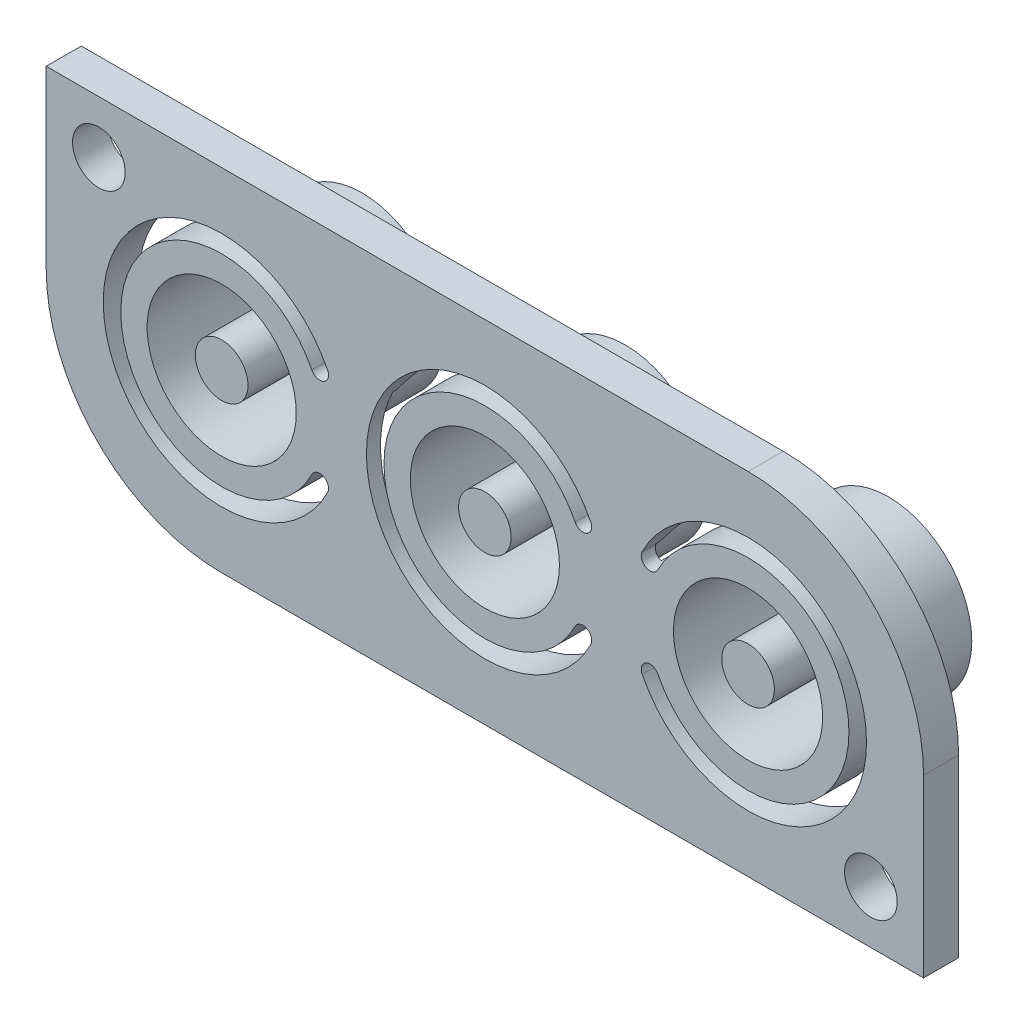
ISO-10303-21;
HEADER;
FILE_DESCRIPTION(('STEP AP214'),'2;1');
FILE_NAME('part.step','',(''),(''),'','','');
FILE_SCHEMA(('AUTOMOTIVE_DESIGN { 1 0 10303 214 1 1 1 1 }'));
ENDSEC;
DATA;
#1=APPLICATION_CONTEXT('core data for automotive mechanical design processes');
#2=APPLICATION_PROTOCOL_DEFINITION('international standard','automotive_design',2000,#1);
#3=PRODUCT_CONTEXT('',#1,'mechanical');
#4=PRODUCT('Part','Part','',(#3));
#5=PRODUCT_RELATED_PRODUCT_CATEGORY('part','',(#4));
#6=PRODUCT_DEFINITION_FORMATION('','',#4);
#7=PRODUCT_DEFINITION_CONTEXT('part definition',#1,'design');
#8=PRODUCT_DEFINITION('design','',#6,#7);
#9=PRODUCT_DEFINITION_SHAPE('','',#8);
#10=(LENGTH_UNIT() NAMED_UNIT(*) SI_UNIT(.MILLI.,.METRE.));
#11=(NAMED_UNIT(*) PLANE_ANGLE_UNIT() SI_UNIT($,.RADIAN.));
#12=(NAMED_UNIT(*) SI_UNIT($,.STERADIAN.) SOLID_ANGLE_UNIT());
#13=UNCERTAINTY_MEASURE_WITH_UNIT(LENGTH_MEASURE(1.E-05),#10,'distance_accuracy_value','');
#14=(GEOMETRIC_REPRESENTATION_CONTEXT(3) GLOBAL_UNCERTAINTY_ASSIGNED_CONTEXT((#13)) GLOBAL_UNIT_ASSIGNED_CONTEXT((#10,
#11,#12)) REPRESENTATION_CONTEXT('',''));
#15=CARTESIAN_POINT('',(0.,0.,0.));
#16=DIRECTION('',(0.,0.,1.));
#17=DIRECTION('',(1.,0.,0.));
#18=AXIS2_PLACEMENT_3D('',#15,#16,#17);
#19=CARTESIAN_POINT('',(77.5,27.5,-6.));
#20=DIRECTION('',(0.,0.,-1.));
#21=DIRECTION('',(-1.,0.,0.));
#22=AXIS2_PLACEMENT_3D('',#19,#20,#21);
#23=PLANE('',#22);
#24=DIRECTION('',(0.708428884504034,0.705782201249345,0.));
#25=VECTOR('',#24,1.);
#26=CARTESIAN_POINT('',(78.6058921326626,25.6349679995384,-6.));
#27=LINE('',#26,#25);
#28=CARTESIAN_POINT('',(78.6058921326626,25.6349679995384,-6.));
#29=VERTEX_POINT('',#28);
#30=CARTESIAN_POINT('',(80.1941041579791,27.2172464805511,-6.));
#31=VERTEX_POINT('',#30);
#32=EDGE_CURVE('E674',#29,#31,#27,.T.);
#33=ORIENTED_EDGE('',*,*,#32,.T.);
#34=DIRECTION('',(-0.70588973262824,0.708321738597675,0.));
#35=VECTOR('',#34,1.);
#36=CARTESIAN_POINT('',(80.1941041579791,27.2172464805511,-6.));
#37=LINE('',#36,#35);
#38=CARTESIAN_POINT('',(76.7496816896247,30.6735360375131,-6.));
#39=VERTEX_POINT('',#38);
#40=EDGE_CURVE('E679',#31,#39,#37,.T.);
#41=ORIENTED_EDGE('',*,*,#40,.T.);
#42=DIRECTION('',(-0.708356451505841,-0.705854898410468,0.));
#43=VECTOR('',#42,1.);
#44=CARTESIAN_POINT('',(76.7496816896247,30.6735360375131,-6.));
#45=LINE('',#44,#43);
#46=CARTESIAN_POINT('',(75.0694997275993,28.9992876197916,-6.));
#47=VERTEX_POINT('',#46);
#48=EDGE_CURVE('E682',#39,#47,#45,.T.);
#49=ORIENTED_EDGE('',*,*,#48,.T.);
#50=CARTESIAN_POINT('',(75.0694997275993,28.9992876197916,-6.));
#51=CARTESIAN_POINT('',(75.0314069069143,28.9598698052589,-6.));
#52=CARTESIAN_POINT('',(74.9571988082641,28.8830805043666,-6.));
#53=CARTESIAN_POINT('',(74.8572584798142,28.7630130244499,-6.));
#54=CARTESIAN_POINT('',(74.7694813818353,28.6431212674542,-6.));
#55=CARTESIAN_POINT('',(74.6947944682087,28.5224040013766,-6.));
#56=CARTESIAN_POINT('',(74.6340410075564,28.4006078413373,-6.));
#57=CARTESIAN_POINT('',(74.5877193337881,28.278103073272,-6.));
#58=CARTESIAN_POINT('',(74.5520064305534,28.1559925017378,-6.));
#59=CARTESIAN_POINT('',(74.5314578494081,28.0332062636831,-6.));
#60=CARTESIAN_POINT('',(74.5240032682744,27.9111190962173,-6.));
#61=CARTESIAN_POINT('',(74.5320267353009,27.7908674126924,-6.));
#62=CARTESIAN_POINT('',(74.5546247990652,27.6726729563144,-6.));
#63=CARTESIAN_POINT('',(74.5945771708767,27.5574151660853,-6.));
#64=CARTESIAN_POINT('',(74.646430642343,27.4428854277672,-6.));
#65=CARTESIAN_POINT('',(74.7159184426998,27.332359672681,-6.));
#66=CARTESIAN_POINT('',(74.7985299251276,27.2229910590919,-6.));
#67=CARTESIAN_POINT('',(74.8630805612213,27.1553080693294,-6.));
#68=CARTESIAN_POINT('',(74.8964380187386,27.120331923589,-6.));
#69=B_SPLINE_CURVE_WITH_KNOTS('',3,(#50,#51,#52,#53,#54,#55,#56,#57,#58,#59,#60,#61,#62,#63,#64,
#65,#66,#67,#68),.UNSPECIFIED.,.F.,.F.,(4,1,1,1,1,1,1,1,1,1,1,1,1,1,1,1,4),(0.,
0.0766788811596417,0.149377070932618,0.218386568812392,0.284441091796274,0.34776766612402,
0.408501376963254,0.467486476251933,0.525495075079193,0.582319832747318,0.638252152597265,
0.693703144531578,0.750150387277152,0.808555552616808,0.869231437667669,0.932423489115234,1.),.UNSPECIFIED.);
#70=CARTESIAN_POINT('',(74.8964380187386,27.120331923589,-6.));
#71=VERTEX_POINT('',#70);
#72=EDGE_CURVE('E684',#47,#71,#69,.T.);
#73=ORIENTED_EDGE('',*,*,#72,.T.);
#74=CARTESIAN_POINT('',(74.8964380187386,27.120331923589,-6.));
#75=CARTESIAN_POINT('',(74.9398520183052,27.0794633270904,-6.));
#76=CARTESIAN_POINT('',(75.0237971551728,27.0004399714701,-6.));
#77=CARTESIAN_POINT('',(75.164643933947,26.9062262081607,-6.));
#78=CARTESIAN_POINT('',(75.3108085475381,26.8368203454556,-6.));
#79=CARTESIAN_POINT('',(75.4636127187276,26.7936679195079,-6.));
#80=CARTESIAN_POINT('',(75.6218957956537,26.7759031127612,-6.));
#81=CARTESIAN_POINT('',(75.7856276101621,26.7832494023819,-6.));
#82=CARTESIAN_POINT('',(75.9550832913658,26.8166043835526,-6.));
#83=CARTESIAN_POINT('',(76.0661312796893,26.8564188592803,-6.));
#84=CARTESIAN_POINT('',(76.123692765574,26.8770566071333,-6.));
#85=B_SPLINE_CURVE_WITH_KNOTS('',3,(#74,#75,#76,#77,#78,#79,#80,#81,#82,#83,#84),.UNSPECIFIED.,
.F.,.F.,(4,1,1,1,1,1,1,1,4),(0.,0.133767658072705,0.258652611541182,0.378915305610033,
0.495902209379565,0.613671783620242,0.73523857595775,0.862761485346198,1.),.UNSPECIFIED.);
#86=CARTESIAN_POINT('',(76.123692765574,26.8770566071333,-6.));
#87=VERTEX_POINT('',#86);
#88=EDGE_CURVE('E688',#71,#87,#85,.T.);
#89=ORIENTED_EDGE('',*,*,#88,.T.);
#90=DIRECTION('',(0.707106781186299,-0.707106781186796,0.));
#91=VECTOR('',#90,1.);
#92=CARTESIAN_POINT('',(76.123692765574,26.8770566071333,-6.));
#93=LINE('',#92,#91);
#94=CARTESIAN_POINT('',(76.1335820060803,26.867167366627,-6.));
#95=VERTEX_POINT('',#94);
#96=EDGE_CURVE('E695',#87,#95,#93,.T.);
#97=ORIENTED_EDGE('',*,*,#96,.T.);
#98=CARTESIAN_POINT('',(76.1335820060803,26.867167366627,-6.));
#99=CARTESIAN_POINT('',(76.1136962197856,26.83479024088,-6.));
#100=CARTESIAN_POINT('',(76.0746731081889,26.7712545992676,-6.));
#101=CARTESIAN_POINT('',(76.0247128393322,26.6734538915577,-6.));
#102=CARTESIAN_POINT('',(75.9864605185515,26.5747682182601,-6.));
#103=CARTESIAN_POINT('',(75.9559221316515,26.4771922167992,-6.));
#104=CARTESIAN_POINT('',(75.9375611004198,26.3792500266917,-6.));
#105=CARTESIAN_POINT('',(75.9271333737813,26.2823179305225,-6.));
#106=CARTESIAN_POINT('',(75.9273828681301,26.1852350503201,-6.));
#107=CARTESIAN_POINT('',(75.9367780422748,26.0883090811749,-6.));
#108=CARTESIAN_POINT('',(75.958573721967,25.9919190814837,-6.));
#109=CARTESIAN_POINT('',(75.9877530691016,25.8956440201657,-6.));
#110=CARTESIAN_POINT('',(76.0282576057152,25.8004811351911,-6.));
#111=CARTESIAN_POINT('',(76.0765546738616,25.7047394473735,-6.));
#112=CARTESIAN_POINT('',(76.1365223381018,25.6099455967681,-6.));
#113=CARTESIAN_POINT('',(76.205809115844,25.5153481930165,-6.));
#114=CARTESIAN_POINT('',(76.2842325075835,25.4203827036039,-6.));
#115=CARTESIAN_POINT('',(76.3427847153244,25.3602964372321,-6.));
#116=CARTESIAN_POINT('',(76.3729016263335,25.3293904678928,-6.));
#117=B_SPLINE_CURVE_WITH_KNOTS('',3,(#98,#99,#100,#101,#102,#103,#104,#105,#106,#107,#108,#109,
#110,#111,#112,#113,#114,#115,#116),.UNSPECIFIED.,.F.,.F.,(4,1,1,1,1,1,1,1,1,1,1,1,1,1,1,1,4),
(0.,0.0666614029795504,0.130813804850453,0.192360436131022,0.252195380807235,0.309935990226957,
0.366915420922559,0.423022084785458,0.480001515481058,0.537407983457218,0.59613676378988,
0.656292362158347,0.718635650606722,0.784117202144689,0.852839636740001,0.924306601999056,1.),.UNSPECIFIED.);
#118=CARTESIAN_POINT('',(76.3729016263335,25.3293904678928,-6.));
#119=VERTEX_POINT('',#118);
#120=EDGE_CURVE('E700',#95,#119,#117,.T.);
#121=ORIENTED_EDGE('',*,*,#120,.T.);
#122=CARTESIAN_POINT('',(76.3729016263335,25.3293904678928,-6.));
#123=CARTESIAN_POINT('',(76.4084618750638,25.2952859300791,-6.));
#124=CARTESIAN_POINT('',(76.4782167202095,25.2283866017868,-6.));
#125=CARTESIAN_POINT('',(76.5926487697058,25.1437957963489,-6.));
#126=CARTESIAN_POINT('',(76.709852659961,25.0725002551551,-6.));
#127=CARTESIAN_POINT('',(76.8312914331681,25.0167032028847,-6.));
#128=CARTESIAN_POINT('',(76.9564278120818,24.9759286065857,-6.));
#129=CARTESIAN_POINT('',(77.0854823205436,24.9500410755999,-6.));
#130=CARTESIAN_POINT('',(77.218301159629,24.93862026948,-6.));
#131=CARTESIAN_POINT('',(77.307764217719,24.9433170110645,-6.));
#132=CARTESIAN_POINT('',(77.3529253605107,24.9456879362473,-6.));
#133=B_SPLINE_CURVE_WITH_KNOTS('',3,(#122,#123,#124,#125,#126,#127,#128,#129,#130,#131,#132),
.UNSPECIFIED.,.F.,.F.,(4,1,1,1,1,1,1,1,4),(0.,0.135698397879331,0.266185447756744,
0.39132338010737,0.513303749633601,0.633706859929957,0.753284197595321,0.875457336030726,1.),.UNSPECIFIED.);
#134=CARTESIAN_POINT('',(77.3529253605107,24.9456879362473,-6.));
#135=VERTEX_POINT('',#134);
#136=EDGE_CURVE('E704',#119,#135,#133,.T.);
#137=ORIENTED_EDGE('',*,*,#136,.T.);
#138=CARTESIAN_POINT('',(77.3529253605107,24.9456879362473,-6.));
#139=CARTESIAN_POINT('',(77.4045745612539,24.9516704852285,-6.));
#140=CARTESIAN_POINT('',(77.5091037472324,24.9637781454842,-6.));
#141=CARTESIAN_POINT('',(77.6645096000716,25.0060915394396,-6.));
#142=CARTESIAN_POINT('',(77.8202572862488,25.0659479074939,-6.));
#143=CARTESIAN_POINT('',(77.9769310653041,25.1438137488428,-6.));
#144=CARTESIAN_POINT('',(78.1347816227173,25.23927965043,-6.));
#145=CARTESIAN_POINT('',(78.2926531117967,25.3536241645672,-6.));
#146=CARTESIAN_POINT('',(78.4518144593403,25.4855499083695,-6.));
#147=CARTESIAN_POINT('',(78.5534790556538,25.5841399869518,-6.));
#148=CARTESIAN_POINT('',(78.6058921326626,25.6349679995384,-6.));
#149=B_SPLINE_CURVE_WITH_KNOTS('',3,(#138,#139,#140,#141,#142,#143,#144,#145,#146,#147,#148),
.UNSPECIFIED.,.F.,.F.,(4,1,1,1,1,1,1,1,4),(0.,0.106782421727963,0.216109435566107,
0.330029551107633,0.449460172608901,0.575349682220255,0.708902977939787,0.849925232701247,1.),.UNSPECIFIED.);
#150=EDGE_CURVE('E711',#135,#29,#149,.T.);
#151=ORIENTED_EDGE('',*,*,#150,.T.);
#152=EDGE_LOOP('',(#33,#41,#49,#73,#89,#97,#121,#137,#151));
#153=FACE_BOUND('',#152,.T.);
#154=CARTESIAN_POINT('',(77.5,27.5,-6.));
#155=DIRECTION('',(0.,0.,-1.));
#156=DIRECTION('',(-1.,0.,0.));
#157=AXIS2_PLACEMENT_3D('',#154,#155,#156);
#158=CIRCLE('',#157,4.75);
#159=CARTESIAN_POINT('',(72.75,27.5,-6.));
#160=VERTEX_POINT('',#159);
#161=EDGE_CURVE('E1054',#160,#160,#158,.T.);
#162=ORIENTED_EDGE('',*,*,#161,.T.);
#163=EDGE_LOOP('',(#162));
#164=FACE_BOUND('',#163,.T.);
#165=ADVANCED_FACE('F33',(#153,#164),#23,.T.);
#166=CARTESIAN_POINT('',(62.5,27.5,-6.));
#167=DIRECTION('',(0.,0.,-1.));
#168=DIRECTION('',(-1.,0.,0.));
#169=AXIS2_PLACEMENT_3D('',#166,#167,#168);
#170=PLANE('',#169);
#171=CARTESIAN_POINT('',(62.5,27.5,-6.));
#172=DIRECTION('',(0.,0.,-1.));
#173=DIRECTION('',(-1.,0.,0.));
#174=AXIS2_PLACEMENT_3D('',#171,#172,#173);
#175=CIRCLE('',#174,4.75);
#176=CARTESIAN_POINT('',(57.75,27.5,-6.));
#177=VERTEX_POINT('',#176);
#178=EDGE_CURVE('E992',#177,#177,#175,.T.);
#179=ORIENTED_EDGE('',*,*,#178,.T.);
#180=EDGE_LOOP('',(#179));
#181=FACE_BOUND('',#180,.T.);
#182=DIRECTION('',(0.902085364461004,-0.431557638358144,0.));
#183=VECTOR('',#182,1.);
#184=CARTESIAN_POINT('',(63.8684162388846,27.5871040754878,-6.));
#185=LINE('',#184,#183);
#186=CARTESIAN_POINT('',(63.8684162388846,27.5871040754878,-6.));
#187=VERTEX_POINT('',#186);
#188=CARTESIAN_POINT('',(65.1045713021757,26.9957274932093,-6.));
#189=VERTEX_POINT('',#188);
#190=EDGE_CURVE('E783',#187,#189,#185,.T.);
#191=ORIENTED_EDGE('',*,*,#190,.T.);
#192=DIRECTION('',(0.708228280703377,0.705983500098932,0.));
#193=VECTOR('',#192,1.);
#194=CARTESIAN_POINT('',(65.1045713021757,26.9957274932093,-6.));
#195=LINE('',#194,#193);
#196=CARTESIAN_POINT('',(65.7285823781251,27.6177607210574,-6.));
#197=VERTEX_POINT('',#196);
#198=EDGE_CURVE('E778',#189,#197,#195,.T.);
#199=ORIENTED_EDGE('',*,*,#198,.T.);
#200=DIRECTION('',(-0.912825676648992,0.408349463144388,0.));
#201=VECTOR('',#200,1.);
#202=CARTESIAN_POINT('',(65.7285823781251,27.6177607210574,-6.));
#203=LINE('',#202,#201);
#204=CARTESIAN_POINT('',(60.9580127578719,29.7518588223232,-6.));
#205=VERTEX_POINT('',#204);
#206=EDGE_CURVE('E807',#197,#205,#203,.T.);
#207=ORIENTED_EDGE('',*,*,#206,.T.);
#208=DIRECTION('',(-0.708737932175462,-0.705471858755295,0.));
#209=VECTOR('',#208,1.);
#210=CARTESIAN_POINT('',(60.9580127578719,29.7518588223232,-6.));
#211=LINE('',#210,#209);
#212=CARTESIAN_POINT('',(60.3142232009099,29.1110360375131,-6.));
#213=VERTEX_POINT('',#212);
#214=EDGE_CURVE('E810',#205,#213,#211,.T.);
#215=ORIENTED_EDGE('',*,*,#214,.T.);
#216=DIRECTION('',(0.4041196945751,-0.914706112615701,0.));
#217=VECTOR('',#216,1.);
#218=CARTESIAN_POINT('',(60.3142232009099,29.1110360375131,-6.));
#219=LINE('',#218,#217);
#220=CARTESIAN_POINT('',(62.4275538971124,24.3276104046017,-6.));
#221=VERTEX_POINT('',#220);
#222=EDGE_CURVE('E813',#213,#221,#219,.T.);
#223=ORIENTED_EDGE('',*,*,#222,.T.);
#224=DIRECTION('',(0.708185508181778,0.70602640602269,0.));
#225=VECTOR('',#224,1.);
#226=CARTESIAN_POINT('',(62.4275538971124,24.3276104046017,-6.));
#227=LINE('',#226,#225);
#228=CARTESIAN_POINT('',(63.0762880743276,24.9743667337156,-6.));
#229=VERTEX_POINT('',#228);
#230=EDGE_CURVE('E816',#221,#229,#227,.T.);
#231=ORIENTED_EDGE('',*,*,#230,.T.);
#232=DIRECTION('',(-0.428644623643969,0.903473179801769,0.));
#233=VECTOR('',#232,1.);
#234=CARTESIAN_POINT('',(63.0762880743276,24.9743667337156,-6.));
#235=LINE('',#234,#233);
#236=CARTESIAN_POINT('',(62.4888671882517,26.212499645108,-6.));
#237=VERTEX_POINT('',#236);
#238=EDGE_CURVE('E819',#229,#237,#235,.T.);
#239=ORIENTED_EDGE('',*,*,#238,.T.);
#240=DIRECTION('',(0.708375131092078,0.705836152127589,0.));
#241=VECTOR('',#240,1.);
#242=CARTESIAN_POINT('',(62.4888671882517,26.212499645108,-6.));
#243=LINE('',#242,#241);
#244=EDGE_CURVE('E822',#237,#187,#243,.T.);
#245=ORIENTED_EDGE('',*,*,#244,.T.);
#246=EDGE_LOOP('',(#191,#199,#207,#215,#223,#231,#239,#245));
#247=FACE_BOUND('',#246,.T.);
#248=ADVANCED_FACE('F1260',(#181,#247),#170,.T.);
#249=CARTESIAN_POINT('',(0.,0.,0.));
#250=DIRECTION('',(0.,0.,1.));
#251=DIRECTION('',(1.,0.,0.));
#252=AXIS2_PLACEMENT_3D('',#249,#250,#251);
#253=PLANE('',#252);
#254=CARTESIAN_POINT('',(62.5,27.5,0.));
#255=DIRECTION('',(0.,0.,1.));
#256=DIRECTION('',(1.,0.,0.));
#257=AXIS2_PLACEMENT_3D('',#254,#255,#256);
#258=CIRCLE('',#257,4.75);
#259=CARTESIAN_POINT('',(67.25,27.5,0.));
#260=VERTEX_POINT('',#259);
#261=EDGE_CURVE('E1092',#260,#260,#258,.F.);
#262=ORIENTED_EDGE('',*,*,#261,.F.);
#263=EDGE_LOOP('',(#262));
#264=FACE_BOUND('',#263,.T.);
#265=CARTESIAN_POINT('',(62.5,27.5,0.));
#266=DIRECTION('',(0.,0.,1.));
#267=DIRECTION('',(-1.,0.,0.));
#268=AXIS2_PLACEMENT_3D('',#265,#266,#267);
#269=CIRCLE('',#268,5.75000000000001);
#270=CARTESIAN_POINT('',(56.75,27.5,0.));
#271=VERTEX_POINT('',#270);
#272=EDGE_CURVE('E993',#271,#271,#269,.T.);
#273=ORIENTED_EDGE('',*,*,#272,.F.);
#274=EDGE_LOOP('',(#273));
#275=FACE_BOUND('',#274,.T.);
#276=ADVANCED_FACE('F1266',(#264,#275),#253,.F.);
#277=CARTESIAN_POINT('',(77.5,27.5,0.));
#278=DIRECTION('',(0.,0.,1.));
#279=DIRECTION('',(1.,0.,0.));
#280=AXIS2_PLACEMENT_3D('',#277,#278,#279);
#281=CIRCLE('',#280,4.75);
#282=CARTESIAN_POINT('',(82.25,27.5,0.));
#283=VERTEX_POINT('',#282);
#284=EDGE_CURVE('E1089',#283,#283,#281,.F.);
#285=ORIENTED_EDGE('',*,*,#284,.F.);
#286=EDGE_LOOP('',(#285));
#287=FACE_BOUND('',#286,.T.);
#288=CARTESIAN_POINT('',(77.5,27.5,0.));
#289=DIRECTION('',(0.,0.,1.));
#290=DIRECTION('',(-1.,0.,0.));
#291=AXIS2_PLACEMENT_3D('',#288,#289,#290);
#292=CIRCLE('',#291,5.75);
#293=CARTESIAN_POINT('',(71.75,27.5,0.));
#294=VERTEX_POINT('',#293);
#295=EDGE_CURVE('E1023',#294,#294,#292,.T.);
#296=ORIENTED_EDGE('',*,*,#295,.F.);
#297=EDGE_LOOP('',(#296));
#298=FACE_BOUND('',#297,.T.);
#299=ADVANCED_FACE('F1254',(#287,#298),#253,.F.);
#300=CARTESIAN_POINT('',(92.5,27.5,0.));
#301=DIRECTION('',(0.,0.,1.));
#302=DIRECTION('',(1.,0.,0.));
#303=AXIS2_PLACEMENT_3D('',#300,#301,#302);
#304=CIRCLE('',#303,4.75);
#305=CARTESIAN_POINT('',(97.25,27.5,0.));
#306=VERTEX_POINT('',#305);
#307=EDGE_CURVE('E1086',#306,#306,#304,.F.);
#308=ORIENTED_EDGE('',*,*,#307,.F.);
#309=EDGE_LOOP('',(#308));
#310=FACE_BOUND('',#309,.T.);
#311=CARTESIAN_POINT('',(92.5,27.5,0.));
#312=DIRECTION('',(0.,0.,-1.));
#313=DIRECTION('',(-1.,0.,0.));
#314=AXIS2_PLACEMENT_3D('',#311,#312,#313);
#315=CIRCLE('',#314,6.2);
#316=CARTESIAN_POINT('',(86.7522661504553,25.1754450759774,0.));
#317=VERTEX_POINT('',#316);
#318=CARTESIAN_POINT('',(86.7522661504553,29.8245549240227,0.));
#319=VERTEX_POINT('',#318);
#320=EDGE_CURVE('E830',#317,#319,#315,.T.);
#321=ORIENTED_EDGE('',*,*,#320,.T.);
#322=CARTESIAN_POINT('',(86.9115426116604,30.2985074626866,0.));
#323=DIRECTION('',(0.,0.,-1.));
#324=DIRECTION('',(-1.,0.,0.));
#325=AXIS2_PLACEMENT_3D('',#322,#323,#324);
#326=CIRCLE('',#325,0.499999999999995);
#327=CARTESIAN_POINT('',(87.3586192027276,30.0746268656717,0.));
#328=VERTEX_POINT('',#327);
#329=EDGE_CURVE('E957',#328,#319,#326,.T.);
#330=ORIENTED_EDGE('',*,*,#329,.F.);
#331=CARTESIAN_POINT('',(92.5,27.5,0.));
#332=DIRECTION('',(0.,0.,1.));
#333=DIRECTION('',(-1.,0.,0.));
#334=AXIS2_PLACEMENT_3D('',#331,#332,#333);
#335=CIRCLE('',#334,5.75000000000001);
#336=CARTESIAN_POINT('',(87.3586192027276,24.9253731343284,0.));
#337=VERTEX_POINT('',#336);
#338=EDGE_CURVE('E961',#337,#328,#335,.T.);
#339=ORIENTED_EDGE('',*,*,#338,.F.);
#340=CARTESIAN_POINT('',(86.9115426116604,24.7014925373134,0.));
#341=DIRECTION('',(0.,0.,-1.));
#342=DIRECTION('',(-1.,0.,0.));
#343=AXIS2_PLACEMENT_3D('',#340,#341,#342);
#344=CIRCLE('',#343,0.499999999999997);
#345=EDGE_CURVE('E964',#317,#337,#344,.T.);
#346=ORIENTED_EDGE('',*,*,#345,.F.);
#347=EDGE_LOOP('',(#321,#330,#339,#346));
#348=FACE_BOUND('',#347,.T.);
#349=ADVANCED_FACE('F1219',(#310,#348),#253,.F.);
#350=CARTESIAN_POINT('',(83.0884573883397,30.2985074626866,20.629975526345));
#351=DIRECTION('',(0.,0.,-1.));
#352=DIRECTION('',(-1.,0.,0.));
#353=AXIS2_PLACEMENT_3D('',#350,#351,#352);
#354=CYLINDRICAL_SURFACE('',#353,0.500000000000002);
#355=CARTESIAN_POINT('',(83.0884573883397,30.2985074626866,1.2));
#356=DIRECTION('',(0.,0.,-1.));
#357=DIRECTION('',(-1.,0.,0.));
#358=AXIS2_PLACEMENT_3D('',#355,#356,#357);
#359=CIRCLE('',#358,0.500000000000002);
#360=CARTESIAN_POINT('',(82.6413807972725,30.0746268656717,1.2));
#361=VERTEX_POINT('',#360);
#362=CARTESIAN_POINT('',(83.5355339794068,30.5223880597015,1.2));
#363=VERTEX_POINT('',#362);
#364=EDGE_CURVE('E904',#361,#363,#359,.F.);
#365=ORIENTED_EDGE('',*,*,#364,.F.);
#366=DIRECTION('',(0.,0.,-1.));
#367=VECTOR('',#366,1.);
#368=CARTESIAN_POINT('',(82.6413807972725,30.0746268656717,20.629975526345));
#369=LINE('',#368,#367);
#370=CARTESIAN_POINT('',(82.6413807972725,30.0746268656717,2.));
#371=VERTEX_POINT('',#370);
#372=EDGE_CURVE('E1032',#371,#361,#369,.T.);
#373=ORIENTED_EDGE('',*,*,#372,.F.);
#374=CARTESIAN_POINT('',(83.0884573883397,30.2985074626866,2.));
#375=DIRECTION('',(0.,0.,1.));
#376=DIRECTION('',(1.,0.,0.));
#377=AXIS2_PLACEMENT_3D('',#374,#375,#376);
#378=CIRCLE('',#377,0.500000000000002);
#379=CARTESIAN_POINT('',(83.5355339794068,30.5223880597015,2.));
#380=VERTEX_POINT('',#379);
#381=EDGE_CURVE('E1026',#380,#371,#378,.F.);
#382=ORIENTED_EDGE('',*,*,#381,.F.);
#383=DIRECTION('',(0.,0.,-1.));
#384=VECTOR('',#383,1.);
#385=CARTESIAN_POINT('',(83.5355339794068,30.5223880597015,20.629975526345));
#386=LINE('',#385,#384);
#387=EDGE_CURVE('E1000',#380,#363,#386,.T.);
#388=ORIENTED_EDGE('',*,*,#387,.T.);
#389=EDGE_LOOP('',(#365,#373,#382,#388));
#390=FACE_BOUND('',#389,.T.);
#391=ADVANCED_FACE('F1246',(#390),#354,.F.);
#392=CARTESIAN_POINT('',(83.0884573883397,24.7014925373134,20.629975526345));
#393=DIRECTION('',(0.,0.,-1.));
#394=DIRECTION('',(-1.,0.,0.));
#395=AXIS2_PLACEMENT_3D('',#392,#393,#394);
#396=CYLINDRICAL_SURFACE('',#395,0.500000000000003);
#397=CARTESIAN_POINT('',(83.0884573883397,24.7014925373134,1.2));
#398=DIRECTION('',(0.,0.,-1.));
#399=DIRECTION('',(-1.,0.,0.));
#400=AXIS2_PLACEMENT_3D('',#397,#398,#399);
#401=CIRCLE('',#400,0.500000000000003);
#402=CARTESIAN_POINT('',(83.5355339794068,24.4776119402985,1.2));
#403=VERTEX_POINT('',#402);
#404=CARTESIAN_POINT('',(82.6413807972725,24.9253731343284,1.2));
#405=VERTEX_POINT('',#404);
#406=EDGE_CURVE('E902',#403,#405,#401,.F.);
#407=ORIENTED_EDGE('',*,*,#406,.F.);
#408=DIRECTION('',(0.,0.,-1.));
#409=VECTOR('',#408,1.);
#410=CARTESIAN_POINT('',(83.5355339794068,24.4776119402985,20.629975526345));
#411=LINE('',#410,#409);
#412=CARTESIAN_POINT('',(83.5355339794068,24.4776119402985,2.));
#413=VERTEX_POINT('',#412);
#414=EDGE_CURVE('E1036',#413,#403,#411,.T.);
#415=ORIENTED_EDGE('',*,*,#414,.F.);
#416=CARTESIAN_POINT('',(83.0884573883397,24.7014925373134,2.));
#417=DIRECTION('',(0.,0.,1.));
#418=DIRECTION('',(1.,0.,0.));
#419=AXIS2_PLACEMENT_3D('',#416,#417,#418);
#420=CIRCLE('',#419,0.500000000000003);
#421=CARTESIAN_POINT('',(82.6413807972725,24.9253731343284,2.));
#422=VERTEX_POINT('',#421);
#423=EDGE_CURVE('E1037',#422,#413,#420,.F.);
#424=ORIENTED_EDGE('',*,*,#423,.F.);
#425=DIRECTION('',(0.,0.,-1.));
#426=VECTOR('',#425,1.);
#427=CARTESIAN_POINT('',(82.6413807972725,24.9253731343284,20.629975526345));
#428=LINE('',#427,#426);
#429=EDGE_CURVE('E1040',#422,#405,#428,.T.);
#430=ORIENTED_EDGE('',*,*,#429,.T.);
#431=EDGE_LOOP('',(#407,#415,#424,#430));
#432=FACE_BOUND('',#431,.T.);
#433=ADVANCED_FACE('F1238',(#432),#396,.F.);
#434=CARTESIAN_POINT('',(68.0884573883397,30.2985074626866,20.629975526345));
#435=DIRECTION('',(0.,0.,-1.));
#436=DIRECTION('',(-1.,0.,0.));
#437=AXIS2_PLACEMENT_3D('',#434,#435,#436);
#438=CYLINDRICAL_SURFACE('',#437,0.499999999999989);
#439=CARTESIAN_POINT('',(68.0884573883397,30.2985074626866,1.2));
#440=DIRECTION('',(0.,0.,-1.));
#441=DIRECTION('',(-1.,0.,0.));
#442=AXIS2_PLACEMENT_3D('',#439,#440,#441);
#443=CIRCLE('',#442,0.499999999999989);
#444=CARTESIAN_POINT('',(67.6413807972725,30.0746268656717,1.2));
#445=VERTEX_POINT('',#444);
#446=CARTESIAN_POINT('',(68.5355339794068,30.5223880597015,1.2));
#447=VERTEX_POINT('',#446);
#448=EDGE_CURVE('E897',#445,#447,#443,.F.);
#449=ORIENTED_EDGE('',*,*,#448,.F.);
#450=DIRECTION('',(0.,0.,-1.));
#451=VECTOR('',#450,1.);
#452=CARTESIAN_POINT('',(67.6413807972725,30.0746268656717,20.629975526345));
#453=LINE('',#452,#451);
#454=CARTESIAN_POINT('',(67.6413807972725,30.0746268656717,2.));
#455=VERTEX_POINT('',#454);
#456=EDGE_CURVE('E1003',#455,#445,#453,.T.);
#457=ORIENTED_EDGE('',*,*,#456,.F.);
#458=CARTESIAN_POINT('',(68.0884573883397,30.2985074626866,2.));
#459=DIRECTION('',(0.,0.,1.));
#460=DIRECTION('',(1.,0.,0.));
#461=AXIS2_PLACEMENT_3D('',#458,#459,#460);
#462=CIRCLE('',#461,0.499999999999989);
#463=CARTESIAN_POINT('',(68.5355339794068,30.5223880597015,2.));
#464=VERTEX_POINT('',#463);
#465=EDGE_CURVE('E996',#464,#455,#462,.F.);
#466=ORIENTED_EDGE('',*,*,#465,.F.);
#467=DIRECTION('',(0.,0.,-1.));
#468=VECTOR('',#467,1.);
#469=CARTESIAN_POINT('',(68.5355339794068,30.5223880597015,20.629975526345));
#470=LINE('',#469,#468);
#471=EDGE_CURVE('E969',#464,#447,#470,.T.);
#472=ORIENTED_EDGE('',*,*,#471,.T.);
#473=EDGE_LOOP('',(#449,#457,#466,#472));
#474=FACE_BOUND('',#473,.T.);
#475=ADVANCED_FACE('F1169',(#474),#438,.F.);
#476=CARTESIAN_POINT('',(68.0884573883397,24.7014925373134,20.629975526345));
#477=DIRECTION('',(0.,0.,-1.));
#478=DIRECTION('',(-1.,0.,0.));
#479=AXIS2_PLACEMENT_3D('',#476,#477,#478);
#480=CYLINDRICAL_SURFACE('',#479,0.499999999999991);
#481=CARTESIAN_POINT('',(68.0884573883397,24.7014925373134,1.2));
#482=DIRECTION('',(0.,0.,-1.));
#483=DIRECTION('',(-1.,0.,0.));
#484=AXIS2_PLACEMENT_3D('',#481,#482,#483);
#485=CIRCLE('',#484,0.499999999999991);
#486=CARTESIAN_POINT('',(68.5355339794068,24.4776119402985,1.2));
#487=VERTEX_POINT('',#486);
#488=CARTESIAN_POINT('',(67.6413807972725,24.9253731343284,1.2));
#489=VERTEX_POINT('',#488);
#490=EDGE_CURVE('E895',#487,#489,#485,.F.);
#491=ORIENTED_EDGE('',*,*,#490,.F.);
#492=DIRECTION('',(0.,0.,-1.));
#493=VECTOR('',#492,1.);
#494=CARTESIAN_POINT('',(68.5355339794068,24.4776119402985,20.629975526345));
#495=LINE('',#494,#493);
#496=CARTESIAN_POINT('',(68.5355339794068,24.4776119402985,2.));
#497=VERTEX_POINT('',#496);
#498=EDGE_CURVE('E1007',#497,#487,#495,.T.);
#499=ORIENTED_EDGE('',*,*,#498,.F.);
#500=CARTESIAN_POINT('',(68.0884573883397,24.7014925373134,2.));
#501=DIRECTION('',(0.,0.,1.));
#502=DIRECTION('',(1.,0.,0.));
#503=AXIS2_PLACEMENT_3D('',#500,#501,#502);
#504=CIRCLE('',#503,0.499999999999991);
#505=CARTESIAN_POINT('',(67.6413807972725,24.9253731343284,2.));
#506=VERTEX_POINT('',#505);
#507=EDGE_CURVE('E1008',#506,#497,#504,.F.);
#508=ORIENTED_EDGE('',*,*,#507,.F.);
#509=DIRECTION('',(0.,0.,-1.));
#510=VECTOR('',#509,1.);
#511=CARTESIAN_POINT('',(67.6413807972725,24.9253731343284,20.629975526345));
#512=LINE('',#511,#510);
#513=EDGE_CURVE('E1011',#506,#489,#512,.T.);
#514=ORIENTED_EDGE('',*,*,#513,.T.);
#515=EDGE_LOOP('',(#491,#499,#508,#514));
#516=FACE_BOUND('',#515,.T.);
#517=ADVANCED_FACE('F1158',(#516),#480,.F.);
#518=CARTESIAN_POINT('',(86.9115426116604,24.7014925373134,20.629975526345));
#519=DIRECTION('',(0.,0.,-1.));
#520=DIRECTION('',(-1.,0.,0.));
#521=AXIS2_PLACEMENT_3D('',#518,#519,#520);
#522=CYLINDRICAL_SURFACE('',#521,0.499999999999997);
#523=CARTESIAN_POINT('',(86.9115426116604,24.7014925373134,1.2));
#524=DIRECTION('',(0.,0.,-1.));
#525=DIRECTION('',(-1.,0.,0.));
#526=AXIS2_PLACEMENT_3D('',#523,#524,#525);
#527=CIRCLE('',#526,0.499999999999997);
#528=CARTESIAN_POINT('',(86.7522661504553,25.1754450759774,1.2));
#529=VERTEX_POINT('',#528);
#530=CARTESIAN_POINT('',(86.4644660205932,24.4776119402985,1.2));
#531=VERTEX_POINT('',#530);
#532=EDGE_CURVE('E893',#529,#531,#527,.F.);
#533=ORIENTED_EDGE('',*,*,#532,.F.);
#534=DIRECTION('',(0.,0.,-1.));
#535=VECTOR('',#534,1.);
#536=CARTESIAN_POINT('',(86.7522661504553,25.1754450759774,0.6));
#537=LINE('',#536,#535);
#538=EDGE_CURVE('E906',#317,#529,#537,.F.);
#539=ORIENTED_EDGE('',*,*,#538,.F.);
#540=ORIENTED_EDGE('',*,*,#345,.T.);
#541=DIRECTION('',(0.,0.,-1.));
#542=VECTOR('',#541,1.);
#543=CARTESIAN_POINT('',(87.3586192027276,24.9253731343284,20.629975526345));
#544=LINE('',#543,#542);
#545=CARTESIAN_POINT('',(87.3586192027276,24.9253731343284,2.));
#546=VERTEX_POINT('',#545);
#547=EDGE_CURVE('E972',#546,#337,#544,.T.);
#548=ORIENTED_EDGE('',*,*,#547,.F.);
#549=CARTESIAN_POINT('',(86.9115426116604,24.7014925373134,2.));
#550=DIRECTION('',(0.,0.,1.));
#551=DIRECTION('',(1.,0.,0.));
#552=AXIS2_PLACEMENT_3D('',#549,#550,#551);
#553=CIRCLE('',#552,0.499999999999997);
#554=CARTESIAN_POINT('',(86.4644660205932,24.4776119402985,2.));
#555=VERTEX_POINT('',#554);
#556=EDGE_CURVE('E960',#555,#546,#553,.F.);
#557=ORIENTED_EDGE('',*,*,#556,.F.);
#558=DIRECTION('',(0.,0.,-1.));
#559=VECTOR('',#558,1.);
#560=CARTESIAN_POINT('',(86.4644660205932,24.4776119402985,20.629975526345));
#561=LINE('',#560,#559);
#562=EDGE_CURVE('E976',#555,#531,#561,.T.);
#563=ORIENTED_EDGE('',*,*,#562,.T.);
#564=EDGE_LOOP('',(#533,#539,#540,#548,#557,#563));
#565=FACE_BOUND('',#564,.T.);
#566=ADVANCED_FACE('F1225',(#565),#522,.F.);
#567=CARTESIAN_POINT('',(86.9115426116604,30.2985074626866,20.629975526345));
#568=DIRECTION('',(0.,0.,-1.));
#569=DIRECTION('',(-1.,0.,0.));
#570=AXIS2_PLACEMENT_3D('',#567,#568,#569);
#571=CYLINDRICAL_SURFACE('',#570,0.499999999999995);
#572=CARTESIAN_POINT('',(86.9115426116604,30.2985074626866,1.2));
#573=DIRECTION('',(0.,0.,-1.));
#574=DIRECTION('',(-1.,0.,0.));
#575=AXIS2_PLACEMENT_3D('',#572,#573,#574);
#576=CIRCLE('',#575,0.499999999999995);
#577=CARTESIAN_POINT('',(86.4644660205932,30.5223880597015,1.2));
#578=VERTEX_POINT('',#577);
#579=CARTESIAN_POINT('',(86.7522661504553,29.8245549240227,1.2));
#580=VERTEX_POINT('',#579);
#581=EDGE_CURVE('E871',#578,#580,#576,.F.);
#582=ORIENTED_EDGE('',*,*,#581,.F.);
#583=DIRECTION('',(0.,0.,-1.));
#584=VECTOR('',#583,1.);
#585=CARTESIAN_POINT('',(86.4644660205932,30.5223880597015,20.629975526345));
#586=LINE('',#585,#584);
#587=CARTESIAN_POINT('',(86.4644660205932,30.5223880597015,2.));
#588=VERTEX_POINT('',#587);
#589=EDGE_CURVE('E977',#588,#578,#586,.T.);
#590=ORIENTED_EDGE('',*,*,#589,.F.);
#591=CARTESIAN_POINT('',(86.9115426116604,30.2985074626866,2.));
#592=DIRECTION('',(0.,0.,1.));
#593=DIRECTION('',(1.,0.,0.));
#594=AXIS2_PLACEMENT_3D('',#591,#592,#593);
#595=CIRCLE('',#594,0.499999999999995);
#596=CARTESIAN_POINT('',(87.3586192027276,30.0746268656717,2.));
#597=VERTEX_POINT('',#596);
#598=EDGE_CURVE('E978',#597,#588,#595,.F.);
#599=ORIENTED_EDGE('',*,*,#598,.F.);
#600=DIRECTION('',(0.,0.,-1.));
#601=VECTOR('',#600,1.);
#602=CARTESIAN_POINT('',(87.3586192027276,30.0746268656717,20.629975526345));
#603=LINE('',#602,#601);
#604=EDGE_CURVE('E981',#597,#328,#603,.T.);
#605=ORIENTED_EDGE('',*,*,#604,.T.);
#606=ORIENTED_EDGE('',*,*,#329,.T.);
#607=DIRECTION('',(0.,0.,-1.));
#608=VECTOR('',#607,1.);
#609=CARTESIAN_POINT('',(86.7522661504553,29.8245549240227,0.6));
#610=LINE('',#609,#608);
#611=EDGE_CURVE('E1113',#580,#319,#610,.T.);
#612=ORIENTED_EDGE('',*,*,#611,.F.);
#613=EDGE_LOOP('',(#582,#590,#599,#605,#606,#612));
#614=FACE_BOUND('',#613,.T.);
#615=ADVANCED_FACE('F1205',(#614),#571,.F.);
#616=CARTESIAN_POINT('',(102.5,37.5,2.));
#617=DIRECTION('',(-1.,0.,0.));
#618=DIRECTION('',(0.,0.,1.));
#619=AXIS2_PLACEMENT_3D('',#616,#617,#618);
#620=PLANE('',#619);
#621=DIRECTION('',(0.,1.,0.));
#622=VECTOR('',#621,1.);
#623=CARTESIAN_POINT('',(102.5,37.5,0.));
#624=LINE('',#623,#622);
#625=CARTESIAN_POINT('',(102.5,17.5,0.));
#626=VERTEX_POINT('',#625);
#627=CARTESIAN_POINT('',(102.5,27.5,0.));
#628=VERTEX_POINT('',#627);
#629=EDGE_CURVE('E1060',#626,#628,#624,.T.);
#630=ORIENTED_EDGE('',*,*,#629,.T.);
#631=DIRECTION('',(0.,0.,-1.));
#632=VECTOR('',#631,1.);
#633=CARTESIAN_POINT('',(102.5,27.5,2.));
#634=LINE('',#633,#632);
#635=CARTESIAN_POINT('',(102.5,27.5,2.));
#636=VERTEX_POINT('',#635);
#637=EDGE_CURVE('E1102',#628,#636,#634,.F.);
#638=ORIENTED_EDGE('',*,*,#637,.T.);
#639=DIRECTION('',(0.,1.,0.));
#640=VECTOR('',#639,1.);
#641=CARTESIAN_POINT('',(102.5,37.5,2.));
#642=LINE('',#641,#640);
#643=CARTESIAN_POINT('',(102.5,17.5,2.));
#644=VERTEX_POINT('',#643);
#645=EDGE_CURVE('E1061',#644,#636,#642,.T.);
#646=ORIENTED_EDGE('',*,*,#645,.F.);
#647=DIRECTION('',(0.,0.,-1.));
#648=VECTOR('',#647,1.);
#649=CARTESIAN_POINT('',(102.5,17.5,2.));
#650=LINE('',#649,#648);
#651=EDGE_CURVE('E1072',#644,#626,#650,.T.);
#652=ORIENTED_EDGE('',*,*,#651,.T.);
#653=EDGE_LOOP('',(#630,#638,#646,#652));
#654=FACE_BOUND('',#653,.T.);
#655=ADVANCED_FACE('F1514',(#654),#620,.F.);
#656=CARTESIAN_POINT('',(52.5,37.5,2.));
#657=DIRECTION('',(0.,-1.,0.));
#658=DIRECTION('',(1.,0.,0.));
#659=AXIS2_PLACEMENT_3D('',#656,#657,#658);
#660=PLANE('',#659);
#661=DIRECTION('',(-1.,0.,0.));
#662=VECTOR('',#661,1.);
#663=CARTESIAN_POINT('',(52.5,37.5,2.));
#664=LINE('',#663,#662);
#665=CARTESIAN_POINT('',(92.5000000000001,37.5,2.));
#666=VERTEX_POINT('',#665);
#667=CARTESIAN_POINT('',(52.5,37.5,2.));
#668=VERTEX_POINT('',#667);
#669=EDGE_CURVE('E1064',#666,#668,#664,.T.);
#670=ORIENTED_EDGE('',*,*,#669,.F.);
#671=DIRECTION('',(0.,0.,-1.));
#672=VECTOR('',#671,1.);
#673=CARTESIAN_POINT('',(92.5000000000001,37.5,2.));
#674=LINE('',#673,#672);
#675=CARTESIAN_POINT('',(92.5000000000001,37.5,0.));
#676=VERTEX_POINT('',#675);
#677=EDGE_CURVE('E1095',#666,#676,#674,.T.);
#678=ORIENTED_EDGE('',*,*,#677,.T.);
#679=DIRECTION('',(-1.,0.,0.));
#680=VECTOR('',#679,1.);
#681=CARTESIAN_POINT('',(52.5,37.5,0.));
#682=LINE('',#681,#680);
#683=CARTESIAN_POINT('',(52.5,37.5,0.));
#684=VERTEX_POINT('',#683);
#685=EDGE_CURVE('E1075',#676,#684,#682,.T.);
#686=ORIENTED_EDGE('',*,*,#685,.T.);
#687=DIRECTION('',(0.,0.,-1.));
#688=VECTOR('',#687,1.);
#689=CARTESIAN_POINT('',(52.5,37.5,2.));
#690=LINE('',#689,#688);
#691=EDGE_CURVE('E1083',#668,#684,#690,.T.);
#692=ORIENTED_EDGE('',*,*,#691,.F.);
#693=EDGE_LOOP('',(#670,#678,#686,#692));
#694=FACE_BOUND('',#693,.T.);
#695=ADVANCED_FACE('F1559',(#694),#660,.F.);
#696=CARTESIAN_POINT('',(52.5,37.5,2.));
#697=DIRECTION('',(1.,0.,0.));
#698=DIRECTION('',(0.,0.,-1.));
#699=AXIS2_PLACEMENT_3D('',#696,#697,#698);
#700=PLANE('',#699);
#701=DIRECTION('',(0.,-1.,0.));
#702=VECTOR('',#701,1.);
#703=CARTESIAN_POINT('',(52.5,37.5,0.));
#704=LINE('',#703,#702);
#705=CARTESIAN_POINT('',(52.5,27.5,0.));
#706=VERTEX_POINT('',#705);
#707=EDGE_CURVE('E1077',#684,#706,#704,.T.);
#708=ORIENTED_EDGE('',*,*,#707,.T.);
#709=DIRECTION('',(0.,0.,-1.));
#710=VECTOR('',#709,1.);
#711=CARTESIAN_POINT('',(52.5,27.5,2.));
#712=LINE('',#711,#710);
#713=CARTESIAN_POINT('',(52.5,27.5,2.));
#714=VERTEX_POINT('',#713);
#715=EDGE_CURVE('E1111',#706,#714,#712,.F.);
#716=ORIENTED_EDGE('',*,*,#715,.T.);
#717=DIRECTION('',(0.,-1.,0.));
#718=VECTOR('',#717,1.);
#719=CARTESIAN_POINT('',(52.5,37.5,2.));
#720=LINE('',#719,#718);
#721=EDGE_CURVE('E1067',#668,#714,#720,.T.);
#722=ORIENTED_EDGE('',*,*,#721,.F.);
#723=ORIENTED_EDGE('',*,*,#691,.T.);
#724=EDGE_LOOP('',(#708,#716,#722,#723));
#725=FACE_BOUND('',#724,.T.);
#726=ADVANCED_FACE('F1555',(#725),#700,.F.);
#727=CARTESIAN_POINT('',(52.5,17.5,2.));
#728=DIRECTION('',(0.,1.,0.));
#729=DIRECTION('',(-1.,0.,0.));
#730=AXIS2_PLACEMENT_3D('',#727,#728,#729);
#731=PLANE('',#730);
#732=DIRECTION('',(1.,0.,0.));
#733=VECTOR('',#732,1.);
#734=CARTESIAN_POINT('',(52.5,17.5,2.));
#735=LINE('',#734,#733);
#736=CARTESIAN_POINT('',(62.5,17.5,2.));
#737=VERTEX_POINT('',#736);
#738=EDGE_CURVE('E1070',#737,#644,#735,.T.);
#739=ORIENTED_EDGE('',*,*,#738,.F.);
#740=DIRECTION('',(0.,0.,-1.));
#741=VECTOR('',#740,1.);
#742=CARTESIAN_POINT('',(62.5,17.5,2.));
#743=LINE('',#742,#741);
#744=CARTESIAN_POINT('',(62.5,17.5,0.));
#745=VERTEX_POINT('',#744);
#746=EDGE_CURVE('E1108',#737,#745,#743,.T.);
#747=ORIENTED_EDGE('',*,*,#746,.T.);
#748=DIRECTION('',(1.,0.,0.));
#749=VECTOR('',#748,1.);
#750=CARTESIAN_POINT('',(52.5,17.5,0.));
#751=LINE('',#750,#749);
#752=EDGE_CURVE('E1065',#745,#626,#751,.T.);
#753=ORIENTED_EDGE('',*,*,#752,.T.);
#754=ORIENTED_EDGE('',*,*,#651,.F.);
#755=EDGE_LOOP('',(#739,#747,#753,#754));
#756=FACE_BOUND('',#755,.T.);
#757=ADVANCED_FACE('F1552',(#756),#731,.F.);
#758=CARTESIAN_POINT('',(0.,0.,2.));
#759=DIRECTION('',(0.,0.,1.));
#760=DIRECTION('',(1.,0.,0.));
#761=AXIS2_PLACEMENT_3D('',#758,#759,#760);
#762=PLANE('',#761);
#763=CARTESIAN_POINT('',(99.5,20.5,2.));
#764=DIRECTION('',(0.,0.,1.));
#765=DIRECTION('',(-1.,0.,0.));
#766=AXIS2_PLACEMENT_3D('',#763,#764,#765);
#767=CIRCLE('',#766,1.5);
#768=CARTESIAN_POINT('',(98.,20.5,2.));
#769=VERTEX_POINT('',#768);
#770=EDGE_CURVE('E909',#769,#769,#767,.T.);
#771=ORIENTED_EDGE('',*,*,#770,.F.);
#772=EDGE_LOOP('',(#771));
#773=FACE_BOUND('',#772,.T.);
#774=CARTESIAN_POINT('',(55.5,34.5,2.));
#775=DIRECTION('',(0.,0.,1.));
#776=DIRECTION('',(-1.,0.,0.));
#777=AXIS2_PLACEMENT_3D('',#774,#775,#776);
#778=CIRCLE('',#777,1.5);
#779=CARTESIAN_POINT('',(54.,34.5,2.));
#780=VERTEX_POINT('',#779);
#781=EDGE_CURVE('E908',#780,#780,#778,.T.);
#782=ORIENTED_EDGE('',*,*,#781,.F.);
#783=EDGE_LOOP('',(#782));
#784=FACE_BOUND('',#783,.T.);
#785=CARTESIAN_POINT('',(62.5,27.5,2.));
#786=DIRECTION('',(0.,0.,1.));
#787=DIRECTION('',(1.,0.,0.));
#788=AXIS2_PLACEMENT_3D('',#785,#786,#787);
#789=CIRCLE('',#788,4.25000000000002);
#790=CARTESIAN_POINT('',(66.7500000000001,27.5,2.));
#791=VERTEX_POINT('',#790);
#792=EDGE_CURVE('E943',#791,#791,#789,.T.);
#793=ORIENTED_EDGE('',*,*,#792,.F.);
#794=EDGE_LOOP('',(#793));
#795=FACE_BOUND('',#794,.T.);
#796=CARTESIAN_POINT('',(77.5,27.5,2.));
#797=DIRECTION('',(0.,0.,1.));
#798=DIRECTION('',(1.,0.,0.));
#799=AXIS2_PLACEMENT_3D('',#796,#797,#798);
#800=CIRCLE('',#799,4.25000000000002);
#801=CARTESIAN_POINT('',(81.7500000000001,27.5,2.));
#802=VERTEX_POINT('',#801);
#803=EDGE_CURVE('E949',#802,#802,#800,.T.);
#804=ORIENTED_EDGE('',*,*,#803,.F.);
#805=EDGE_LOOP('',(#804));
#806=FACE_BOUND('',#805,.T.);
#807=CARTESIAN_POINT('',(92.5,27.5,2.));
#808=DIRECTION('',(0.,0.,1.));
#809=DIRECTION('',(1.,0.,0.));
#810=AXIS2_PLACEMENT_3D('',#807,#808,#809);
#811=CIRCLE('',#810,4.25000000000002);
#812=CARTESIAN_POINT('',(96.7500000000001,27.5,2.));
#813=VERTEX_POINT('',#812);
#814=EDGE_CURVE('E936',#813,#813,#811,.T.);
#815=ORIENTED_EDGE('',*,*,#814,.F.);
#816=EDGE_LOOP('',(#815));
#817=FACE_BOUND('',#816,.T.);
#818=ORIENTED_EDGE('',*,*,#556,.T.);
#819=CARTESIAN_POINT('',(92.5,27.5,2.));
#820=DIRECTION('',(0.,0.,1.));
#821=DIRECTION('',(1.,0.,0.));
#822=AXIS2_PLACEMENT_3D('',#819,#820,#821);
#823=CIRCLE('',#822,5.75000000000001);
#824=EDGE_CURVE('E982',#546,#597,#823,.T.);
#825=ORIENTED_EDGE('',*,*,#824,.T.);
#826=ORIENTED_EDGE('',*,*,#598,.T.);
#827=CARTESIAN_POINT('',(92.5,27.5,2.));
#828=DIRECTION('',(0.,0.,1.));
#829=DIRECTION('',(1.,0.,0.));
#830=AXIS2_PLACEMENT_3D('',#827,#828,#829);
#831=CIRCLE('',#830,6.75000000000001);
#832=EDGE_CURVE('E973',#588,#555,#831,.F.);
#833=ORIENTED_EDGE('',*,*,#832,.T.);
#834=EDGE_LOOP('',(#818,#825,#826,#833));
#835=FACE_BOUND('',#834,.T.);
#836=ORIENTED_EDGE('',*,*,#465,.T.);
#837=CARTESIAN_POINT('',(62.5,27.5,2.));
#838=DIRECTION('',(0.,0.,1.));
#839=DIRECTION('',(1.,0.,0.));
#840=AXIS2_PLACEMENT_3D('',#837,#838,#839);
#841=CIRCLE('',#840,5.75000000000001);
#842=EDGE_CURVE('E1012',#455,#506,#841,.T.);
#843=ORIENTED_EDGE('',*,*,#842,.T.);
#844=ORIENTED_EDGE('',*,*,#507,.T.);
#845=CARTESIAN_POINT('',(62.5,27.5,2.));
#846=DIRECTION('',(0.,0.,1.));
#847=DIRECTION('',(1.,0.,0.));
#848=AXIS2_PLACEMENT_3D('',#845,#846,#847);
#849=CIRCLE('',#848,6.75);
#850=EDGE_CURVE('E1004',#497,#464,#849,.F.);
#851=ORIENTED_EDGE('',*,*,#850,.T.);
#852=EDGE_LOOP('',(#836,#843,#844,#851));
#853=FACE_BOUND('',#852,.T.);
#854=ORIENTED_EDGE('',*,*,#381,.T.);
#855=CARTESIAN_POINT('',(77.5,27.5,2.));
#856=DIRECTION('',(0.,0.,1.));
#857=DIRECTION('',(1.,0.,0.));
#858=AXIS2_PLACEMENT_3D('',#855,#856,#857);
#859=CIRCLE('',#858,5.75);
#860=EDGE_CURVE('E1041',#371,#422,#859,.T.);
#861=ORIENTED_EDGE('',*,*,#860,.T.);
#862=ORIENTED_EDGE('',*,*,#423,.T.);
#863=CARTESIAN_POINT('',(77.5,27.5,2.));
#864=DIRECTION('',(0.,0.,1.));
#865=DIRECTION('',(1.,0.,0.));
#866=AXIS2_PLACEMENT_3D('',#863,#864,#865);
#867=CIRCLE('',#866,6.75000000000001);
#868=EDGE_CURVE('E1033',#413,#380,#867,.F.);
#869=ORIENTED_EDGE('',*,*,#868,.T.);
#870=EDGE_LOOP('',(#854,#861,#862,#869));
#871=FACE_BOUND('',#870,.T.);
#872=ORIENTED_EDGE('',*,*,#645,.T.);
#873=CARTESIAN_POINT('',(92.5000000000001,27.5,2.));
#874=DIRECTION('',(0.,0.,1.));
#875=DIRECTION('',(1.,0.,0.));
#876=AXIS2_PLACEMENT_3D('',#873,#874,#875);
#877=CIRCLE('',#876,10.);
#878=EDGE_CURVE('E1106',#636,#666,#877,.T.);
#879=ORIENTED_EDGE('',*,*,#878,.T.);
#880=ORIENTED_EDGE('',*,*,#669,.T.);
#881=ORIENTED_EDGE('',*,*,#721,.T.);
#882=CARTESIAN_POINT('',(62.5,27.5,2.));
#883=DIRECTION('',(0.,0.,1.));
#884=DIRECTION('',(1.,0.,0.));
#885=AXIS2_PLACEMENT_3D('',#882,#883,#884);
#886=CIRCLE('',#885,10.);
#887=EDGE_CURVE('E1104',#714,#737,#886,.T.);
#888=ORIENTED_EDGE('',*,*,#887,.T.);
#889=ORIENTED_EDGE('',*,*,#738,.T.);
#890=EDGE_LOOP('',(#872,#879,#880,#881,#888,#889));
#891=FACE_BOUND('',#890,.T.);
#892=ADVANCED_FACE('F1161',(#773,#784,#795,#806,#817,#835,#853,#871,#891),#762,.T.);
#893=CARTESIAN_POINT('',(99.5,20.5,0.));
#894=DIRECTION('',(0.,0.,1.));
#895=DIRECTION('',(1.,0.,0.));
#896=AXIS2_PLACEMENT_3D('',#893,#894,#895);
#897=CIRCLE('',#896,1.5);
#898=CARTESIAN_POINT('',(101.,20.5,0.));
#899=VERTEX_POINT('',#898);
#900=EDGE_CURVE('E912',#899,#899,#897,.F.);
#901=ORIENTED_EDGE('',*,*,#900,.F.);
#902=EDGE_LOOP('',(#901));
#903=FACE_BOUND('',#902,.T.);
#904=CARTESIAN_POINT('',(55.5,34.5,0.));
#905=DIRECTION('',(0.,0.,1.));
#906=DIRECTION('',(1.,0.,0.));
#907=AXIS2_PLACEMENT_3D('',#904,#905,#906);
#908=CIRCLE('',#907,1.5);
#909=CARTESIAN_POINT('',(57.,34.5,0.));
#910=VERTEX_POINT('',#909);
#911=EDGE_CURVE('E913',#910,#910,#908,.F.);
#912=ORIENTED_EDGE('',*,*,#911,.F.);
#913=EDGE_LOOP('',(#912));
#914=FACE_BOUND('',#913,.T.);
#915=CARTESIAN_POINT('',(92.5,27.5,0.));
#916=DIRECTION('',(0.,0.,-1.));
#917=DIRECTION('',(-1.,0.,0.));
#918=AXIS2_PLACEMENT_3D('',#915,#916,#917);
#919=CIRCLE('',#918,6.75000000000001);
#920=CARTESIAN_POINT('',(87.0794009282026,31.5223880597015,0.));
#921=VERTEX_POINT('',#920);
#922=CARTESIAN_POINT('',(87.0794009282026,23.4776119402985,0.));
#923=VERTEX_POINT('',#922);
#924=EDGE_CURVE('E966',#921,#923,#919,.T.);
#925=ORIENTED_EDGE('',*,*,#924,.F.);
#926=DIRECTION('',(-1.,0.,0.));
#927=VECTOR('',#926,1.);
#928=CARTESIAN_POINT('',(0.,31.5223880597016,0.));
#929=LINE('',#928,#927);
#930=CARTESIAN_POINT('',(82.9205990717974,31.5223880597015,0.));
#931=VERTEX_POINT('',#930);
#932=EDGE_CURVE('E1128',#921,#931,#929,.T.);
#933=ORIENTED_EDGE('',*,*,#932,.T.);
#934=CARTESIAN_POINT('',(77.5,27.5,0.));
#935=DIRECTION('',(0.,0.,-1.));
#936=DIRECTION('',(-1.,0.,0.));
#937=AXIS2_PLACEMENT_3D('',#934,#935,#936);
#938=CIRCLE('',#937,6.75000000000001);
#939=CARTESIAN_POINT('',(72.0794009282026,31.5223880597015,0.));
#940=VERTEX_POINT('',#939);
#941=EDGE_CURVE('E942',#940,#931,#938,.T.);
#942=ORIENTED_EDGE('',*,*,#941,.F.);
#943=DIRECTION('',(-1.,0.,0.));
#944=VECTOR('',#943,1.);
#945=CARTESIAN_POINT('',(0.,31.5223880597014,0.));
#946=LINE('',#945,#944);
#947=CARTESIAN_POINT('',(67.9205990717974,31.5223880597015,0.));
#948=VERTEX_POINT('',#947);
#949=EDGE_CURVE('E1126',#940,#948,#946,.T.);
#950=ORIENTED_EDGE('',*,*,#949,.T.);
#951=CARTESIAN_POINT('',(62.5,27.5,0.));
#952=DIRECTION('',(0.,0.,-1.));
#953=DIRECTION('',(-1.,0.,0.));
#954=AXIS2_PLACEMENT_3D('',#951,#952,#953);
#955=CIRCLE('',#954,6.75);
#956=CARTESIAN_POINT('',(67.9205990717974,23.4776119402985,0.));
#957=VERTEX_POINT('',#956);
#958=EDGE_CURVE('E997',#957,#948,#955,.T.);
#959=ORIENTED_EDGE('',*,*,#958,.F.);
#960=DIRECTION('',(1.,0.,0.));
#961=VECTOR('',#960,1.);
#962=CARTESIAN_POINT('',(0.,23.4776119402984,0.));
#963=LINE('',#962,#961);
#964=CARTESIAN_POINT('',(72.0794009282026,23.4776119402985,0.));
#965=VERTEX_POINT('',#964);
#966=EDGE_CURVE('E1124',#957,#965,#963,.T.);
#967=ORIENTED_EDGE('',*,*,#966,.T.);
#968=CARTESIAN_POINT('',(82.9205990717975,23.4776119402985,0.));
#969=VERTEX_POINT('',#968);
#970=EDGE_CURVE('E1027',#969,#965,#938,.T.);
#971=ORIENTED_EDGE('',*,*,#970,.F.);
#972=DIRECTION('',(1.,0.,0.));
#973=VECTOR('',#972,1.);
#974=CARTESIAN_POINT('',(0.,23.4776119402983,0.));
#975=LINE('',#974,#973);
#976=EDGE_CURVE('E1122',#969,#923,#975,.T.);
#977=ORIENTED_EDGE('',*,*,#976,.T.);
#978=EDGE_LOOP('',(#925,#933,#942,#950,#959,#967,#971,#977));
#979=FACE_BOUND('',#978,.T.);
#980=ORIENTED_EDGE('',*,*,#685,.F.);
#981=CARTESIAN_POINT('',(92.5000000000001,27.5,0.));
#982=DIRECTION('',(0.,0.,1.));
#983=DIRECTION('',(1.,0.,0.));
#984=AXIS2_PLACEMENT_3D('',#981,#982,#983);
#985=CIRCLE('',#984,10.);
#986=EDGE_CURVE('E1100',#676,#628,#985,.F.);
#987=ORIENTED_EDGE('',*,*,#986,.T.);
#988=ORIENTED_EDGE('',*,*,#629,.F.);
#989=ORIENTED_EDGE('',*,*,#752,.F.);
#990=CARTESIAN_POINT('',(62.5,27.5,0.));
#991=DIRECTION('',(0.,0.,1.));
#992=DIRECTION('',(1.,0.,0.));
#993=AXIS2_PLACEMENT_3D('',#990,#991,#992);
#994=CIRCLE('',#993,10.);
#995=EDGE_CURVE('E1098',#745,#706,#994,.F.);
#996=ORIENTED_EDGE('',*,*,#995,.T.);
#997=ORIENTED_EDGE('',*,*,#707,.F.);
#998=EDGE_LOOP('',(#980,#987,#988,#989,#996,#997));
#999=FACE_BOUND('',#998,.T.);
#1000=ADVANCED_FACE('F1187',(#903,#914,#979,#999),#253,.F.);
#1001=CARTESIAN_POINT('',(92.5,27.5,-6.));
#1002=DIRECTION('',(0.,0.,1.));
#1003=DIRECTION('',(1.,0.,0.));
#1004=AXIS2_PLACEMENT_3D('',#1001,#1002,#1003);
#1005=CYLINDRICAL_SURFACE('',#1004,4.75);
#1006=CARTESIAN_POINT('',(92.5,27.5,-6.));
#1007=DIRECTION('',(0.,0.,-1.));
#1008=DIRECTION('',(-1.,0.,0.));
#1009=AXIS2_PLACEMENT_3D('',#1006,#1007,#1008);
#1010=CIRCLE('',#1009,4.75);
#1011=CARTESIAN_POINT('',(87.75,27.5,-6.));
#1012=VERTEX_POINT('',#1011);
#1013=EDGE_CURVE('E1057',#1012,#1012,#1010,.T.);
#1014=ORIENTED_EDGE('',*,*,#1013,.F.);
#1015=EDGE_LOOP('',(#1014));
#1016=FACE_BOUND('',#1015,.T.);
#1017=ORIENTED_EDGE('',*,*,#307,.T.);
#1018=EDGE_LOOP('',(#1017));
#1019=FACE_BOUND('',#1018,.T.);
#1020=ADVANCED_FACE('F1549',(#1016,#1019),#1005,.T.);
#1021=CARTESIAN_POINT('',(92.5,27.5,-6.));
#1022=DIRECTION('',(0.,0.,-1.));
#1023=DIRECTION('',(-1.,0.,0.));
#1024=AXIS2_PLACEMENT_3D('',#1021,#1022,#1023);
#1025=PLANE('',#1024);
#1026=CARTESIAN_POINT('',(90.287157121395,27.9856404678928,-6.));
#1027=CARTESIAN_POINT('',(90.2813025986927,27.9247211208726,-6.));
#1028=CARTESIAN_POINT('',(90.2697666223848,27.8046833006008,-6.));
#1029=CARTESIAN_POINT('',(90.2740777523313,27.6252509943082,-6.));
#1030=CARTESIAN_POINT('',(90.297002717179,27.450311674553,-6.));
#1031=CARTESIAN_POINT('',(90.3376205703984,27.2795742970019,-6.));
#1032=CARTESIAN_POINT('',(90.3964051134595,27.1130607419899,-6.));
#1033=CARTESIAN_POINT('',(90.4740688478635,26.951370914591,-6.));
#1034=CARTESIAN_POINT('',(90.5704425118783,26.7941007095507,-6.));
#1035=CARTESIAN_POINT('',(90.6468179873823,26.6957231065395,-6.));
#1036=CARTESIAN_POINT('',(90.6856935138,26.6456483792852,-6.));
#1037=B_SPLINE_CURVE_WITH_KNOTS('',3,(#1026,#1027,#1028,#1029,#1030,#1031,#1032,#1033,#1034,
#1035,#1036),.UNSPECIFIED.,.F.,.F.,(4,1,1,1,1,1,1,1,4),(0.,0.12748449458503,0.251200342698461,
0.373165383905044,0.494664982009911,0.616368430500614,0.740535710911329,0.867931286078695,1.),.UNSPECIFIED.);
#1038=CARTESIAN_POINT('',(90.287157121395,27.9856404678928,-6.));
#1039=VERTEX_POINT('',#1038);
#1040=CARTESIAN_POINT('',(90.6856935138,26.6456483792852,-6.));
#1041=VERTEX_POINT('',#1040);
#1042=EDGE_CURVE('E1927',#1039,#1041,#1037,.T.);
#1043=ORIENTED_EDGE('',*,*,#1042,.T.);
#1044=DIRECTION('',(0.708263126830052,0.705948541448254,0.));
#1045=VECTOR('',#1044,1.);
#1046=CARTESIAN_POINT('',(90.6856935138,26.6456483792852,-6.));
#1047=LINE('',#1046,#1045);
#1048=CARTESIAN_POINT('',(91.2909150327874,27.2488920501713,-6.));
#1049=VERTEX_POINT('',#1048);
#1050=EDGE_CURVE('E511',#1041,#1049,#1047,.T.);
#1051=ORIENTED_EDGE('',*,*,#1050,.T.);
#1052=CARTESIAN_POINT('',(91.2909150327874,27.2488920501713,-6.));
#1053=CARTESIAN_POINT('',(91.2705827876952,27.2842019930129,-6.));
#1054=CARTESIAN_POINT('',(91.2308138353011,27.3532666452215,-6.));
#1055=CARTESIAN_POINT('',(91.1816858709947,27.4597294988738,-6.));
#1056=CARTESIAN_POINT('',(91.140646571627,27.5642171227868,-6.));
#1057=CARTESIAN_POINT('',(91.110026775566,27.6675345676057,-6.));
#1058=CARTESIAN_POINT('',(91.0878158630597,27.7693016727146,-6.));
#1059=CARTESIAN_POINT('',(91.074768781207,27.8698747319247,-6.));
#1060=CARTESIAN_POINT('',(91.0716167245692,27.9692635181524,-6.));
#1061=CARTESIAN_POINT('',(91.0788177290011,28.0669366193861,-6.));
#1062=CARTESIAN_POINT('',(91.0947788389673,28.1632222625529,-6.));
#1063=CARTESIAN_POINT('',(91.1191660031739,28.2585074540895,-6.));
#1064=CARTESIAN_POINT('',(91.1546213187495,28.3518222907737,-6.));
#1065=CARTESIAN_POINT('',(91.1978009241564,28.4442262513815,-6.));
#1066=CARTESIAN_POINT('',(91.2520757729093,28.5342996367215,-6.));
#1067=CARTESIAN_POINT('',(91.3145506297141,28.62374584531,-6.));
#1068=CARTESIAN_POINT('',(91.386620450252,28.7117199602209,-6.));
#1069=CARTESIAN_POINT('',(91.4404883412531,28.7672687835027,-6.));
#1070=CARTESIAN_POINT('',(91.4679324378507,28.7955692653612,-6.));
#1071=B_SPLINE_CURVE_WITH_KNOTS('',3,(#1052,#1053,#1054,#1055,#1056,#1057,#1058,#1059,#1060,
#1061,#1062,#1063,#1064,#1065,#1066,#1067,#1068,#1069,#1070),.UNSPECIFIED.,.F.,.F.,(4,1,1,1,1,1,
1,1,1,1,1,1,1,1,1,1,4),(0.,0.0718161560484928,0.14046915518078,0.206533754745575,
0.26961573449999,0.330270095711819,0.390040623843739,0.44819512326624,0.505306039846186,
0.562452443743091,0.620116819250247,0.678422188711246,0.73822662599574,0.799735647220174,
0.863594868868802,0.93050562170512,1.),.UNSPECIFIED.);
#1072=CARTESIAN_POINT('',(91.4679324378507,28.7955692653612,-6.));
#1073=VERTEX_POINT('',#1072);
#1074=EDGE_CURVE('E1938',#1049,#1073,#1071,.T.);
#1075=ORIENTED_EDGE('',*,*,#1074,.T.);
#1076=CARTESIAN_POINT('',(91.4679324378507,28.7955692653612,-6.));
#1077=CARTESIAN_POINT('',(91.5111942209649,28.8365290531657,-6.));
#1078=CARTESIAN_POINT('',(91.5954863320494,28.916335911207,-6.));
#1079=CARTESIAN_POINT('',(91.7347056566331,29.0157364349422,-6.));
#1080=CARTESIAN_POINT('',(91.8786440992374,29.0961407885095,-6.));
#1081=CARTESIAN_POINT('',(92.0292195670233,29.1546221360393,-6.));
#1082=CARTESIAN_POINT('',(92.1850276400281,29.1937088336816,-6.));
#1083=CARTESIAN_POINT('',(92.3461871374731,29.2124448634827,-6.));
#1084=CARTESIAN_POINT('',(92.5130715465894,29.2106877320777,-6.));
#1085=CARTESIAN_POINT('',(92.6244493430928,29.1938210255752,-6.));
#1086=CARTESIAN_POINT('',(92.6813422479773,29.1852053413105,-6.));
#1087=B_SPLINE_CURVE_WITH_KNOTS('',3,(#1076,#1077,#1078,#1079,#1080,#1081,#1082,#1083,#1084,
#1085,#1086),.UNSPECIFIED.,.F.,.F.,(4,1,1,1,1,1,1,1,4),(0.,0.134253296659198,0.261581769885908,
0.384724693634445,0.505274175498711,0.624844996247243,0.746132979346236,0.870322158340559,1.),.UNSPECIFIED.);
#1088=CARTESIAN_POINT('',(92.6813422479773,29.1852053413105,-6.));
#1089=VERTEX_POINT('',#1088);
#1090=EDGE_CURVE('E1942',#1073,#1089,#1087,.T.);
#1091=ORIENTED_EDGE('',*,*,#1090,.T.);
#1092=CARTESIAN_POINT('',(92.6813422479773,29.1852053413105,-6.));
#1093=CARTESIAN_POINT('',(92.7316886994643,29.1746055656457,-6.));
#1094=CARTESIAN_POINT('',(92.8329700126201,29.1532821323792,-6.));
#1095=CARTESIAN_POINT('',(92.9817456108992,29.1038080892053,-6.));
#1096=CARTESIAN_POINT('',(93.1283242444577,29.0411274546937,-6.));
#1097=CARTESIAN_POINT('',(93.2733751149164,28.9658014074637,-6.));
#1098=CARTESIAN_POINT('',(93.4161190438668,28.8759351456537,-6.));
#1099=CARTESIAN_POINT('',(93.5575561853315,28.7732982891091,-6.));
#1100=CARTESIAN_POINT('',(93.6962914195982,28.6558352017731,-6.));
#1101=CARTESIAN_POINT('',(93.7851193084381,28.5702691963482,-6.));
#1102=CARTESIAN_POINT('',(93.8304719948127,28.526581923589,-6.));
#1103=B_SPLINE_CURVE_WITH_KNOTS('',3,(#1092,#1093,#1094,#1095,#1096,#1097,#1098,#1099,#1100,
#1101,#1102),.UNSPECIFIED.,.F.,.F.,(4,1,1,1,1,1,1,1,4),(0.,0.114693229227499,0.23072690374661,
0.349003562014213,0.470034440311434,0.594900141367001,0.724918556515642,0.85955219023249,1.),.UNSPECIFIED.);
#1104=CARTESIAN_POINT('',(93.8304719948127,28.526581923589,-6.));
#1105=VERTEX_POINT('',#1104);
#1106=EDGE_CURVE('E1949',#1089,#1105,#1103,.T.);
#1107=ORIENTED_EDGE('',*,*,#1106,.T.);
#1108=CARTESIAN_POINT('',(93.8304719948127,28.526581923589,-6.));
#1109=CARTESIAN_POINT('',(93.8742995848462,28.4813441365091,-6.));
#1110=CARTESIAN_POINT('',(93.960169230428,28.3927115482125,-6.));
#1111=CARTESIAN_POINT('',(94.0756816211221,28.2523251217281,-6.));
#1112=CARTESIAN_POINT('',(94.1794362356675,28.1115067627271,-6.));
#1113=CARTESIAN_POINT('',(94.2672217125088,27.967322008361,-6.));
#1114=CARTESIAN_POINT('',(94.3433262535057,27.8222812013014,-6.));
#1115=CARTESIAN_POINT('',(94.4057561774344,27.6753040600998,-6.));
#1116=CARTESIAN_POINT('',(94.4539694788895,27.5259361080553,-6.));
#1117=CARTESIAN_POINT('',(94.4754435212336,27.4248060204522,-6.));
#1118=CARTESIAN_POINT('',(94.4861286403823,27.3744854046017,-6.));
#1119=B_SPLINE_CURVE_WITH_KNOTS('',3,(#1108,#1109,#1110,#1111,#1112,#1113,#1114,#1115,#1116,
#1117,#1118),.UNSPECIFIED.,.F.,.F.,(4,1,1,1,1,1,1,1,4),(0.,0.140338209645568,0.274959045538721,
0.404875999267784,0.529882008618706,0.650818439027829,0.769679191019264,0.885396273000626,1.),.UNSPECIFIED.);
#1120=CARTESIAN_POINT('',(94.4861286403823,27.3744854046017,-6.));
#1121=VERTEX_POINT('',#1120);
#1122=EDGE_CURVE('E1956',#1105,#1121,#1119,.T.);
#1123=ORIENTED_EDGE('',*,*,#1122,.T.);
#1124=CARTESIAN_POINT('',(94.4861286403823,27.3744854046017,-6.));
#1125=CARTESIAN_POINT('',(94.4944521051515,27.3175803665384,-6.));
#1126=CARTESIAN_POINT('',(94.51075195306,27.2061431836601,-6.));
#1127=CARTESIAN_POINT('',(94.5110203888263,27.0393549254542,-6.));
#1128=CARTESIAN_POINT('',(94.4930419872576,26.8780060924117,-6.));
#1129=CARTESIAN_POINT('',(94.4523853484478,26.7228104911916,-6.));
#1130=CARTESIAN_POINT('',(94.3941359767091,26.5722329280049,-6.));
#1131=CARTESIAN_POINT('',(94.3125104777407,26.4291243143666,-6.));
#1132=CARTESIAN_POINT('',(94.2133807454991,26.2895764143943,-6.));
#1133=CARTESIAN_POINT('',(94.1335228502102,26.2053120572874,-6.));
#1134=CARTESIAN_POINT('',(94.0925368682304,26.1620645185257,-6.));
#1135=B_SPLINE_CURVE_WITH_KNOTS('',3,(#1124,#1125,#1126,#1127,#1128,#1129,#1130,#1131,#1132,
#1133,#1134),.UNSPECIFIED.,.F.,.F.,(4,1,1,1,1,1,1,1,4),(0.,0.12961818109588,0.253831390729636,
0.375149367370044,0.494932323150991,0.614819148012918,0.738353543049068,0.865713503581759,1.),.UNSPECIFIED.);
#1136=CARTESIAN_POINT('',(94.0925368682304,26.1620645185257,-6.));
#1137=VERTEX_POINT('',#1136);
#1138=EDGE_CURVE('E1963',#1121,#1137,#1135,.T.);
#1139=ORIENTED_EDGE('',*,*,#1138,.T.);
#1140=CARTESIAN_POINT('',(94.0925368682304,26.1620645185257,-6.));
#1141=CARTESIAN_POINT('',(94.0601263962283,26.1314264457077,-6.));
#1142=CARTESIAN_POINT('',(93.9967451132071,26.0715112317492,-6.));
#1143=CARTESIAN_POINT('',(93.8939933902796,25.9940578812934,-6.));
#1144=CARTESIAN_POINT('',(93.7880746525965,25.9288100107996,-6.));
#1145=CARTESIAN_POINT('',(93.6773565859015,25.8788475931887,-6.));
#1146=CARTESIAN_POINT('',(93.5641509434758,25.8389594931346,-6.));
#1147=CARTESIAN_POINT('',(93.4463690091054,25.8151998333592,-6.));
#1148=CARTESIAN_POINT('',(93.3254602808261,25.8009689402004,-6.));
#1149=CARTESIAN_POINT('',(93.2437446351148,25.8036898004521,-6.));
#1150=CARTESIAN_POINT('',(93.2025052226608,25.8050629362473,-6.));
#1151=B_SPLINE_CURVE_WITH_KNOTS('',3,(#1140,#1141,#1142,#1143,#1144,#1145,#1146,#1147,#1148,
#1149,#1150),.UNSPECIFIED.,.F.,.F.,(4,1,1,1,1,1,1,1,4),(0.,0.135131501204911,0.264260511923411,
0.38938622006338,0.511473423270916,0.631892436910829,0.752444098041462,0.8750660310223,1.),.UNSPECIFIED.);
#1152=CARTESIAN_POINT('',(93.2025052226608,25.8050629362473,-6.));
#1153=VERTEX_POINT('',#1152);
#1154=EDGE_CURVE('E1970',#1137,#1153,#1151,.T.);
#1155=ORIENTED_EDGE('',*,*,#1154,.T.);
#1156=CARTESIAN_POINT('',(93.2025052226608,25.8050629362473,-6.));
#1157=CARTESIAN_POINT('',(93.1641802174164,25.8083263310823,-6.));
#1158=CARTESIAN_POINT('',(93.0876996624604,25.8148386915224,-6.));
#1159=CARTESIAN_POINT('',(92.9737791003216,25.8371609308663,-6.));
#1160=CARTESIAN_POINT('',(92.8608878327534,25.8703065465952,-6.));
#1161=CARTESIAN_POINT('',(92.7480517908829,25.9123668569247,-6.));
#1162=CARTESIAN_POINT('',(92.6365661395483,25.9666740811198,-6.));
#1163=CARTESIAN_POINT('',(92.526079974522,26.0311248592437,-6.));
#1164=CARTESIAN_POINT('',(92.4158780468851,26.1052496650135,-6.));
#1165=CARTESIAN_POINT('',(92.3453986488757,26.1612407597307,-6.));
#1166=CARTESIAN_POINT('',(92.3095068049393,26.1897543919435,-6.));
#1167=B_SPLINE_CURVE_WITH_KNOTS('',3,(#1156,#1157,#1158,#1159,#1160,#1161,#1162,#1163,#1164,
#1165,#1166),.UNSPECIFIED.,.F.,.F.,(4,1,1,1,1,1,1,1,4),(0.,0.116612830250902,0.232710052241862,
0.351383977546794,0.473217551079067,0.597549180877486,0.727037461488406,0.860993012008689,1.),.UNSPECIFIED.);
#1168=CARTESIAN_POINT('',(92.3095068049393,26.1897543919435,-6.));
#1169=VERTEX_POINT('',#1168);
#1170=EDGE_CURVE('E1977',#1153,#1169,#1167,.T.);
#1171=ORIENTED_EDGE('',*,*,#1170,.T.);
#1172=DIRECTION('',(-0.708290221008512,-0.705921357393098,0.));
#1173=VECTOR('',#1172,1.);
#1174=CARTESIAN_POINT('',(92.3095068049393,26.1897543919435,-6.));
#1175=LINE('',#1174,#1173);
#1176=CARTESIAN_POINT('',(91.7181302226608,25.6003556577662,-6.));
#1177=VERTEX_POINT('',#1176);
#1178=EDGE_CURVE('E1984',#1169,#1177,#1175,.T.);
#1179=ORIENTED_EDGE('',*,*,#1178,.T.);
#1180=CARTESIAN_POINT('',(91.7181302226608,25.6003556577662,-6.));
#1181=CARTESIAN_POINT('',(91.772972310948,25.5534128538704,-6.));
#1182=CARTESIAN_POINT('',(91.8806467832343,25.4612474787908,-6.));
#1183=CARTESIAN_POINT('',(92.054183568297,25.3445047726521,-6.));
#1184=CARTESIAN_POINT('',(92.2291116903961,25.2429852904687,-6.));
#1185=CARTESIAN_POINT('',(92.4097260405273,25.1627219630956,-6.));
#1186=CARTESIAN_POINT('',(92.5939769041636,25.0999955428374,-6.));
#1187=CARTESIAN_POINT('',(92.7824284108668,25.055960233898,-6.));
#1188=CARTESIAN_POINT('',(92.9750334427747,25.0328255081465,-6.));
#1189=CARTESIAN_POINT('',(93.1697445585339,25.0262062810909,-6.));
#1190=CARTESIAN_POINT('',(93.3640934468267,25.0406901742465,-6.));
#1191=CARTESIAN_POINT('',(93.5551075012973,25.0717636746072,-6.));
#1192=CARTESIAN_POINT('',(93.7408972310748,25.1233142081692,-6.));
#1193=CARTESIAN_POINT('',(93.9207573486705,25.1958814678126,-6.));
#1194=CARTESIAN_POINT('',(94.0963807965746,25.2846517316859,-6.));
#1195=CARTESIAN_POINT('',(94.266294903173,25.3932798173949,-6.));
#1196=CARTESIAN_POINT('',(94.4303504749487,25.5216995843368,-6.));
#1197=CARTESIAN_POINT('',(94.5327271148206,25.6189274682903,-6.));
#1198=CARTESIAN_POINT('',(94.5850210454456,25.6685914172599,-6.));
#1199=B_SPLINE_CURVE_WITH_KNOTS('',3,(#1180,#1181,#1182,#1183,#1184,#1185,#1186,#1187,#1188,
#1189,#1190,#1191,#1192,#1193,#1194,#1195,#1196,#1197,#1198),.UNSPECIFIED.,.F.,.F.,(4,1,1,1,1,1,
1,1,1,1,1,1,1,1,1,1,4),(0.,0.0678255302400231,0.133165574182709,0.196332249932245,
0.257796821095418,0.318666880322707,0.379118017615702,0.439401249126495,0.500801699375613,
0.562018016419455,0.622351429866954,0.682513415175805,0.742892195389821,0.804440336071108,
0.867295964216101,0.93221485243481,1.),.UNSPECIFIED.);
#1200=CARTESIAN_POINT('',(94.5850210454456,25.6685914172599,-6.));
#1201=VERTEX_POINT('',#1200);
#1202=EDGE_CURVE('E1989',#1177,#1201,#1199,.T.);
#1203=ORIENTED_EDGE('',*,*,#1202,.T.);
#1204=CARTESIAN_POINT('',(94.5850210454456,25.6685914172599,-6.));
#1205=CARTESIAN_POINT('',(94.6451136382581,25.731315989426,-6.));
#1206=CARTESIAN_POINT('',(94.7627684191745,25.8541239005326,-6.));
#1207=CARTESIAN_POINT('',(94.9120217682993,26.0557063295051,-6.));
#1208=CARTESIAN_POINT('',(95.0372335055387,26.2632760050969,-6.));
#1209=CARTESIAN_POINT('',(95.1358539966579,26.4792558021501,-6.));
#1210=CARTESIAN_POINT('',(95.2084070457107,26.7029289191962,-6.));
#1211=CARTESIAN_POINT('',(95.2552098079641,26.9340848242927,-6.));
#1212=CARTESIAN_POINT('',(95.2757254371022,27.1731388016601,-6.));
#1213=CARTESIAN_POINT('',(95.2682201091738,27.3342643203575,-6.));
#1214=CARTESIAN_POINT('',(95.2644118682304,27.4160202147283,-6.));
#1215=B_SPLINE_CURVE_WITH_KNOTS('',3,(#1204,#1205,#1206,#1207,#1208,#1209,#1210,#1211,#1212,
#1213,#1214),.UNSPECIFIED.,.F.,.F.,(4,1,1,1,1,1,1,1,4),(0.,0.134350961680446,0.263044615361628,
0.387313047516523,0.509023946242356,0.629729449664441,0.750520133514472,0.873412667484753,1.),.UNSPECIFIED.);
#1216=CARTESIAN_POINT('',(95.2644118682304,27.4160202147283,-6.));
#1217=VERTEX_POINT('',#1216);
#1218=EDGE_CURVE('E1993',#1201,#1217,#1215,.T.);
#1219=ORIENTED_EDGE('',*,*,#1218,.T.);
#1220=CARTESIAN_POINT('',(95.2644118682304,27.4160202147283,-6.));
#1221=CARTESIAN_POINT('',(95.2567809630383,27.4943822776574,-6.));
#1222=CARTESIAN_POINT('',(95.2415926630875,27.6503515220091,-6.));
#1223=CARTESIAN_POINT('',(95.1904163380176,27.8795755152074,-6.));
#1224=CARTESIAN_POINT('',(95.1204835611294,28.1037449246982,-6.));
#1225=CARTESIAN_POINT('',(95.0269916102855,28.3215358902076,-6.));
#1226=CARTESIAN_POINT('',(94.9112911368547,28.533460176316,-6.));
#1227=CARTESIAN_POINT('',(94.773679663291,28.739101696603,-6.));
#1228=CARTESIAN_POINT('',(94.6171345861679,28.9414975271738,-6.));
#1229=CARTESIAN_POINT('',(94.496907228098,29.0662883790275,-6.));
#1230=CARTESIAN_POINT('',(94.4356935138,29.1298255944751,-6.));
#1231=B_SPLINE_CURVE_WITH_KNOTS('',3,(#1220,#1221,#1222,#1223,#1224,#1225,#1226,#1227,#1228,
#1229,#1230),.UNSPECIFIED.,.F.,.F.,(4,1,1,1,1,1,1,1,4),(0.,0.121285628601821,0.241402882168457,
0.361310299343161,0.482896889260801,0.606159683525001,0.733019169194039,0.864066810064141,1.),.UNSPECIFIED.);
#1232=CARTESIAN_POINT('',(94.4356935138,29.1298255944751,-6.));
#1233=VERTEX_POINT('',#1232);
#1234=EDGE_CURVE('E2000',#1217,#1233,#1231,.T.);
#1235=ORIENTED_EDGE('',*,*,#1234,.T.);
#1236=CARTESIAN_POINT('',(94.4356935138,29.1298255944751,-6.));
#1237=CARTESIAN_POINT('',(94.3716303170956,29.1911232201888,-6.));
#1238=CARTESIAN_POINT('',(94.2458737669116,29.311450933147,-6.));
#1239=CARTESIAN_POINT('',(94.0455834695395,29.4722265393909,-6.));
#1240=CARTESIAN_POINT('',(93.839068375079,29.6104923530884,-6.));
#1241=CARTESIAN_POINT('',(93.626662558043,29.7267974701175,-6.));
#1242=CARTESIAN_POINT('',(93.4086808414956,29.8215643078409,-6.));
#1243=CARTESIAN_POINT('',(93.1844841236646,29.8923719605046,-6.));
#1244=CARTESIAN_POINT('',(92.9553524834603,29.9448759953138,-6.));
#1245=CARTESIAN_POINT('',(92.7992786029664,29.9598995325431,-6.));
#1246=CARTESIAN_POINT('',(92.7208992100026,29.9674442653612,-6.));
#1247=B_SPLINE_CURVE_WITH_KNOTS('',3,(#1236,#1237,#1238,#1239,#1240,#1241,#1242,#1243,#1244,
#1245,#1246),.UNSPECIFIED.,.F.,.F.,(4,1,1,1,1,1,1,1,4),(0.,0.13628329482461,0.267525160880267,
0.394323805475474,0.517942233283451,0.639401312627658,0.759139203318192,0.879041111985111,1.),.UNSPECIFIED.);
#1248=CARTESIAN_POINT('',(92.7208992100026,29.9674442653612,-6.));
#1249=VERTEX_POINT('',#1248);
#1250=EDGE_CURVE('E2007',#1233,#1249,#1247,.T.);
#1251=ORIENTED_EDGE('',*,*,#1250,.T.);
#1252=CARTESIAN_POINT('',(92.7208992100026,29.9674442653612,-6.));
#1253=CARTESIAN_POINT('',(92.6394738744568,29.9712526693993,-6.));
#1254=CARTESIAN_POINT('',(92.4790083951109,29.9787579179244,-6.));
#1255=CARTESIAN_POINT('',(92.240599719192,29.9582152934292,-6.));
#1256=CARTESIAN_POINT('',(92.0102679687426,29.9113078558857,-6.));
#1257=CARTESIAN_POINT('',(91.7866183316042,29.839984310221,-6.));
#1258=CARTESIAN_POINT('',(91.5709900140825,29.7408996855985,-6.));
#1259=CARTESIAN_POINT('',(91.362661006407,29.6164207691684,-6.));
#1260=CARTESIAN_POINT('',(91.1613077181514,29.4667436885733,-6.));
#1261=CARTESIAN_POINT('',(91.0382311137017,29.3497242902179,-6.));
#1262=CARTESIAN_POINT('',(90.9754482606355,29.2900312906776,-6.));
#1263=B_SPLINE_CURVE_WITH_KNOTS('',3,(#1252,#1253,#1254,#1255,#1256,#1257,#1258,#1259,#1260,
#1261,#1262),.UNSPECIFIED.,.F.,.F.,(4,1,1,1,1,1,1,1,4),(0.,0.126275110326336,0.248851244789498,
0.369831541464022,0.490083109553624,0.611985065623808,0.73688746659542,0.865783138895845,1.),.UNSPECIFIED.);
#1264=CARTESIAN_POINT('',(90.9754482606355,29.2900312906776,-6.));
#1265=VERTEX_POINT('',#1264);
#1266=EDGE_CURVE('E53',#1249,#1265,#1263,.T.);
#1267=ORIENTED_EDGE('',*,*,#1266,.T.);
#1268=CARTESIAN_POINT('',(90.9754482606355,29.2900312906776,-6.));
#1269=CARTESIAN_POINT('',(90.9275237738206,29.2406360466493,-6.));
#1270=CARTESIAN_POINT('',(90.8337280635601,29.1439618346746,-6.));
#1271=CARTESIAN_POINT('',(90.7085483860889,28.9891437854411,-6.));
#1272=CARTESIAN_POINT('',(90.5986005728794,28.8312574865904,-6.));
#1273=CARTESIAN_POINT('',(90.504275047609,28.6695906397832,-6.));
#1274=CARTESIAN_POINT('',(90.4250116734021,28.5044806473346,-6.));
#1275=CARTESIAN_POINT('',(90.3635021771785,28.3349589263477,-6.));
#1276=CARTESIAN_POINT('',(90.3140731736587,28.1623900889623,-6.));
#1277=CARTESIAN_POINT('',(90.2961321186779,28.0445765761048,-6.));
#1278=CARTESIAN_POINT('',(90.287157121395,27.9856404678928,-6.));
#1279=B_SPLINE_CURVE_WITH_KNOTS('',3,(#1268,#1269,#1270,#1271,#1272,#1273,#1274,#1275,#1276,
#1277,#1278),.UNSPECIFIED.,.F.,.F.,(4,1,1,1,1,1,1,1,4),(0.,0.13737999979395,0.268874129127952,
0.397064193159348,0.521258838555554,0.642277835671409,0.762241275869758,0.881061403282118,1.),.UNSPECIFIED.);
#1280=EDGE_CURVE('E48',#1265,#1039,#1279,.T.);
#1281=ORIENTED_EDGE('',*,*,#1280,.T.);
#1282=EDGE_LOOP('',(#1043,#1051,#1075,#1091,#1107,#1123,#1139,#1155,#1171,#1179,#1203,#1219,
#1235,#1251,#1267,#1281));
#1283=FACE_BOUND('',#1282,.T.);
#1284=ORIENTED_EDGE('',*,*,#1013,.T.);
#1285=EDGE_LOOP('',(#1284));
#1286=FACE_BOUND('',#1285,.T.);
#1287=ADVANCED_FACE('F2068',(#1283,#1286),#1025,.T.);
#1288=CARTESIAN_POINT('',(77.5,27.5,-6.));
#1289=DIRECTION('',(0.,0.,1.));
#1290=DIRECTION('',(1.,0.,0.));
#1291=AXIS2_PLACEMENT_3D('',#1288,#1289,#1290);
#1292=CYLINDRICAL_SURFACE('',#1291,4.75);
#1293=ORIENTED_EDGE('',*,*,#161,.F.);
#1294=EDGE_LOOP('',(#1293));
#1295=FACE_BOUND('',#1294,.T.);
#1296=ORIENTED_EDGE('',*,*,#284,.T.);
#1297=EDGE_LOOP('',(#1296));
#1298=FACE_BOUND('',#1297,.T.);
#1299=ADVANCED_FACE('F1535',(#1295,#1298),#1292,.T.);
#1300=CARTESIAN_POINT('',(62.5,27.5,-6.));
#1301=DIRECTION('',(0.,0.,1.));
#1302=DIRECTION('',(1.,0.,0.));
#1303=AXIS2_PLACEMENT_3D('',#1300,#1301,#1302);
#1304=CYLINDRICAL_SURFACE('',#1303,4.75);
#1305=ORIENTED_EDGE('',*,*,#178,.F.);
#1306=EDGE_LOOP('',(#1305));
#1307=FACE_BOUND('',#1306,.T.);
#1308=ORIENTED_EDGE('',*,*,#261,.T.);
#1309=EDGE_LOOP('',(#1308));
#1310=FACE_BOUND('',#1309,.T.);
#1311=ADVANCED_FACE('F1530',(#1307,#1310),#1304,.T.);
#1312=CARTESIAN_POINT('',(77.5,27.5,20.629975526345));
#1313=DIRECTION('',(0.,0.,-1.));
#1314=DIRECTION('',(-1.,0.,0.));
#1315=AXIS2_PLACEMENT_3D('',#1312,#1313,#1314);
#1316=CYLINDRICAL_SURFACE('',#1315,5.75);
#1317=ORIENTED_EDGE('',*,*,#295,.T.);
#1318=EDGE_LOOP('',(#1317));
#1319=FACE_BOUND('',#1318,.T.);
#1320=ORIENTED_EDGE('',*,*,#372,.T.);
#1321=CARTESIAN_POINT('',(77.5,27.5,1.2));
#1322=DIRECTION('',(0.,0.,-1.));
#1323=DIRECTION('',(-1.,0.,0.));
#1324=AXIS2_PLACEMENT_3D('',#1321,#1322,#1323);
#1325=CIRCLE('',#1324,5.75);
#1326=EDGE_CURVE('E847',#361,#405,#1325,.T.);
#1327=ORIENTED_EDGE('',*,*,#1326,.T.);
#1328=ORIENTED_EDGE('',*,*,#429,.F.);
#1329=ORIENTED_EDGE('',*,*,#860,.F.);
#1330=EDGE_LOOP('',(#1320,#1327,#1328,#1329));
#1331=FACE_BOUND('',#1330,.T.);
#1332=ADVANCED_FACE('F1244',(#1319,#1331),#1316,.T.);
#1333=CARTESIAN_POINT('',(77.5,27.5,20.629975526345));
#1334=DIRECTION('',(0.,0.,-1.));
#1335=DIRECTION('',(-1.,0.,0.));
#1336=AXIS2_PLACEMENT_3D('',#1333,#1334,#1335);
#1337=CYLINDRICAL_SURFACE('',#1336,6.75000000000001);
#1338=ORIENTED_EDGE('',*,*,#941,.T.);
#1339=CARTESIAN_POINT('',(77.5,27.5,4.02238805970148));
#1340=DIRECTION('',(0.,0.707106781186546,0.707106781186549));
#1341=DIRECTION('',(0.,0.707106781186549,-0.707106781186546));
#1342=AXIS2_PLACEMENT_3D('',#1339,#1340,#1341);
#1343=ELLIPSE('',#1342,9.54594154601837,6.75000000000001);
#1344=CARTESIAN_POINT('',(83.5355339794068,30.5223880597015,1.));
#1345=VERTEX_POINT('',#1344);
#1346=EDGE_CURVE('E1136',#931,#1345,#1343,.F.);
#1347=ORIENTED_EDGE('',*,*,#1346,.T.);
#1348=DIRECTION('',(0.,0.,-1.));
#1349=VECTOR('',#1348,1.);
#1350=CARTESIAN_POINT('',(83.5355339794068,30.5223880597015,1.2));
#1351=LINE('',#1350,#1349);
#1352=EDGE_CURVE('E884',#363,#1345,#1351,.T.);
#1353=ORIENTED_EDGE('',*,*,#1352,.F.);
#1354=ORIENTED_EDGE('',*,*,#387,.F.);
#1355=ORIENTED_EDGE('',*,*,#868,.F.);
#1356=ORIENTED_EDGE('',*,*,#414,.T.);
#1357=DIRECTION('',(0.,0.,-1.));
#1358=VECTOR('',#1357,1.);
#1359=CARTESIAN_POINT('',(83.5355339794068,24.4776119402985,1.2));
#1360=LINE('',#1359,#1358);
#1361=CARTESIAN_POINT('',(83.5355339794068,24.4776119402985,0.999999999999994));
#1362=VERTEX_POINT('',#1361);
#1363=EDGE_CURVE('E875',#403,#1362,#1360,.T.);
#1364=ORIENTED_EDGE('',*,*,#1363,.T.);
#1365=CARTESIAN_POINT('',(77.5,27.5,4.02238805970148));
#1366=DIRECTION('',(0.,-0.707106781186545,0.70710678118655));
#1367=DIRECTION('',(0.,-0.70710678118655,-0.707106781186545));
#1368=AXIS2_PLACEMENT_3D('',#1365,#1366,#1367);
#1369=ELLIPSE('',#1368,9.54594154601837,6.75000000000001);
#1370=EDGE_CURVE('E1130',#1362,#969,#1369,.F.);
#1371=ORIENTED_EDGE('',*,*,#1370,.T.);
#1372=ORIENTED_EDGE('',*,*,#970,.T.);
#1373=CARTESIAN_POINT('',(77.5,27.5,4.02238805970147));
#1374=DIRECTION('',(0.,-0.707106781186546,0.70710678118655));
#1375=DIRECTION('',(0.,-0.70710678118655,-0.707106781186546));
#1376=AXIS2_PLACEMENT_3D('',#1373,#1374,#1375);
#1377=ELLIPSE('',#1376,9.54594154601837,6.75000000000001);
#1378=CARTESIAN_POINT('',(71.4644660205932,24.4776119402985,1.));
#1379=VERTEX_POINT('',#1378);
#1380=EDGE_CURVE('E1132',#965,#1379,#1377,.F.);
#1381=ORIENTED_EDGE('',*,*,#1380,.T.);
#1382=DIRECTION('',(0.,0.,-1.));
#1383=VECTOR('',#1382,1.);
#1384=CARTESIAN_POINT('',(71.4644660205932,24.4776119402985,1.2));
#1385=LINE('',#1384,#1383);
#1386=CARTESIAN_POINT('',(71.4644660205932,24.4776119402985,1.2));
#1387=VERTEX_POINT('',#1386);
#1388=EDGE_CURVE('E872',#1387,#1379,#1385,.T.);
#1389=ORIENTED_EDGE('',*,*,#1388,.F.);
#1390=CARTESIAN_POINT('',(77.5,27.5,1.2));
#1391=DIRECTION('',(0.,0.,-1.));
#1392=DIRECTION('',(-1.,0.,0.));
#1393=AXIS2_PLACEMENT_3D('',#1390,#1391,#1392);
#1394=CIRCLE('',#1393,6.75000000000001);
#1395=CARTESIAN_POINT('',(71.4644660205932,30.5223880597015,1.2));
#1396=VERTEX_POINT('',#1395);
#1397=EDGE_CURVE('E900',#1396,#1387,#1394,.F.);
#1398=ORIENTED_EDGE('',*,*,#1397,.F.);
#1399=DIRECTION('',(0.,0.,-1.));
#1400=VECTOR('',#1399,1.);
#1401=CARTESIAN_POINT('',(71.4644660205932,30.5223880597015,1.2));
#1402=LINE('',#1401,#1400);
#1403=CARTESIAN_POINT('',(71.4644660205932,30.5223880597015,0.999999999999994));
#1404=VERTEX_POINT('',#1403);
#1405=EDGE_CURVE('E887',#1396,#1404,#1402,.T.);
#1406=ORIENTED_EDGE('',*,*,#1405,.T.);
#1407=CARTESIAN_POINT('',(77.5,27.5,4.02238805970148));
#1408=DIRECTION('',(0.,0.707106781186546,0.707106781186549));
#1409=DIRECTION('',(0.,0.707106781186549,-0.707106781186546));
#1410=AXIS2_PLACEMENT_3D('',#1407,#1408,#1409);
#1411=ELLIPSE('',#1410,9.54594154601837,6.75000000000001);
#1412=EDGE_CURVE('E1134',#1404,#940,#1411,.F.);
#1413=ORIENTED_EDGE('',*,*,#1412,.T.);
#1414=EDGE_LOOP('',(#1338,#1347,#1353,#1354,#1355,#1356,#1364,#1371,#1372,#1381,#1389,#1398,
#1406,#1413));
#1415=FACE_BOUND('',#1414,.T.);
#1416=ADVANCED_FACE('F1183',(#1415),#1337,.F.);
#1417=CARTESIAN_POINT('',(62.5,27.5,20.629975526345));
#1418=DIRECTION('',(0.,0.,-1.));
#1419=DIRECTION('',(-1.,0.,0.));
#1420=AXIS2_PLACEMENT_3D('',#1417,#1418,#1419);
#1421=CYLINDRICAL_SURFACE('',#1420,5.75000000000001);
#1422=ORIENTED_EDGE('',*,*,#272,.T.);
#1423=EDGE_LOOP('',(#1422));
#1424=FACE_BOUND('',#1423,.T.);
#1425=ORIENTED_EDGE('',*,*,#456,.T.);
#1426=CARTESIAN_POINT('',(62.5,27.5,1.2));
#1427=DIRECTION('',(0.,0.,-1.));
#1428=DIRECTION('',(-1.,0.,0.));
#1429=AXIS2_PLACEMENT_3D('',#1426,#1427,#1428);
#1430=CIRCLE('',#1429,5.75000000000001);
#1431=EDGE_CURVE('E852',#445,#489,#1430,.T.);
#1432=ORIENTED_EDGE('',*,*,#1431,.T.);
#1433=ORIENTED_EDGE('',*,*,#513,.F.);
#1434=ORIENTED_EDGE('',*,*,#842,.F.);
#1435=EDGE_LOOP('',(#1425,#1432,#1433,#1434));
#1436=FACE_BOUND('',#1435,.T.);
#1437=ADVANCED_FACE('F1166',(#1424,#1436),#1421,.T.);
#1438=CARTESIAN_POINT('',(62.5,27.5,20.629975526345));
#1439=DIRECTION('',(0.,0.,-1.));
#1440=DIRECTION('',(-1.,0.,0.));
#1441=AXIS2_PLACEMENT_3D('',#1438,#1439,#1440);
#1442=CYLINDRICAL_SURFACE('',#1441,6.75);
#1443=ORIENTED_EDGE('',*,*,#958,.T.);
#1444=CARTESIAN_POINT('',(62.5,27.5,4.02238805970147));
#1445=DIRECTION('',(0.,0.707106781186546,0.707106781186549));
#1446=DIRECTION('',(0.,0.707106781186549,-0.707106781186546));
#1447=AXIS2_PLACEMENT_3D('',#1444,#1445,#1446);
#1448=ELLIPSE('',#1447,9.54594154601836,6.75);
#1449=CARTESIAN_POINT('',(68.5355339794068,30.5223880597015,0.999999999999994));
#1450=VERTEX_POINT('',#1449);
#1451=EDGE_CURVE('E1143',#948,#1450,#1448,.F.);
#1452=ORIENTED_EDGE('',*,*,#1451,.T.);
#1453=DIRECTION('',(0.,0.,-1.));
#1454=VECTOR('',#1453,1.);
#1455=CARTESIAN_POINT('',(68.5355339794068,30.5223880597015,1.2));
#1456=LINE('',#1455,#1454);
#1457=EDGE_CURVE('E867',#447,#1450,#1456,.T.);
#1458=ORIENTED_EDGE('',*,*,#1457,.F.);
#1459=ORIENTED_EDGE('',*,*,#471,.F.);
#1460=ORIENTED_EDGE('',*,*,#850,.F.);
#1461=ORIENTED_EDGE('',*,*,#498,.T.);
#1462=DIRECTION('',(0.,0.,-1.));
#1463=VECTOR('',#1462,1.);
#1464=CARTESIAN_POINT('',(68.5355339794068,24.4776119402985,1.2));
#1465=LINE('',#1464,#1463);
#1466=CARTESIAN_POINT('',(68.5355339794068,24.4776119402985,1.));
#1467=VERTEX_POINT('',#1466);
#1468=EDGE_CURVE('E868',#487,#1467,#1465,.T.);
#1469=ORIENTED_EDGE('',*,*,#1468,.T.);
#1470=CARTESIAN_POINT('',(62.5,27.5,4.02238805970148));
#1471=DIRECTION('',(0.,-0.707106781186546,0.70710678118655));
#1472=DIRECTION('',(0.,-0.70710678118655,-0.707106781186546));
#1473=AXIS2_PLACEMENT_3D('',#1470,#1471,#1472);
#1474=ELLIPSE('',#1473,9.54594154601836,6.75);
#1475=EDGE_CURVE('E1141',#1467,#957,#1474,.F.);
#1476=ORIENTED_EDGE('',*,*,#1475,.T.);
#1477=EDGE_LOOP('',(#1443,#1452,#1458,#1459,#1460,#1461,#1469,#1476));
#1478=FACE_BOUND('',#1477,.T.);
#1479=ADVANCED_FACE('F1153',(#1478),#1442,.F.);
#1480=CARTESIAN_POINT('',(92.5,27.5,20.629975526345));
#1481=DIRECTION('',(0.,0.,-1.));
#1482=DIRECTION('',(-1.,0.,0.));
#1483=AXIS2_PLACEMENT_3D('',#1480,#1481,#1482);
#1484=CYLINDRICAL_SURFACE('',#1483,5.75000000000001);
#1485=ORIENTED_EDGE('',*,*,#547,.T.);
#1486=ORIENTED_EDGE('',*,*,#338,.T.);
#1487=ORIENTED_EDGE('',*,*,#604,.F.);
#1488=ORIENTED_EDGE('',*,*,#824,.F.);
#1489=EDGE_LOOP('',(#1485,#1486,#1487,#1488));
#1490=FACE_BOUND('',#1489,.T.);
#1491=ADVANCED_FACE('F1213',(#1490),#1484,.T.);
#1492=CARTESIAN_POINT('',(92.5,27.5,20.629975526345));
#1493=DIRECTION('',(0.,0.,-1.));
#1494=DIRECTION('',(-1.,0.,0.));
#1495=AXIS2_PLACEMENT_3D('',#1492,#1493,#1494);
#1496=CYLINDRICAL_SURFACE('',#1495,6.75000000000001);
#1497=DIRECTION('',(0.,0.,-1.));
#1498=VECTOR('',#1497,1.);
#1499=CARTESIAN_POINT('',(86.4644660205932,30.5223880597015,1.2));
#1500=LINE('',#1499,#1498);
#1501=CARTESIAN_POINT('',(86.4644660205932,30.5223880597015,1.));
#1502=VERTEX_POINT('',#1501);
#1503=EDGE_CURVE('E881',#578,#1502,#1500,.T.);
#1504=ORIENTED_EDGE('',*,*,#1503,.T.);
#1505=CARTESIAN_POINT('',(92.5,27.5,4.02238805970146));
#1506=DIRECTION('',(0.,0.707106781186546,0.707106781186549));
#1507=DIRECTION('',(0.,0.707106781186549,-0.707106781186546));
#1508=AXIS2_PLACEMENT_3D('',#1505,#1506,#1507);
#1509=ELLIPSE('',#1508,9.54594154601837,6.75000000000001);
#1510=EDGE_CURVE('E1120',#1502,#921,#1509,.F.);
#1511=ORIENTED_EDGE('',*,*,#1510,.T.);
#1512=ORIENTED_EDGE('',*,*,#924,.T.);
#1513=CARTESIAN_POINT('',(92.5,27.5,4.02238805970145));
#1514=DIRECTION('',(0.,-0.707106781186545,0.70710678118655));
#1515=DIRECTION('',(0.,-0.70710678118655,-0.707106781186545));
#1516=AXIS2_PLACEMENT_3D('',#1513,#1514,#1515);
#1517=ELLIPSE('',#1516,9.54594154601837,6.75000000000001);
#1518=CARTESIAN_POINT('',(86.4644660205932,24.4776119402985,0.999999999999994));
#1519=VERTEX_POINT('',#1518);
#1520=EDGE_CURVE('E1118',#923,#1519,#1517,.F.);
#1521=ORIENTED_EDGE('',*,*,#1520,.T.);
#1522=DIRECTION('',(0.,0.,-1.));
#1523=VECTOR('',#1522,1.);
#1524=CARTESIAN_POINT('',(86.4644660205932,24.4776119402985,1.2));
#1525=LINE('',#1524,#1523);
#1526=EDGE_CURVE('E878',#531,#1519,#1525,.T.);
#1527=ORIENTED_EDGE('',*,*,#1526,.F.);
#1528=ORIENTED_EDGE('',*,*,#562,.F.);
#1529=ORIENTED_EDGE('',*,*,#832,.F.);
#1530=ORIENTED_EDGE('',*,*,#589,.T.);
#1531=EDGE_LOOP('',(#1504,#1511,#1512,#1521,#1527,#1528,#1529,#1530));
#1532=FACE_BOUND('',#1531,.T.);
#1533=ADVANCED_FACE('F1207',(#1532),#1496,.F.);
#1534=CARTESIAN_POINT('',(92.5000000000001,27.5,2.));
#1535=DIRECTION('',(0.,0.,-1.));
#1536=DIRECTION('',(-1.,0.,0.));
#1537=AXIS2_PLACEMENT_3D('',#1534,#1535,#1536);
#1538=CYLINDRICAL_SURFACE('',#1537,10.);
#1539=ORIENTED_EDGE('',*,*,#878,.F.);
#1540=ORIENTED_EDGE('',*,*,#637,.F.);
#1541=ORIENTED_EDGE('',*,*,#986,.F.);
#1542=ORIENTED_EDGE('',*,*,#677,.F.);
#1543=EDGE_LOOP('',(#1539,#1540,#1541,#1542));
#1544=FACE_BOUND('',#1543,.T.);
#1545=ADVANCED_FACE('F1511',(#1544),#1538,.T.);
#1546=CARTESIAN_POINT('',(62.5,27.5,2.));
#1547=DIRECTION('',(0.,0.,-1.));
#1548=DIRECTION('',(-1.,0.,0.));
#1549=AXIS2_PLACEMENT_3D('',#1546,#1547,#1548);
#1550=CYLINDRICAL_SURFACE('',#1549,10.);
#1551=ORIENTED_EDGE('',*,*,#887,.F.);
#1552=ORIENTED_EDGE('',*,*,#715,.F.);
#1553=ORIENTED_EDGE('',*,*,#995,.F.);
#1554=ORIENTED_EDGE('',*,*,#746,.F.);
#1555=EDGE_LOOP('',(#1551,#1552,#1553,#1554));
#1556=FACE_BOUND('',#1555,.T.);
#1557=ADVANCED_FACE('F1507',(#1556),#1550,.T.);
#1558=CARTESIAN_POINT('',(92.5,27.5,-5.));
#1559=DIRECTION('',(0.,0.,1.));
#1560=DIRECTION('',(1.,0.,0.));
#1561=AXIS2_PLACEMENT_3D('',#1558,#1559,#1560);
#1562=CYLINDRICAL_SURFACE('',#1561,4.25000000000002);
#1563=CARTESIAN_POINT('',(92.5,27.5,-5.));
#1564=DIRECTION('',(0.,0.,1.));
#1565=DIRECTION('',(1.,0.,0.));
#1566=AXIS2_PLACEMENT_3D('',#1563,#1564,#1565);
#1567=CIRCLE('',#1566,4.25000000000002);
#1568=CARTESIAN_POINT('',(96.7500000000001,27.5,-5.));
#1569=VERTEX_POINT('',#1568);
#1570=EDGE_CURVE('E952',#1569,#1569,#1567,.T.);
#1571=ORIENTED_EDGE('',*,*,#1570,.F.);
#1572=EDGE_LOOP('',(#1571));
#1573=FACE_BOUND('',#1572,.T.);
#1574=ORIENTED_EDGE('',*,*,#814,.T.);
#1575=EDGE_LOOP('',(#1574));
#1576=FACE_BOUND('',#1575,.T.);
#1577=ADVANCED_FACE('F1503',(#1573,#1576),#1562,.F.);
#1578=CARTESIAN_POINT('',(92.5,27.5,-5.));
#1579=DIRECTION('',(0.,0.,1.));
#1580=DIRECTION('',(1.,0.,0.));
#1581=AXIS2_PLACEMENT_3D('',#1578,#1579,#1580);
#1582=PLANE('',#1581);
#1583=CARTESIAN_POINT('',(92.5,27.5,-5.));
#1584=DIRECTION('',(0.,0.,1.));
#1585=DIRECTION('',(1.,0.,0.));
#1586=AXIS2_PLACEMENT_3D('',#1583,#1584,#1585);
#1587=CIRCLE('',#1586,1.5);
#1588=CARTESIAN_POINT('',(94.,27.5,-5.));
#1589=VERTEX_POINT('',#1588);
#1590=EDGE_CURVE('E916',#1589,#1589,#1587,.T.);
#1591=ORIENTED_EDGE('',*,*,#1590,.F.);
#1592=EDGE_LOOP('',(#1591));
#1593=FACE_BOUND('',#1592,.T.);
#1594=ORIENTED_EDGE('',*,*,#1570,.T.);
#1595=EDGE_LOOP('',(#1594));
#1596=FACE_BOUND('',#1595,.T.);
#1597=ADVANCED_FACE('F1499',(#1593,#1596),#1582,.T.);
#1598=CARTESIAN_POINT('',(77.5,27.5,-5.));
#1599=DIRECTION('',(0.,0.,1.));
#1600=DIRECTION('',(1.,0.,0.));
#1601=AXIS2_PLACEMENT_3D('',#1598,#1599,#1600);
#1602=CYLINDRICAL_SURFACE('',#1601,4.25000000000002);
#1603=CARTESIAN_POINT('',(77.5,27.5,-5.));
#1604=DIRECTION('',(0.,0.,1.));
#1605=DIRECTION('',(1.,0.,0.));
#1606=AXIS2_PLACEMENT_3D('',#1603,#1604,#1605);
#1607=CIRCLE('',#1606,4.25000000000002);
#1608=CARTESIAN_POINT('',(81.7500000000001,27.5,-5.));
#1609=VERTEX_POINT('',#1608);
#1610=EDGE_CURVE('E946',#1609,#1609,#1607,.T.);
#1611=ORIENTED_EDGE('',*,*,#1610,.F.);
#1612=EDGE_LOOP('',(#1611));
#1613=FACE_BOUND('',#1612,.T.);
#1614=ORIENTED_EDGE('',*,*,#803,.T.);
#1615=EDGE_LOOP('',(#1614));
#1616=FACE_BOUND('',#1615,.T.);
#1617=ADVANCED_FACE('F1495',(#1613,#1616),#1602,.F.);
#1618=CARTESIAN_POINT('',(77.5,27.5,-5.));
#1619=DIRECTION('',(0.,0.,1.));
#1620=DIRECTION('',(1.,0.,0.));
#1621=AXIS2_PLACEMENT_3D('',#1618,#1619,#1620);
#1622=PLANE('',#1621);
#1623=CARTESIAN_POINT('',(77.5,27.5,-5.));
#1624=DIRECTION('',(0.,0.,1.));
#1625=DIRECTION('',(1.,0.,0.));
#1626=AXIS2_PLACEMENT_3D('',#1623,#1624,#1625);
#1627=CIRCLE('',#1626,1.5);
#1628=CARTESIAN_POINT('',(79.,27.5,-5.));
#1629=VERTEX_POINT('',#1628);
#1630=EDGE_CURVE('E924',#1629,#1629,#1627,.T.);
#1631=ORIENTED_EDGE('',*,*,#1630,.F.);
#1632=EDGE_LOOP('',(#1631));
#1633=FACE_BOUND('',#1632,.T.);
#1634=ORIENTED_EDGE('',*,*,#1610,.T.);
#1635=EDGE_LOOP('',(#1634));
#1636=FACE_BOUND('',#1635,.T.);
#1637=ADVANCED_FACE('F1491',(#1633,#1636),#1622,.T.);
#1638=CARTESIAN_POINT('',(62.5,27.5,-5.));
#1639=DIRECTION('',(0.,0.,1.));
#1640=DIRECTION('',(1.,0.,0.));
#1641=AXIS2_PLACEMENT_3D('',#1638,#1639,#1640);
#1642=CYLINDRICAL_SURFACE('',#1641,4.25000000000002);
#1643=CARTESIAN_POINT('',(62.5,27.5,-5.));
#1644=DIRECTION('',(0.,0.,1.));
#1645=DIRECTION('',(1.,0.,0.));
#1646=AXIS2_PLACEMENT_3D('',#1643,#1644,#1645);
#1647=CIRCLE('',#1646,4.25000000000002);
#1648=CARTESIAN_POINT('',(66.7500000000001,27.5,-5.));
#1649=VERTEX_POINT('',#1648);
#1650=EDGE_CURVE('E939',#1649,#1649,#1647,.T.);
#1651=ORIENTED_EDGE('',*,*,#1650,.F.);
#1652=EDGE_LOOP('',(#1651));
#1653=FACE_BOUND('',#1652,.T.);
#1654=ORIENTED_EDGE('',*,*,#792,.T.);
#1655=EDGE_LOOP('',(#1654));
#1656=FACE_BOUND('',#1655,.T.);
#1657=ADVANCED_FACE('F1487',(#1653,#1656),#1642,.F.);
#1658=CARTESIAN_POINT('',(62.5,27.5,-5.));
#1659=DIRECTION('',(0.,0.,1.));
#1660=DIRECTION('',(1.,0.,0.));
#1661=AXIS2_PLACEMENT_3D('',#1658,#1659,#1660);
#1662=PLANE('',#1661);
#1663=CARTESIAN_POINT('',(62.5,27.5,-5.));
#1664=DIRECTION('',(0.,0.,1.));
#1665=DIRECTION('',(1.,0.,0.));
#1666=AXIS2_PLACEMENT_3D('',#1663,#1664,#1665);
#1667=CIRCLE('',#1666,1.5);
#1668=CARTESIAN_POINT('',(64.,27.5,-5.));
#1669=VERTEX_POINT('',#1668);
#1670=EDGE_CURVE('E930',#1669,#1669,#1667,.T.);
#1671=ORIENTED_EDGE('',*,*,#1670,.F.);
#1672=EDGE_LOOP('',(#1671));
#1673=FACE_BOUND('',#1672,.T.);
#1674=ORIENTED_EDGE('',*,*,#1650,.T.);
#1675=EDGE_LOOP('',(#1674));
#1676=FACE_BOUND('',#1675,.T.);
#1677=ADVANCED_FACE('F1483',(#1673,#1676),#1662,.T.);
#1678=CARTESIAN_POINT('',(62.5,27.5,2.));
#1679=DIRECTION('',(0.,0.,-1.));
#1680=DIRECTION('',(-1.,0.,0.));
#1681=AXIS2_PLACEMENT_3D('',#1678,#1679,#1680);
#1682=CYLINDRICAL_SURFACE('',#1681,1.5);
#1683=CARTESIAN_POINT('',(62.5,27.5,2.));
#1684=DIRECTION('',(0.,0.,1.));
#1685=DIRECTION('',(1.,0.,0.));
#1686=AXIS2_PLACEMENT_3D('',#1683,#1684,#1685);
#1687=CIRCLE('',#1686,1.5);
#1688=CARTESIAN_POINT('',(64.,27.5,2.));
#1689=VERTEX_POINT('',#1688);
#1690=EDGE_CURVE('E933',#1689,#1689,#1687,.T.);
#1691=ORIENTED_EDGE('',*,*,#1690,.F.);
#1692=EDGE_LOOP('',(#1691));
#1693=FACE_BOUND('',#1692,.T.);
#1694=ORIENTED_EDGE('',*,*,#1670,.T.);
#1695=EDGE_LOOP('',(#1694));
#1696=FACE_BOUND('',#1695,.T.);
#1697=ADVANCED_FACE('F1479',(#1693,#1696),#1682,.T.);
#1698=CARTESIAN_POINT('',(62.5,27.5,2.));
#1699=DIRECTION('',(0.,0.,1.));
#1700=DIRECTION('',(1.,0.,0.));
#1701=AXIS2_PLACEMENT_3D('',#1698,#1699,#1700);
#1702=PLANE('',#1701);
#1703=ORIENTED_EDGE('',*,*,#1690,.T.);
#1704=EDGE_LOOP('',(#1703));
#1705=FACE_BOUND('',#1704,.T.);
#1706=ADVANCED_FACE('F1475',(#1705),#1702,.T.);
#1707=CARTESIAN_POINT('',(77.5,27.5,2.));
#1708=DIRECTION('',(0.,0.,-1.));
#1709=DIRECTION('',(-1.,0.,0.));
#1710=AXIS2_PLACEMENT_3D('',#1707,#1708,#1709);
#1711=CYLINDRICAL_SURFACE('',#1710,1.5);
#1712=CARTESIAN_POINT('',(77.5,27.5,2.));
#1713=DIRECTION('',(0.,0.,1.));
#1714=DIRECTION('',(1.,0.,0.));
#1715=AXIS2_PLACEMENT_3D('',#1712,#1713,#1714);
#1716=CIRCLE('',#1715,1.5);
#1717=CARTESIAN_POINT('',(79.,27.5,2.));
#1718=VERTEX_POINT('',#1717);
#1719=EDGE_CURVE('E927',#1718,#1718,#1716,.T.);
#1720=ORIENTED_EDGE('',*,*,#1719,.F.);
#1721=EDGE_LOOP('',(#1720));
#1722=FACE_BOUND('',#1721,.T.);
#1723=ORIENTED_EDGE('',*,*,#1630,.T.);
#1724=EDGE_LOOP('',(#1723));
#1725=FACE_BOUND('',#1724,.T.);
#1726=ADVANCED_FACE('F1471',(#1722,#1725),#1711,.T.);
#1727=CARTESIAN_POINT('',(77.5,27.5,2.));
#1728=DIRECTION('',(0.,0.,1.));
#1729=DIRECTION('',(1.,0.,0.));
#1730=AXIS2_PLACEMENT_3D('',#1727,#1728,#1729);
#1731=PLANE('',#1730);
#1732=ORIENTED_EDGE('',*,*,#1719,.T.);
#1733=EDGE_LOOP('',(#1732));
#1734=FACE_BOUND('',#1733,.T.);
#1735=ADVANCED_FACE('F1467',(#1734),#1731,.T.);
#1736=CARTESIAN_POINT('',(92.5,27.5,2.));
#1737=DIRECTION('',(0.,0.,-1.));
#1738=DIRECTION('',(-1.,0.,0.));
#1739=AXIS2_PLACEMENT_3D('',#1736,#1737,#1738);
#1740=CYLINDRICAL_SURFACE('',#1739,1.5);
#1741=CARTESIAN_POINT('',(92.5,27.5,2.));
#1742=DIRECTION('',(0.,0.,1.));
#1743=DIRECTION('',(1.,0.,0.));
#1744=AXIS2_PLACEMENT_3D('',#1741,#1742,#1743);
#1745=CIRCLE('',#1744,1.5);
#1746=CARTESIAN_POINT('',(94.,27.5,2.));
#1747=VERTEX_POINT('',#1746);
#1748=EDGE_CURVE('E921',#1747,#1747,#1745,.T.);
#1749=ORIENTED_EDGE('',*,*,#1748,.F.);
#1750=EDGE_LOOP('',(#1749));
#1751=FACE_BOUND('',#1750,.T.);
#1752=ORIENTED_EDGE('',*,*,#1590,.T.);
#1753=EDGE_LOOP('',(#1752));
#1754=FACE_BOUND('',#1753,.T.);
#1755=ADVANCED_FACE('F1463',(#1751,#1754),#1740,.T.);
#1756=CARTESIAN_POINT('',(92.5,27.5,2.));
#1757=DIRECTION('',(0.,0.,1.));
#1758=DIRECTION('',(1.,0.,0.));
#1759=AXIS2_PLACEMENT_3D('',#1756,#1757,#1758);
#1760=PLANE('',#1759);
#1761=ORIENTED_EDGE('',*,*,#1748,.T.);
#1762=EDGE_LOOP('',(#1761));
#1763=FACE_BOUND('',#1762,.T.);
#1764=ADVANCED_FACE('F1459',(#1763),#1760,.T.);
#1765=CARTESIAN_POINT('',(55.5,34.5,-4.24264068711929));
#1766=DIRECTION('',(0.,0.,1.));
#1767=DIRECTION('',(1.,0.,0.));
#1768=AXIS2_PLACEMENT_3D('',#1765,#1766,#1767);
#1769=CYLINDRICAL_SURFACE('',#1768,1.5);
#1770=ORIENTED_EDGE('',*,*,#911,.T.);
#1771=EDGE_LOOP('',(#1770));
#1772=FACE_BOUND('',#1771,.T.);
#1773=ORIENTED_EDGE('',*,*,#781,.T.);
#1774=EDGE_LOOP('',(#1773));
#1775=FACE_BOUND('',#1774,.T.);
#1776=ADVANCED_FACE('F1455',(#1772,#1775),#1769,.F.);
#1777=CARTESIAN_POINT('',(99.5,20.5,-4.24264068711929));
#1778=DIRECTION('',(0.,0.,1.));
#1779=DIRECTION('',(1.,0.,0.));
#1780=AXIS2_PLACEMENT_3D('',#1777,#1778,#1779);
#1781=CYLINDRICAL_SURFACE('',#1780,1.5);
#1782=ORIENTED_EDGE('',*,*,#900,.T.);
#1783=EDGE_LOOP('',(#1782));
#1784=FACE_BOUND('',#1783,.T.);
#1785=ORIENTED_EDGE('',*,*,#770,.T.);
#1786=EDGE_LOOP('',(#1785));
#1787=FACE_BOUND('',#1786,.T.);
#1788=ADVANCED_FACE('F1450',(#1784,#1787),#1781,.F.);
#1789=CARTESIAN_POINT('',(83.5355339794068,30.5223880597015,1.2));
#1790=DIRECTION('',(0.,1.,0.));
#1791=DIRECTION('',(-1.,0.,0.));
#1792=AXIS2_PLACEMENT_3D('',#1789,#1790,#1791);
#1793=PLANE('',#1792);
#1794=ORIENTED_EDGE('',*,*,#1352,.T.);
#1795=DIRECTION('',(1.,0.,0.));
#1796=VECTOR('',#1795,1.);
#1797=CARTESIAN_POINT('',(83.5355339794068,30.5223880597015,1.));
#1798=LINE('',#1797,#1796);
#1799=EDGE_CURVE('E1115',#1345,#1502,#1798,.T.);
#1800=ORIENTED_EDGE('',*,*,#1799,.T.);
#1801=ORIENTED_EDGE('',*,*,#1503,.F.);
#1802=DIRECTION('',(1.,0.,0.));
#1803=VECTOR('',#1802,1.);
#1804=CARTESIAN_POINT('',(83.5355339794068,30.5223880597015,1.2));
#1805=LINE('',#1804,#1803);
#1806=EDGE_CURVE('E858',#363,#578,#1805,.T.);
#1807=ORIENTED_EDGE('',*,*,#1806,.F.);
#1808=EDGE_LOOP('',(#1794,#1800,#1801,#1807));
#1809=FACE_BOUND('',#1808,.T.);
#1810=ADVANCED_FACE('F1196',(#1809),#1793,.F.);
#1811=CARTESIAN_POINT('',(92.5,27.5,1.2));
#1812=DIRECTION('',(0.,0.,-1.));
#1813=DIRECTION('',(-1.,0.,0.));
#1814=AXIS2_PLACEMENT_3D('',#1811,#1812,#1813);
#1815=CYLINDRICAL_SURFACE('',#1814,6.2);
#1816=ORIENTED_EDGE('',*,*,#538,.T.);
#1817=CARTESIAN_POINT('',(92.5,27.5,1.2));
#1818=DIRECTION('',(0.,0.,-1.));
#1819=DIRECTION('',(-1.,0.,0.));
#1820=AXIS2_PLACEMENT_3D('',#1817,#1818,#1819);
#1821=CIRCLE('',#1820,6.2);
#1822=EDGE_CURVE('E844',#529,#580,#1821,.T.);
#1823=ORIENTED_EDGE('',*,*,#1822,.T.);
#1824=ORIENTED_EDGE('',*,*,#611,.T.);
#1825=ORIENTED_EDGE('',*,*,#320,.F.);
#1826=EDGE_LOOP('',(#1816,#1823,#1824,#1825));
#1827=FACE_BOUND('',#1826,.T.);
#1828=ADVANCED_FACE('F1222',(#1827),#1815,.T.);
#1829=CARTESIAN_POINT('',(83.5355339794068,24.4776119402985,1.2));
#1830=DIRECTION('',(0.,-1.,0.));
#1831=DIRECTION('',(1.,0.,0.));
#1832=AXIS2_PLACEMENT_3D('',#1829,#1830,#1831);
#1833=PLANE('',#1832);
#1834=ORIENTED_EDGE('',*,*,#1526,.T.);
#1835=DIRECTION('',(-1.,0.,0.));
#1836=VECTOR('',#1835,1.);
#1837=CARTESIAN_POINT('',(83.5355339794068,24.4776119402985,0.999999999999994));
#1838=LINE('',#1837,#1836);
#1839=EDGE_CURVE('E11',#1519,#1362,#1838,.T.);
#1840=ORIENTED_EDGE('',*,*,#1839,.T.);
#1841=ORIENTED_EDGE('',*,*,#1363,.F.);
#1842=DIRECTION('',(-1.,0.,0.));
#1843=VECTOR('',#1842,1.);
#1844=CARTESIAN_POINT('',(83.5355339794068,24.4776119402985,1.2));
#1845=LINE('',#1844,#1843);
#1846=EDGE_CURVE('E861',#531,#403,#1845,.T.);
#1847=ORIENTED_EDGE('',*,*,#1846,.F.);
#1848=EDGE_LOOP('',(#1834,#1840,#1841,#1847));
#1849=FACE_BOUND('',#1848,.T.);
#1850=ADVANCED_FACE('F1229',(#1849),#1833,.F.);
#1851=CARTESIAN_POINT('',(62.5,27.5,1.2));
#1852=DIRECTION('',(0.,0.,-1.));
#1853=DIRECTION('',(-1.,0.,0.));
#1854=AXIS2_PLACEMENT_3D('',#1851,#1852,#1853);
#1855=PLANE('',#1854);
#1856=ORIENTED_EDGE('',*,*,#364,.T.);
#1857=ORIENTED_EDGE('',*,*,#1806,.T.);
#1858=ORIENTED_EDGE('',*,*,#581,.T.);
#1859=ORIENTED_EDGE('',*,*,#1822,.F.);
#1860=ORIENTED_EDGE('',*,*,#532,.T.);
#1861=ORIENTED_EDGE('',*,*,#1846,.T.);
#1862=ORIENTED_EDGE('',*,*,#406,.T.);
#1863=ORIENTED_EDGE('',*,*,#1326,.F.);
#1864=EDGE_LOOP('',(#1856,#1857,#1858,#1859,#1860,#1861,#1862,#1863));
#1865=FACE_BOUND('',#1864,.T.);
#1866=ADVANCED_FACE('F1199',(#1865),#1855,.T.);
#1867=ORIENTED_EDGE('',*,*,#1397,.T.);
#1868=DIRECTION('',(-1.,0.,0.));
#1869=VECTOR('',#1868,1.);
#1870=CARTESIAN_POINT('',(68.5355339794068,24.4776119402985,1.2));
#1871=LINE('',#1870,#1869);
#1872=EDGE_CURVE('E864',#1387,#487,#1871,.T.);
#1873=ORIENTED_EDGE('',*,*,#1872,.T.);
#1874=ORIENTED_EDGE('',*,*,#490,.T.);
#1875=ORIENTED_EDGE('',*,*,#1431,.F.);
#1876=ORIENTED_EDGE('',*,*,#448,.T.);
#1877=DIRECTION('',(1.,0.,0.));
#1878=VECTOR('',#1877,1.);
#1879=CARTESIAN_POINT('',(68.5355339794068,30.5223880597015,1.2));
#1880=LINE('',#1879,#1878);
#1881=EDGE_CURVE('E855',#447,#1396,#1880,.T.);
#1882=ORIENTED_EDGE('',*,*,#1881,.T.);
#1883=EDGE_LOOP('',(#1867,#1873,#1874,#1875,#1876,#1882));
#1884=FACE_BOUND('',#1883,.T.);
#1885=ADVANCED_FACE('F1172',(#1884),#1855,.T.);
#1886=CARTESIAN_POINT('',(68.5355339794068,24.4776119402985,1.2));
#1887=DIRECTION('',(0.,-1.,0.));
#1888=DIRECTION('',(1.,0.,0.));
#1889=AXIS2_PLACEMENT_3D('',#1886,#1887,#1888);
#1890=PLANE('',#1889);
#1891=ORIENTED_EDGE('',*,*,#1388,.T.);
#1892=DIRECTION('',(-1.,0.,0.));
#1893=VECTOR('',#1892,1.);
#1894=CARTESIAN_POINT('',(68.5355339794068,24.4776119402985,1.));
#1895=LINE('',#1894,#1893);
#1896=EDGE_CURVE('E41',#1379,#1467,#1895,.T.);
#1897=ORIENTED_EDGE('',*,*,#1896,.T.);
#1898=ORIENTED_EDGE('',*,*,#1468,.F.);
#1899=ORIENTED_EDGE('',*,*,#1872,.F.);
#1900=EDGE_LOOP('',(#1891,#1897,#1898,#1899));
#1901=FACE_BOUND('',#1900,.T.);
#1902=ADVANCED_FACE('F1147',(#1901),#1890,.F.);
#1903=CARTESIAN_POINT('',(68.5355339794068,30.5223880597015,1.2));
#1904=DIRECTION('',(0.,1.,0.));
#1905=DIRECTION('',(-1.,0.,0.));
#1906=AXIS2_PLACEMENT_3D('',#1903,#1904,#1905);
#1907=PLANE('',#1906);
#1908=ORIENTED_EDGE('',*,*,#1457,.T.);
#1909=DIRECTION('',(1.,0.,0.));
#1910=VECTOR('',#1909,1.);
#1911=CARTESIAN_POINT('',(68.5355339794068,30.5223880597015,0.999999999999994));
#1912=LINE('',#1911,#1910);
#1913=EDGE_CURVE('E1138',#1450,#1404,#1912,.T.);
#1914=ORIENTED_EDGE('',*,*,#1913,.T.);
#1915=ORIENTED_EDGE('',*,*,#1405,.F.);
#1916=ORIENTED_EDGE('',*,*,#1881,.F.);
#1917=EDGE_LOOP('',(#1908,#1914,#1915,#1916));
#1918=FACE_BOUND('',#1917,.T.);
#1919=ADVANCED_FACE('F1177',(#1918),#1907,.F.);
#1920=CARTESIAN_POINT('',(83.5355339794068,30.5223880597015,1.));
#1921=DIRECTION('',(0.,0.707106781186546,0.707106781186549));
#1922=DIRECTION('',(1.,0.,0.));
#1923=AXIS2_PLACEMENT_3D('',#1920,#1921,#1922);
#1924=PLANE('',#1923);
#1925=ORIENTED_EDGE('',*,*,#1346,.F.);
#1926=ORIENTED_EDGE('',*,*,#932,.F.);
#1927=ORIENTED_EDGE('',*,*,#1510,.F.);
#1928=ORIENTED_EDGE('',*,*,#1799,.F.);
#1929=EDGE_LOOP('',(#1925,#1926,#1927,#1928));
#1930=FACE_BOUND('',#1929,.T.);
#1931=ADVANCED_FACE('F1191',(#1930),#1924,.F.);
#1932=CARTESIAN_POINT('',(68.5355339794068,30.5223880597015,0.999999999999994));
#1933=DIRECTION('',(0.,0.707106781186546,0.707106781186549));
#1934=DIRECTION('',(1.,0.,0.));
#1935=AXIS2_PLACEMENT_3D('',#1932,#1933,#1934);
#1936=PLANE('',#1935);
#1937=ORIENTED_EDGE('',*,*,#1451,.F.);
#1938=ORIENTED_EDGE('',*,*,#949,.F.);
#1939=ORIENTED_EDGE('',*,*,#1412,.F.);
#1940=ORIENTED_EDGE('',*,*,#1913,.F.);
#1941=EDGE_LOOP('',(#1937,#1938,#1939,#1940));
#1942=FACE_BOUND('',#1941,.T.);
#1943=ADVANCED_FACE('F1179',(#1942),#1936,.F.);
#1944=CARTESIAN_POINT('',(68.5355339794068,24.4776119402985,1.));
#1945=DIRECTION('',(0.,-0.707106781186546,0.70710678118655));
#1946=DIRECTION('',(-1.,0.,0.));
#1947=AXIS2_PLACEMENT_3D('',#1944,#1945,#1946);
#1948=PLANE('',#1947);
#1949=ORIENTED_EDGE('',*,*,#1380,.F.);
#1950=ORIENTED_EDGE('',*,*,#966,.F.);
#1951=ORIENTED_EDGE('',*,*,#1475,.F.);
#1952=ORIENTED_EDGE('',*,*,#1896,.F.);
#1953=EDGE_LOOP('',(#1949,#1950,#1951,#1952));
#1954=FACE_BOUND('',#1953,.T.);
#1955=ADVANCED_FACE('F1576',(#1954),#1948,.F.);
#1956=CARTESIAN_POINT('',(83.5355339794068,24.4776119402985,0.999999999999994));
#1957=DIRECTION('',(0.,-0.707106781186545,0.70710678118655));
#1958=DIRECTION('',(-1.,0.,0.));
#1959=AXIS2_PLACEMENT_3D('',#1956,#1957,#1958);
#1960=PLANE('',#1959);
#1961=ORIENTED_EDGE('',*,*,#1520,.F.);
#1962=ORIENTED_EDGE('',*,*,#976,.F.);
#1963=ORIENTED_EDGE('',*,*,#1370,.F.);
#1964=ORIENTED_EDGE('',*,*,#1839,.F.);
#1965=EDGE_LOOP('',(#1961,#1962,#1963,#1964));
#1966=FACE_BOUND('',#1965,.T.);
#1967=ADVANCED_FACE('F35',(#1966),#1960,.F.);
#1968=CARTESIAN_POINT('',(0.,0.,-7.));
#1969=DIRECTION('',(0.,0.,-1.));
#1970=DIRECTION('',(-1.,0.,0.));
#1971=AXIS2_PLACEMENT_3D('',#1968,#1969,#1970);
#1972=PLANE('',#1971);
#1973=DIRECTION('',(0.708228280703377,0.705983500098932,0.));
#1974=VECTOR('',#1973,1.);
#1975=CARTESIAN_POINT('',(65.1045713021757,26.9957274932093,-7.));
#1976=LINE('',#1975,#1974);
#1977=CARTESIAN_POINT('',(65.1045713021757,26.9957274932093,-7.));
#1978=VERTEX_POINT('',#1977);
#1979=CARTESIAN_POINT('',(65.7285823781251,27.6177607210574,-7.));
#1980=VERTEX_POINT('',#1979);
#1981=EDGE_CURVE('E779',#1978,#1980,#1976,.T.);
#1982=ORIENTED_EDGE('',*,*,#1981,.F.);
#1983=DIRECTION('',(0.902085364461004,-0.431557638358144,0.));
#1984=VECTOR('',#1983,1.);
#1985=CARTESIAN_POINT('',(63.8684162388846,27.5871040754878,-7.));
#1986=LINE('',#1985,#1984);
#1987=CARTESIAN_POINT('',(63.8684162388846,27.5871040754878,-7.));
#1988=VERTEX_POINT('',#1987);
#1989=EDGE_CURVE('E801',#1988,#1978,#1986,.T.);
#1990=ORIENTED_EDGE('',*,*,#1989,.F.);
#1991=DIRECTION('',(0.708375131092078,0.705836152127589,0.));
#1992=VECTOR('',#1991,1.);
#1993=CARTESIAN_POINT('',(62.4888671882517,26.212499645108,-7.));
#1994=LINE('',#1993,#1992);
#1995=CARTESIAN_POINT('',(62.4888671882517,26.212499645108,-7.));
#1996=VERTEX_POINT('',#1995);
#1997=EDGE_CURVE('E798',#1996,#1988,#1994,.T.);
#1998=ORIENTED_EDGE('',*,*,#1997,.F.);
#1999=DIRECTION('',(-0.428644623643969,0.903473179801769,0.));
#2000=VECTOR('',#1999,1.);
#2001=CARTESIAN_POINT('',(63.0762880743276,24.9743667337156,-7.));
#2002=LINE('',#2001,#2000);
#2003=CARTESIAN_POINT('',(63.0762880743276,24.9743667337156,-7.));
#2004=VERTEX_POINT('',#2003);
#2005=EDGE_CURVE('E795',#2004,#1996,#2002,.T.);
#2006=ORIENTED_EDGE('',*,*,#2005,.F.);
#2007=DIRECTION('',(0.708185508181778,0.70602640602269,0.));
#2008=VECTOR('',#2007,1.);
#2009=CARTESIAN_POINT('',(62.4275538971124,24.3276104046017,-7.));
#2010=LINE('',#2009,#2008);
#2011=CARTESIAN_POINT('',(62.4275538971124,24.3276104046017,-7.));
#2012=VERTEX_POINT('',#2011);
#2013=EDGE_CURVE('E792',#2012,#2004,#2010,.T.);
#2014=ORIENTED_EDGE('',*,*,#2013,.F.);
#2015=DIRECTION('',(0.4041196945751,-0.914706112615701,0.));
#2016=VECTOR('',#2015,1.);
#2017=CARTESIAN_POINT('',(60.3142232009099,29.1110360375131,-7.));
#2018=LINE('',#2017,#2016);
#2019=CARTESIAN_POINT('',(60.3142232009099,29.1110360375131,-7.));
#2020=VERTEX_POINT('',#2019);
#2021=EDGE_CURVE('E789',#2020,#2012,#2018,.T.);
#2022=ORIENTED_EDGE('',*,*,#2021,.F.);
#2023=DIRECTION('',(-0.708737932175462,-0.705471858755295,0.));
#2024=VECTOR('',#2023,1.);
#2025=CARTESIAN_POINT('',(60.9580127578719,29.7518588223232,-7.));
#2026=LINE('',#2025,#2024);
#2027=CARTESIAN_POINT('',(60.9580127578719,29.7518588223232,-7.));
#2028=VERTEX_POINT('',#2027);
#2029=EDGE_CURVE('E786',#2028,#2020,#2026,.T.);
#2030=ORIENTED_EDGE('',*,*,#2029,.F.);
#2031=DIRECTION('',(-0.912825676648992,0.408349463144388,0.));
#2032=VECTOR('',#2031,1.);
#2033=CARTESIAN_POINT('',(65.7285823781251,27.6177607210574,-7.));
#2034=LINE('',#2033,#2032);
#2035=EDGE_CURVE('E782',#1980,#2028,#2034,.T.);
#2036=ORIENTED_EDGE('',*,*,#2035,.F.);
#2037=EDGE_LOOP('',(#1982,#1990,#1998,#2006,#2014,#2022,#2030,#2036));
#2038=FACE_BOUND('',#2037,.T.);
#2039=DIRECTION('',(0.900737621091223,-0.434363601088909,0.));
#2040=VECTOR('',#2039,1.);
#2041=CARTESIAN_POINT('',(61.2418339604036,28.8489711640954,-7.));
#2042=LINE('',#2041,#2040);
#2043=CARTESIAN_POINT('',(61.2418339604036,28.8489711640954,-7.));
#2044=VERTEX_POINT('',#2043);
#2045=CARTESIAN_POINT('',(63.2453940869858,27.882792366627,-7.));
#2046=VERTEX_POINT('',#2045);
#2047=EDGE_CURVE('E751',#2044,#2046,#2042,.T.);
#2048=ORIENTED_EDGE('',*,*,#2047,.F.);
#2049=DIRECTION('',(0.707106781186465,0.70710678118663,0.));
#2050=VECTOR('',#2049,1.);
#2051=CARTESIAN_POINT('',(61.2270000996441,28.8341373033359,-7.));
#2052=LINE('',#2051,#2050);
#2053=CARTESIAN_POINT('',(61.2270000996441,28.8341373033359,-7.));
#2054=VERTEX_POINT('',#2053);
#2055=EDGE_CURVE('E749',#2054,#2044,#2052,.T.);
#2056=ORIENTED_EDGE('',*,*,#2055,.F.);
#2057=DIRECTION('',(-0.433280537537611,0.901259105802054,0.));
#2058=VECTOR('',#2057,1.);
#2059=CARTESIAN_POINT('',(62.1902121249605,26.8305771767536,-7.));
#2060=LINE('',#2059,#2058);
#2061=CARTESIAN_POINT('',(62.1902121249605,26.8305771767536,-7.));
#2062=VERTEX_POINT('',#2061);
#2063=EDGE_CURVE('E757',#2062,#2054,#2060,.T.);
#2064=ORIENTED_EDGE('',*,*,#2063,.F.);
#2065=DIRECTION('',(-0.70810153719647,-0.706110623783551,0.));
#2066=VECTOR('',#2065,1.);
#2067=CARTESIAN_POINT('',(63.2453940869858,27.882792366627,-7.));
#2068=LINE('',#2067,#2066);
#2069=EDGE_CURVE('E754',#2046,#2062,#2068,.T.);
#2070=ORIENTED_EDGE('',*,*,#2069,.F.);
#2071=EDGE_LOOP('',(#2048,#2056,#2064,#2070));
#2072=FACE_BOUND('',#2071,.T.);
#2073=ADVANCED_FACE('F1405',(#2038,#2072),#1972,.T.);
#2074=CARTESIAN_POINT('',(65.1045713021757,26.9957274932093,-7.));
#2075=DIRECTION('',(0.705983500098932,-0.708228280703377,0.));
#2076=DIRECTION('',(0.708228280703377,0.705983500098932,0.));
#2077=AXIS2_PLACEMENT_3D('',#2074,#2075,#2076);
#2078=PLANE('',#2077);
#2079=ORIENTED_EDGE('',*,*,#198,.F.);
#2080=DIRECTION('',(0.,0.,1.));
#2081=VECTOR('',#2080,1.);
#2082=CARTESIAN_POINT('',(65.1045713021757,26.9957274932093,-7.));
#2083=LINE('',#2082,#2081);
#2084=EDGE_CURVE('E827',#1978,#189,#2083,.T.);
#2085=ORIENTED_EDGE('',*,*,#2084,.F.);
#2086=ORIENTED_EDGE('',*,*,#1981,.T.);
#2087=DIRECTION('',(0.,0.,1.));
#2088=VECTOR('',#2087,1.);
#2089=CARTESIAN_POINT('',(65.7285823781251,27.6177607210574,-7.));
#2090=LINE('',#2089,#2088);
#2091=EDGE_CURVE('E804',#1980,#197,#2090,.T.);
#2092=ORIENTED_EDGE('',*,*,#2091,.T.);
#2093=EDGE_LOOP('',(#2079,#2085,#2086,#2092));
#2094=FACE_BOUND('',#2093,.T.);
#2095=ADVANCED_FACE('F1408',(#2094),#2078,.T.);
#2096=CARTESIAN_POINT('',(63.8684162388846,27.5871040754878,-7.));
#2097=DIRECTION('',(-0.431557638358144,-0.902085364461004,0.));
#2098=DIRECTION('',(0.902085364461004,-0.431557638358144,0.));
#2099=AXIS2_PLACEMENT_3D('',#2096,#2097,#2098);
#2100=PLANE('',#2099);
#2101=ORIENTED_EDGE('',*,*,#190,.F.);
#2102=DIRECTION('',(0.,0.,1.));
#2103=VECTOR('',#2102,1.);
#2104=CARTESIAN_POINT('',(63.8684162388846,27.5871040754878,-7.));
#2105=LINE('',#2104,#2103);
#2106=EDGE_CURVE('E831',#1988,#187,#2105,.T.);
#2107=ORIENTED_EDGE('',*,*,#2106,.F.);
#2108=ORIENTED_EDGE('',*,*,#1989,.T.);
#2109=ORIENTED_EDGE('',*,*,#2084,.T.);
#2110=EDGE_LOOP('',(#2101,#2107,#2108,#2109));
#2111=FACE_BOUND('',#2110,.T.);
#2112=ADVANCED_FACE('F1410',(#2111),#2100,.T.);
#2113=CARTESIAN_POINT('',(62.4888671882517,26.212499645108,-7.));
#2114=DIRECTION('',(0.705836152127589,-0.708375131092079,0.));
#2115=DIRECTION('',(0.708375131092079,0.705836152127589,0.));
#2116=AXIS2_PLACEMENT_3D('',#2113,#2114,#2115);
#2117=PLANE('',#2116);
#2118=ORIENTED_EDGE('',*,*,#244,.F.);
#2119=DIRECTION('',(0.,0.,1.));
#2120=VECTOR('',#2119,1.);
#2121=CARTESIAN_POINT('',(62.4888671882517,26.212499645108,-7.));
#2122=LINE('',#2121,#2120);
#2123=EDGE_CURVE('E833',#1996,#237,#2122,.T.);
#2124=ORIENTED_EDGE('',*,*,#2123,.F.);
#2125=ORIENTED_EDGE('',*,*,#1997,.T.);
#2126=ORIENTED_EDGE('',*,*,#2106,.T.);
#2127=EDGE_LOOP('',(#2118,#2124,#2125,#2126));
#2128=FACE_BOUND('',#2127,.T.);
#2129=ADVANCED_FACE('F1413',(#2128),#2117,.T.);
#2130=CARTESIAN_POINT('',(63.0762880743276,24.9743667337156,-7.));
#2131=DIRECTION('',(0.90347317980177,0.428644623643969,0.));
#2132=DIRECTION('',(-0.428644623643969,0.90347317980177,0.));
#2133=AXIS2_PLACEMENT_3D('',#2130,#2131,#2132);
#2134=PLANE('',#2133);
#2135=ORIENTED_EDGE('',*,*,#238,.F.);
#2136=DIRECTION('',(0.,0.,1.));
#2137=VECTOR('',#2136,1.);
#2138=CARTESIAN_POINT('',(63.0762880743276,24.9743667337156,-7.));
#2139=LINE('',#2138,#2137);
#2140=EDGE_CURVE('E835',#2004,#229,#2139,.T.);
#2141=ORIENTED_EDGE('',*,*,#2140,.F.);
#2142=ORIENTED_EDGE('',*,*,#2005,.T.);
#2143=ORIENTED_EDGE('',*,*,#2123,.T.);
#2144=EDGE_LOOP('',(#2135,#2141,#2142,#2143));
#2145=FACE_BOUND('',#2144,.T.);
#2146=ADVANCED_FACE('F1417',(#2145),#2134,.T.);
#2147=CARTESIAN_POINT('',(62.4275538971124,24.3276104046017,-7.));
#2148=DIRECTION('',(0.70602640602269,-0.708185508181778,0.));
#2149=DIRECTION('',(0.708185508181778,0.70602640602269,0.));
#2150=AXIS2_PLACEMENT_3D('',#2147,#2148,#2149);
#2151=PLANE('',#2150);
#2152=ORIENTED_EDGE('',*,*,#230,.F.);
#2153=DIRECTION('',(0.,0.,1.));
#2154=VECTOR('',#2153,1.);
#2155=CARTESIAN_POINT('',(62.4275538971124,24.3276104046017,-7.));
#2156=LINE('',#2155,#2154);
#2157=EDGE_CURVE('E837',#2012,#221,#2156,.T.);
#2158=ORIENTED_EDGE('',*,*,#2157,.F.);
#2159=ORIENTED_EDGE('',*,*,#2013,.T.);
#2160=ORIENTED_EDGE('',*,*,#2140,.T.);
#2161=EDGE_LOOP('',(#2152,#2158,#2159,#2160));
#2162=FACE_BOUND('',#2161,.T.);
#2163=ADVANCED_FACE('F1421',(#2162),#2151,.T.);
#2164=CARTESIAN_POINT('',(60.3142232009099,29.1110360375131,-7.));
#2165=DIRECTION('',(-0.914706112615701,-0.4041196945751,0.));
#2166=DIRECTION('',(0.4041196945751,-0.914706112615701,0.));
#2167=AXIS2_PLACEMENT_3D('',#2164,#2165,#2166);
#2168=PLANE('',#2167);
#2169=ORIENTED_EDGE('',*,*,#222,.F.);
#2170=DIRECTION('',(0.,0.,1.));
#2171=VECTOR('',#2170,1.);
#2172=CARTESIAN_POINT('',(60.3142232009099,29.1110360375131,-7.));
#2173=LINE('',#2172,#2171);
#2174=EDGE_CURVE('E839',#2020,#213,#2173,.T.);
#2175=ORIENTED_EDGE('',*,*,#2174,.F.);
#2176=ORIENTED_EDGE('',*,*,#2021,.T.);
#2177=ORIENTED_EDGE('',*,*,#2157,.T.);
#2178=EDGE_LOOP('',(#2169,#2175,#2176,#2177));
#2179=FACE_BOUND('',#2178,.T.);
#2180=ADVANCED_FACE('F1425',(#2179),#2168,.T.);
#2181=CARTESIAN_POINT('',(60.9580127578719,29.7518588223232,-7.));
#2182=DIRECTION('',(-0.705471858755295,0.708737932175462,0.));
#2183=DIRECTION('',(-0.708737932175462,-0.705471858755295,0.));
#2184=AXIS2_PLACEMENT_3D('',#2181,#2182,#2183);
#2185=PLANE('',#2184);
#2186=ORIENTED_EDGE('',*,*,#214,.F.);
#2187=DIRECTION('',(0.,0.,1.));
#2188=VECTOR('',#2187,1.);
#2189=CARTESIAN_POINT('',(60.9580127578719,29.7518588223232,-7.));
#2190=LINE('',#2189,#2188);
#2191=EDGE_CURVE('E841',#2028,#205,#2190,.T.);
#2192=ORIENTED_EDGE('',*,*,#2191,.F.);
#2193=ORIENTED_EDGE('',*,*,#2029,.T.);
#2194=ORIENTED_EDGE('',*,*,#2174,.T.);
#2195=EDGE_LOOP('',(#2186,#2192,#2193,#2194));
#2196=FACE_BOUND('',#2195,.T.);
#2197=ADVANCED_FACE('F1429',(#2196),#2185,.T.);
#2198=CARTESIAN_POINT('',(65.7285823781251,27.6177607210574,-7.));
#2199=DIRECTION('',(0.408349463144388,0.912825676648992,0.));
#2200=DIRECTION('',(-0.912825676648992,0.408349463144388,0.));
#2201=AXIS2_PLACEMENT_3D('',#2198,#2199,#2200);
#2202=PLANE('',#2201);
#2203=ORIENTED_EDGE('',*,*,#206,.F.);
#2204=ORIENTED_EDGE('',*,*,#2091,.F.);
#2205=ORIENTED_EDGE('',*,*,#2035,.T.);
#2206=ORIENTED_EDGE('',*,*,#2191,.T.);
#2207=EDGE_LOOP('',(#2203,#2204,#2205,#2206));
#2208=FACE_BOUND('',#2207,.T.);
#2209=ADVANCED_FACE('F1403',(#2208),#2202,.T.);
#2210=CARTESIAN_POINT('',(61.2270000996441,28.8341373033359,-7.));
#2211=DIRECTION('',(0.70710678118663,-0.707106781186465,0.));
#2212=DIRECTION('',(0.707106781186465,0.70710678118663,0.));
#2213=AXIS2_PLACEMENT_3D('',#2210,#2211,#2212);
#2214=PLANE('',#2213);
#2215=DIRECTION('',(0.707106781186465,0.70710678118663,0.));
#2216=VECTOR('',#2215,1.);
#2217=CARTESIAN_POINT('',(61.2270000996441,28.8341373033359,-6.));
#2218=LINE('',#2217,#2216);
#2219=CARTESIAN_POINT('',(61.2270000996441,28.8341373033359,-6.));
#2220=VERTEX_POINT('',#2219);
#2221=CARTESIAN_POINT('',(61.2418339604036,28.8489711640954,-6.));
#2222=VERTEX_POINT('',#2221);
#2223=EDGE_CURVE('E725',#2220,#2222,#2218,.T.);
#2224=ORIENTED_EDGE('',*,*,#2223,.F.);
#2225=DIRECTION('',(0.,0.,1.));
#2226=VECTOR('',#2225,1.);
#2227=CARTESIAN_POINT('',(61.2270000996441,28.8341373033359,-7.));
#2228=LINE('',#2227,#2226);
#2229=EDGE_CURVE('E759',#2054,#2220,#2228,.T.);
#2230=ORIENTED_EDGE('',*,*,#2229,.F.);
#2231=ORIENTED_EDGE('',*,*,#2055,.T.);
#2232=DIRECTION('',(0.,0.,1.));
#2233=VECTOR('',#2232,1.);
#2234=CARTESIAN_POINT('',(61.2418339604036,28.8489711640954,-7.));
#2235=LINE('',#2234,#2233);
#2236=EDGE_CURVE('E775',#2044,#2222,#2235,.T.);
#2237=ORIENTED_EDGE('',*,*,#2236,.T.);
#2238=EDGE_LOOP('',(#2224,#2230,#2231,#2237));
#2239=FACE_BOUND('',#2238,.T.);
#2240=ADVANCED_FACE('F1399',(#2239),#2214,.T.);
#2241=CARTESIAN_POINT('',(61.2418339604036,28.8489711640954,-7.));
#2242=DIRECTION('',(-0.434363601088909,-0.900737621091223,0.));
#2243=DIRECTION('',(0.900737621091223,-0.434363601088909,0.));
#2244=AXIS2_PLACEMENT_3D('',#2241,#2242,#2243);
#2245=PLANE('',#2244);
#2246=DIRECTION('',(0.900737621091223,-0.434363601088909,0.));
#2247=VECTOR('',#2246,1.);
#2248=CARTESIAN_POINT('',(61.2418339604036,28.8489711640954,-6.));
#2249=LINE('',#2248,#2247);
#2250=CARTESIAN_POINT('',(63.2453940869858,27.882792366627,-6.));
#2251=VERTEX_POINT('',#2250);
#2252=EDGE_CURVE('E762',#2222,#2251,#2249,.T.);
#2253=ORIENTED_EDGE('',*,*,#2252,.F.);
#2254=ORIENTED_EDGE('',*,*,#2236,.F.);
#2255=ORIENTED_EDGE('',*,*,#2047,.T.);
#2256=DIRECTION('',(0.,0.,1.));
#2257=VECTOR('',#2256,1.);
#2258=CARTESIAN_POINT('',(63.2453940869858,27.882792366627,-7.));
#2259=LINE('',#2258,#2257);
#2260=EDGE_CURVE('E773',#2046,#2251,#2259,.T.);
#2261=ORIENTED_EDGE('',*,*,#2260,.T.);
#2262=EDGE_LOOP('',(#2253,#2254,#2255,#2261));
#2263=FACE_BOUND('',#2262,.T.);
#2264=ADVANCED_FACE('F1395',(#2263),#2245,.T.);
#2265=CARTESIAN_POINT('',(63.2453940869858,27.882792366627,-7.));
#2266=DIRECTION('',(-0.706110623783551,0.70810153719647,0.));
#2267=DIRECTION('',(-0.70810153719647,-0.706110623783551,0.));
#2268=AXIS2_PLACEMENT_3D('',#2265,#2266,#2267);
#2269=PLANE('',#2268);
#2270=DIRECTION('',(-0.70810153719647,-0.706110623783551,0.));
#2271=VECTOR('',#2270,1.);
#2272=CARTESIAN_POINT('',(63.2453940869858,27.882792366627,-6.));
#2273=LINE('',#2272,#2271);
#2274=CARTESIAN_POINT('',(62.1902121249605,26.8305771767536,-6.));
#2275=VERTEX_POINT('',#2274);
#2276=EDGE_CURVE('E765',#2251,#2275,#2273,.T.);
#2277=ORIENTED_EDGE('',*,*,#2276,.F.);
#2278=ORIENTED_EDGE('',*,*,#2260,.F.);
#2279=ORIENTED_EDGE('',*,*,#2069,.T.);
#2280=DIRECTION('',(0.,0.,1.));
#2281=VECTOR('',#2280,1.);
#2282=CARTESIAN_POINT('',(62.1902121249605,26.8305771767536,-7.));
#2283=LINE('',#2282,#2281);
#2284=EDGE_CURVE('E771',#2062,#2275,#2283,.T.);
#2285=ORIENTED_EDGE('',*,*,#2284,.T.);
#2286=EDGE_LOOP('',(#2277,#2278,#2279,#2285));
#2287=FACE_BOUND('',#2286,.T.);
#2288=ADVANCED_FACE('F1391',(#2287),#2269,.T.);
#2289=CARTESIAN_POINT('',(62.1902121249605,26.8305771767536,-7.));
#2290=DIRECTION('',(0.901259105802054,0.433280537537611,0.));
#2291=DIRECTION('',(-0.433280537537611,0.901259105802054,0.));
#2292=AXIS2_PLACEMENT_3D('',#2289,#2290,#2291);
#2293=PLANE('',#2292);
#2294=DIRECTION('',(-0.433280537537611,0.901259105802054,0.));
#2295=VECTOR('',#2294,1.);
#2296=CARTESIAN_POINT('',(62.1902121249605,26.8305771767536,-6.));
#2297=LINE('',#2296,#2295);
#2298=EDGE_CURVE('E752',#2275,#2220,#2297,.T.);
#2299=ORIENTED_EDGE('',*,*,#2298,.F.);
#2300=ORIENTED_EDGE('',*,*,#2284,.F.);
#2301=ORIENTED_EDGE('',*,*,#2063,.T.);
#2302=ORIENTED_EDGE('',*,*,#2229,.T.);
#2303=EDGE_LOOP('',(#2299,#2300,#2301,#2302));
#2304=FACE_BOUND('',#2303,.T.);
#2305=ADVANCED_FACE('F1388',(#2304),#2293,.T.);
#2306=ORIENTED_EDGE('',*,*,#2298,.T.);
#2307=ORIENTED_EDGE('',*,*,#2223,.T.);
#2308=ORIENTED_EDGE('',*,*,#2252,.T.);
#2309=ORIENTED_EDGE('',*,*,#2276,.T.);
#2310=EDGE_LOOP('',(#2306,#2307,#2308,#2309));
#2311=FACE_BOUND('',#2310,.T.);
#2312=ADVANCED_FACE('F652',(#2311),#170,.T.);
#2313=CARTESIAN_POINT('',(74.5409466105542,28.0863082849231,-7.));
#2314=DIRECTION('',(-4.30905439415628E-13,3.94416638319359E-13,-1.));
#2315=DIRECTION('',(-1.,0.,4.30905439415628E-13));
#2316=AXIS2_PLACEMENT_3D('',#2313,#2314,#2315);
#2317=PLANE('',#2316);
#2318=DIRECTION('',(0.708428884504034,0.705782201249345,0.));
#2319=VECTOR('',#2318,1.);
#2320=CARTESIAN_POINT('',(78.6058921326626,25.6349679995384,-7.));
#2321=LINE('',#2320,#2319);
#2322=CARTESIAN_POINT('',(78.6058921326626,25.6349679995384,-7.));
#2323=VERTEX_POINT('',#2322);
#2324=CARTESIAN_POINT('',(80.1941041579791,27.2172464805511,-7.));
#2325=VERTEX_POINT('',#2324);
#2326=EDGE_CURVE('E718',#2323,#2325,#2321,.T.);
#2327=ORIENTED_EDGE('',*,*,#2326,.F.);
#2328=CARTESIAN_POINT('',(77.3529253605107,24.9456879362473,-7.));
#2329=CARTESIAN_POINT('',(77.4045745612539,24.9516704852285,-7.));
#2330=CARTESIAN_POINT('',(77.5091037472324,24.9637781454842,-7.));
#2331=CARTESIAN_POINT('',(77.6645096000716,25.0060915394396,-7.));
#2332=CARTESIAN_POINT('',(77.8202572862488,25.0659479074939,-7.));
#2333=CARTESIAN_POINT('',(77.9769310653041,25.1438137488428,-7.));
#2334=CARTESIAN_POINT('',(78.1347816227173,25.23927965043,-7.));
#2335=CARTESIAN_POINT('',(78.2926531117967,25.3536241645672,-7.));
#2336=CARTESIAN_POINT('',(78.4518144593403,25.4855499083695,-7.));
#2337=CARTESIAN_POINT('',(78.5534790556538,25.5841399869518,-7.));
#2338=CARTESIAN_POINT('',(78.6058921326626,25.6349679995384,-7.));
#2339=B_SPLINE_CURVE_WITH_KNOTS('',3,(#2328,#2329,#2330,#2331,#2332,#2333,#2334,#2335,#2336,
#2337,#2338),.UNSPECIFIED.,.F.,.F.,(4,1,1,1,1,1,1,1,4),(0.,0.106782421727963,0.216109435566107,
0.330029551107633,0.449460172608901,0.575349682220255,0.708902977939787,0.849925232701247,1.),.UNSPECIFIED.);
#2340=CARTESIAN_POINT('',(77.3529253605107,24.9456879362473,-7.));
#2341=VERTEX_POINT('',#2340);
#2342=EDGE_CURVE('E662',#2341,#2323,#2339,.T.);
#2343=ORIENTED_EDGE('',*,*,#2342,.F.);
#2344=CARTESIAN_POINT('',(76.3729016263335,25.3293904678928,-7.));
#2345=CARTESIAN_POINT('',(76.4084618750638,25.2952859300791,-7.));
#2346=CARTESIAN_POINT('',(76.4782167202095,25.2283866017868,-7.));
#2347=CARTESIAN_POINT('',(76.5926487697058,25.1437957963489,-7.));
#2348=CARTESIAN_POINT('',(76.709852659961,25.0725002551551,-7.));
#2349=CARTESIAN_POINT('',(76.8312914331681,25.0167032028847,-7.));
#2350=CARTESIAN_POINT('',(76.9564278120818,24.9759286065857,-7.));
#2351=CARTESIAN_POINT('',(77.0854823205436,24.9500410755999,-7.));
#2352=CARTESIAN_POINT('',(77.218301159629,24.93862026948,-7.));
#2353=CARTESIAN_POINT('',(77.307764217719,24.9433170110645,-7.));
#2354=CARTESIAN_POINT('',(77.3529253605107,24.9456879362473,-7.));
#2355=B_SPLINE_CURVE_WITH_KNOTS('',3,(#2344,#2345,#2346,#2347,#2348,#2349,#2350,#2351,#2352,
#2353,#2354),.UNSPECIFIED.,.F.,.F.,(4,1,1,1,1,1,1,1,4),(0.,0.135698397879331,0.266185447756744,
0.39132338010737,0.513303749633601,0.633706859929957,0.753284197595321,0.875457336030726,1.),.UNSPECIFIED.);
#2356=CARTESIAN_POINT('',(76.3729016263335,25.3293904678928,-7.));
#2357=VERTEX_POINT('',#2356);
#2358=EDGE_CURVE('E669',#2357,#2341,#2355,.T.);
#2359=ORIENTED_EDGE('',*,*,#2358,.F.);
#2360=CARTESIAN_POINT('',(76.1335820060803,26.867167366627,-7.));
#2361=CARTESIAN_POINT('',(76.1136962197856,26.83479024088,-7.));
#2362=CARTESIAN_POINT('',(76.0746731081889,26.7712545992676,-7.));
#2363=CARTESIAN_POINT('',(76.0247128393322,26.6734538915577,-7.));
#2364=CARTESIAN_POINT('',(75.9864605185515,26.5747682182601,-7.));
#2365=CARTESIAN_POINT('',(75.9559221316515,26.4771922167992,-7.));
#2366=CARTESIAN_POINT('',(75.9375611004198,26.3792500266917,-7.));
#2367=CARTESIAN_POINT('',(75.9271333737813,26.2823179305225,-7.));
#2368=CARTESIAN_POINT('',(75.9273828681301,26.1852350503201,-7.));
#2369=CARTESIAN_POINT('',(75.9367780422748,26.0883090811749,-7.));
#2370=CARTESIAN_POINT('',(75.958573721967,25.9919190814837,-7.));
#2371=CARTESIAN_POINT('',(75.9877530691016,25.8956440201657,-7.));
#2372=CARTESIAN_POINT('',(76.0282576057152,25.8004811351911,-7.));
#2373=CARTESIAN_POINT('',(76.0765546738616,25.7047394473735,-7.));
#2374=CARTESIAN_POINT('',(76.1365223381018,25.6099455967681,-7.));
#2375=CARTESIAN_POINT('',(76.205809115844,25.5153481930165,-7.));
#2376=CARTESIAN_POINT('',(76.2842325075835,25.4203827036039,-7.));
#2377=CARTESIAN_POINT('',(76.3427847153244,25.3602964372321,-7.));
#2378=CARTESIAN_POINT('',(76.3729016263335,25.3293904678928,-7.));
#2379=B_SPLINE_CURVE_WITH_KNOTS('',3,(#2360,#2361,#2362,#2363,#2364,#2365,#2366,#2367,#2368,
#2369,#2370,#2371,#2372,#2373,#2374,#2375,#2376,#2377,#2378),.UNSPECIFIED.,.F.,.F.,(4,1,1,1,1,1,
1,1,1,1,1,1,1,1,1,1,4),(0.,0.0666614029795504,0.130813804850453,0.192360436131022,
0.252195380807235,0.309935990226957,0.366915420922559,0.423022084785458,0.480001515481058,
0.537407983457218,0.59613676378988,0.656292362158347,0.718635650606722,0.784117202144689,
0.852839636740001,0.924306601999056,1.),.UNSPECIFIED.);
#2380=CARTESIAN_POINT('',(76.1335820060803,26.867167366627,-7.));
#2381=VERTEX_POINT('',#2380);
#2382=EDGE_CURVE('E2618',#2381,#2357,#2379,.T.);
#2383=ORIENTED_EDGE('',*,*,#2382,.F.);
#2384=DIRECTION('',(0.707106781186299,-0.707106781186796,0.));
#2385=VECTOR('',#2384,1.);
#2386=CARTESIAN_POINT('',(76.123692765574,26.8770566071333,-7.));
#2387=LINE('',#2386,#2385);
#2388=CARTESIAN_POINT('',(76.123692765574,26.8770566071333,-7.));
#2389=VERTEX_POINT('',#2388);
#2390=EDGE_CURVE('E2622',#2389,#2381,#2387,.T.);
#2391=ORIENTED_EDGE('',*,*,#2390,.F.);
#2392=CARTESIAN_POINT('',(74.8964380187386,27.120331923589,-7.));
#2393=CARTESIAN_POINT('',(74.9398520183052,27.0794633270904,-7.));
#2394=CARTESIAN_POINT('',(75.0237971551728,27.0004399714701,-7.));
#2395=CARTESIAN_POINT('',(75.164643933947,26.9062262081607,-7.));
#2396=CARTESIAN_POINT('',(75.3108085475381,26.8368203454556,-7.));
#2397=CARTESIAN_POINT('',(75.4636127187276,26.7936679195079,-7.));
#2398=CARTESIAN_POINT('',(75.6218957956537,26.7759031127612,-7.));
#2399=CARTESIAN_POINT('',(75.7856276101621,26.7832494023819,-7.));
#2400=CARTESIAN_POINT('',(75.9550832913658,26.8166043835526,-7.));
#2401=CARTESIAN_POINT('',(76.0661312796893,26.8564188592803,-7.));
#2402=CARTESIAN_POINT('',(76.123692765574,26.8770566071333,-7.));
#2403=B_SPLINE_CURVE_WITH_KNOTS('',3,(#2392,#2393,#2394,#2395,#2396,#2397,#2398,#2399,#2400,
#2401,#2402),.UNSPECIFIED.,.F.,.F.,(4,1,1,1,1,1,1,1,4),(0.,0.133767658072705,0.258652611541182,
0.378915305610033,0.495902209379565,0.613671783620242,0.73523857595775,0.862761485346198,1.),.UNSPECIFIED.);
#2404=CARTESIAN_POINT('',(74.8964380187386,27.120331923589,-7.));
#2405=VERTEX_POINT('',#2404);
#2406=EDGE_CURVE('E1362',#2405,#2389,#2403,.T.);
#2407=ORIENTED_EDGE('',*,*,#2406,.F.);
#2408=CARTESIAN_POINT('',(75.0694997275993,28.9992876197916,-7.));
#2409=CARTESIAN_POINT('',(75.0314069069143,28.9598698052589,-7.));
#2410=CARTESIAN_POINT('',(74.9571988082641,28.8830805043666,-7.));
#2411=CARTESIAN_POINT('',(74.8572584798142,28.7630130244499,-7.));
#2412=CARTESIAN_POINT('',(74.7694813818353,28.6431212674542,-7.));
#2413=CARTESIAN_POINT('',(74.6947944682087,28.5224040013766,-7.));
#2414=CARTESIAN_POINT('',(74.6340410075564,28.4006078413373,-7.));
#2415=CARTESIAN_POINT('',(74.5877193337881,28.278103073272,-7.));
#2416=CARTESIAN_POINT('',(74.5520064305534,28.1559925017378,-7.));
#2417=CARTESIAN_POINT('',(74.5314578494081,28.0332062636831,-7.));
#2418=CARTESIAN_POINT('',(74.5240032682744,27.9111190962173,-7.));
#2419=CARTESIAN_POINT('',(74.5320267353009,27.7908674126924,-7.));
#2420=CARTESIAN_POINT('',(74.5546247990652,27.6726729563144,-7.));
#2421=CARTESIAN_POINT('',(74.5945771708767,27.5574151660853,-7.));
#2422=CARTESIAN_POINT('',(74.646430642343,27.4428854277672,-7.));
#2423=CARTESIAN_POINT('',(74.7159184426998,27.332359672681,-7.));
#2424=CARTESIAN_POINT('',(74.7985299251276,27.2229910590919,-7.));
#2425=CARTESIAN_POINT('',(74.8630805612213,27.1553080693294,-7.));
#2426=CARTESIAN_POINT('',(74.8964380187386,27.120331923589,-7.));
#2427=B_SPLINE_CURVE_WITH_KNOTS('',3,(#2408,#2409,#2410,#2411,#2412,#2413,#2414,#2415,#2416,
#2417,#2418,#2419,#2420,#2421,#2422,#2423,#2424,#2425,#2426),.UNSPECIFIED.,.F.,.F.,(4,1,1,1,1,1,
1,1,1,1,1,1,1,1,1,1,4),(0.,0.0766788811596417,0.149377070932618,0.218386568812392,
0.284441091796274,0.34776766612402,0.408501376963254,0.467486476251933,0.525495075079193,
0.582319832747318,0.638252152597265,0.693703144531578,0.750150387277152,0.808555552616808,
0.869231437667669,0.932423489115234,1.),.UNSPECIFIED.);
#2428=CARTESIAN_POINT('',(75.0694997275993,28.9992876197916,-7.));
#2429=VERTEX_POINT('',#2428);
#2430=EDGE_CURVE('E1356',#2429,#2405,#2427,.T.);
#2431=ORIENTED_EDGE('',*,*,#2430,.F.);
#2432=DIRECTION('',(-0.708356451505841,-0.705854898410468,0.));
#2433=VECTOR('',#2432,1.);
#2434=CARTESIAN_POINT('',(76.7496816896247,30.6735360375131,-7.));
#2435=LINE('',#2434,#2433);
#2436=CARTESIAN_POINT('',(76.7496816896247,30.6735360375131,-7.));
#2437=VERTEX_POINT('',#2436);
#2438=EDGE_CURVE('E1353',#2437,#2429,#2435,.T.);
#2439=ORIENTED_EDGE('',*,*,#2438,.F.);
#2440=DIRECTION('',(-0.70588973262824,0.708321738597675,0.));
#2441=VECTOR('',#2440,1.);
#2442=CARTESIAN_POINT('',(80.1941041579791,27.2172464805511,-7.));
#2443=LINE('',#2442,#2441);
#2444=EDGE_CURVE('E1350',#2325,#2437,#2443,.T.);
#2445=ORIENTED_EDGE('',*,*,#2444,.F.);
#2446=EDGE_LOOP('',(#2327,#2343,#2359,#2383,#2391,#2407,#2431,#2439,#2445));
#2447=FACE_BOUND('',#2446,.T.);
#2448=DIRECTION('',(0.706133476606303,-0.708078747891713,0.));
#2449=VECTOR('',#2448,1.);
#2450=CARTESIAN_POINT('',(78.0204490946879,28.1873809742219,-7.));
#2451=LINE('',#2450,#2449);
#2452=CARTESIAN_POINT('',(78.0204490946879,28.1873809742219,-7.));
#2453=VERTEX_POINT('',#2452);
#2454=CARTESIAN_POINT('',(79.0973873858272,27.1074759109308,-7.));
#2455=VERTEX_POINT('',#2454);
#2456=EDGE_CURVE('E608',#2453,#2455,#2451,.T.);
#2457=ORIENTED_EDGE('',*,*,#2456,.F.);
#2458=DIRECTION('',(0.708415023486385,0.705796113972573,0.));
#2459=VECTOR('',#2458,1.);
#2460=CARTESIAN_POINT('',(76.9504332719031,27.1213208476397,-7.));
#2461=LINE('',#2460,#2459);
#2462=CARTESIAN_POINT('',(76.9504332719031,27.1213208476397,-7.));
#2463=VERTEX_POINT('',#2462);
#2464=EDGE_CURVE('E606',#2463,#2453,#2461,.T.);
#2465=ORIENTED_EDGE('',*,*,#2464,.F.);
#2466=CARTESIAN_POINT('',(76.9009870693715,26.0107591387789,-7.));
#2467=CARTESIAN_POINT('',(76.8798080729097,26.0324783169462,-7.));
#2468=CARTESIAN_POINT('',(76.8386324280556,26.0747041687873,-7.));
#2469=CARTESIAN_POINT('',(76.785474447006,26.1422429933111,-7.));
#2470=CARTESIAN_POINT('',(76.7400914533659,26.2096764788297,-7.));
#2471=CARTESIAN_POINT('',(76.7046928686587,26.2783002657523,-7.));
#2472=CARTESIAN_POINT('',(76.6764111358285,26.3465838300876,-7.));
#2473=CARTESIAN_POINT('',(76.6572769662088,26.4156357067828,-7.));
#2474=CARTESIAN_POINT('',(76.6473781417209,26.4850902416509,-7.));
#2475=CARTESIAN_POINT('',(76.6462444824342,26.5549074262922,-7.));
#2476=CARTESIAN_POINT('',(76.6547292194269,26.624848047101,-7.));
#2477=CARTESIAN_POINT('',(76.67034132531,26.695295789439,-7.));
#2478=CARTESIAN_POINT('',(76.6953761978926,26.7659578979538,-7.));
#2479=CARTESIAN_POINT('',(76.7298628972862,26.8362754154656,-7.));
#2480=CARTESIAN_POINT('',(76.7709995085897,26.9081784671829,-7.));
#2481=CARTESIAN_POINT('',(76.8235350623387,26.9787978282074,-7.));
#2482=CARTESIAN_POINT('',(76.8823782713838,27.0515970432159,-7.));
#2483=CARTESIAN_POINT('',(76.9272909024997,27.0976109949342,-7.));
#2484=CARTESIAN_POINT('',(76.9504332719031,27.1213208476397,-7.));
#2485=B_SPLINE_CURVE_WITH_KNOTS('',3,(#2466,#2467,#2468,#2469,#2470,#2471,#2472,#2473,#2474,
#2475,#2476,#2477,#2478,#2479,#2480,#2481,#2482,#2483,#2484),.UNSPECIFIED.,.F.,.F.,(4,1,1,1,1,1,
1,1,1,1,1,1,1,1,1,1,4),(0.,0.0713334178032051,0.138684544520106,0.201931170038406,
0.262296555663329,0.320054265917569,0.375565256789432,0.430411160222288,0.484711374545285,
0.539359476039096,0.595810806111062,0.654195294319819,0.715254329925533,0.779907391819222,
0.848795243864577,0.92208792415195,1.),.UNSPECIFIED.);
#2486=CARTESIAN_POINT('',(76.9009870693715,26.0107591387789,-7.));
#2487=VERTEX_POINT('',#2486);
#2488=EDGE_CURVE('E619',#2487,#2463,#2485,.T.);
#2489=ORIENTED_EDGE('',*,*,#2488,.F.);
#2490=CARTESIAN_POINT('',(78.0273715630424,26.0414157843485,-7.));
#2491=CARTESIAN_POINT('',(78.0036928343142,26.0182421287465,-7.));
#2492=CARTESIAN_POINT('',(77.9578882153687,25.9734145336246,-7.));
#2493=CARTESIAN_POINT('',(77.8847876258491,25.9150561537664,-7.));
#2494=CARTESIAN_POINT('',(77.8130131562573,25.8644650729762,-7.));
#2495=CARTESIAN_POINT('',(77.7414673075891,25.8222144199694,-7.));
#2496=CARTESIAN_POINT('',(77.6697056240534,25.7896405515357,-7.));
#2497=CARTESIAN_POINT('',(77.5985307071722,25.7640538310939,-7.));
#2498=CARTESIAN_POINT('',(77.5269160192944,25.7493304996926,-7.));
#2499=CARTESIAN_POINT('',(77.4559078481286,25.7435867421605,-7.));
#2500=CARTESIAN_POINT('',(77.3850433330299,25.7448370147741,-7.));
#2501=CARTESIAN_POINT('',(77.314534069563,25.7576890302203,-7.));
#2502=CARTESIAN_POINT('',(77.2439839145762,25.7770416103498,-7.));
#2503=CARTESIAN_POINT('',(77.1742111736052,25.8064820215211,-7.));
#2504=CARTESIAN_POINT('',(77.1048128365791,25.8440087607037,-7.));
#2505=CARTESIAN_POINT('',(77.0362968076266,25.8916054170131,-7.));
#2506=CARTESIAN_POINT('',(76.9668819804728,25.9464014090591,-7.));
#2507=CARTESIAN_POINT('',(76.9233572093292,25.9889108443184,-7.));
#2508=CARTESIAN_POINT('',(76.9009870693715,26.0107591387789,-7.));
#2509=B_SPLINE_CURVE_WITH_KNOTS('',3,(#2490,#2491,#2492,#2493,#2494,#2495,#2496,#2497,#2498,
#2499,#2500,#2501,#2502,#2503,#2504,#2505,#2506,#2507,#2508),.UNSPECIFIED.,.F.,.F.,(4,1,1,1,1,1,
1,1,1,1,1,1,1,1,1,1,4),(0.,0.0768501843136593,0.148660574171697,0.216790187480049,
0.280562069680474,0.341157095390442,0.399468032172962,0.455735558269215,0.5102489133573,
0.564590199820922,0.619680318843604,0.676114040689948,0.734082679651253,0.795019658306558,
0.858892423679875,0.92747586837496,1.),.UNSPECIFIED.);
#2510=CARTESIAN_POINT('',(78.0273715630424,26.0414157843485,-7.));
#2511=VERTEX_POINT('',#2510);
#2512=EDGE_CURVE('E613',#2511,#2487,#2509,.T.);
#2513=ORIENTED_EDGE('',*,*,#2512,.F.);
#2514=DIRECTION('',(-0.708415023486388,-0.705796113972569,0.));
#2515=VECTOR('',#2514,1.);
#2516=CARTESIAN_POINT('',(79.0973873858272,27.1074759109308,-7.));
#2517=LINE('',#2516,#2515);
#2518=EDGE_CURVE('E611',#2455,#2511,#2517,.T.);
#2519=ORIENTED_EDGE('',*,*,#2518,.F.);
#2520=EDGE_LOOP('',(#2457,#2465,#2489,#2513,#2519));
#2521=FACE_BOUND('',#2520,.T.);
#2522=DIRECTION('',(0.706003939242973,-0.708207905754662,0.));
#2523=VECTOR('',#2522,1.);
#2524=CARTESIAN_POINT('',(76.6359554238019,29.5768192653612,-7.));
#2525=LINE('',#2524,#2523);
#2526=CARTESIAN_POINT('',(76.6359554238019,29.5768192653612,-7.));
#2527=VERTEX_POINT('',#2526);
#2528=CARTESIAN_POINT('',(77.5863114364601,28.6234964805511,-7.));
#2529=VERTEX_POINT('',#2528);
#2530=EDGE_CURVE('E1292',#2527,#2529,#2525,.T.);
#2531=ORIENTED_EDGE('',*,*,#2530,.F.);
#2532=DIRECTION('',(0.708523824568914,0.705686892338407,0.));
#2533=VECTOR('',#2532,1.);
#2534=CARTESIAN_POINT('',(75.6480202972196,28.5928398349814,-7.));
#2535=LINE('',#2534,#2533);
#2536=CARTESIAN_POINT('',(75.6480202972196,28.5928398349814,-7.));
#2537=VERTEX_POINT('',#2536);
#2538=EDGE_CURVE('E587',#2537,#2527,#2535,.T.);
#2539=ORIENTED_EDGE('',*,*,#2538,.F.);
#2540=CARTESIAN_POINT('',(75.6134079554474,27.610838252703,-7.));
#2541=CARTESIAN_POINT('',(75.5776680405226,27.6495704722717,-7.));
#2542=CARTESIAN_POINT('',(75.5102733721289,27.7226077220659,-7.));
#2543=CARTESIAN_POINT('',(75.4359685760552,27.8449235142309,-7.));
#2544=CARTESIAN_POINT('',(75.3909763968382,27.9683448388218,-7.));
#2545=CARTESIAN_POINT('',(75.3797506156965,28.0946934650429,-7.));
#2546=CARTESIAN_POINT('',(75.4007967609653,28.2214507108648,-7.));
#2547=CARTESIAN_POINT('',(75.4534536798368,28.3479939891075,-7.));
#2548=CARTESIAN_POINT('',(75.5369723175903,28.474431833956,-7.));
#2549=CARTESIAN_POINT('',(75.6094682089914,28.5517325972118,-7.));
#2550=CARTESIAN_POINT('',(75.6480202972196,28.5928398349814,-7.));
#2551=B_SPLINE_CURVE_WITH_KNOTS('',3,(#2540,#2541,#2542,#2543,#2544,#2545,#2546,#2547,#2548,
#2549,#2550),.UNSPECIFIED.,.F.,.F.,(4,1,1,1,1,1,1,1,4),(0.,0.140173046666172,0.264323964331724,
0.378797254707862,0.487288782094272,0.598502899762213,0.717922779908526,0.849996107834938,1.),.UNSPECIFIED.);
#2552=CARTESIAN_POINT('',(75.6134079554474,27.610838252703,-7.));
#2553=VERTEX_POINT('',#2552);
#2554=EDGE_CURVE('E556',#2553,#2537,#2551,.T.);
#2555=ORIENTED_EDGE('',*,*,#2554,.F.);
#2556=CARTESIAN_POINT('',(76.5983763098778,27.6395170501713,-7.));
#2557=CARTESIAN_POINT('',(76.5616130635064,27.6054101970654,-7.));
#2558=CARTESIAN_POINT('',(76.490405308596,27.5393476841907,-7.));
#2559=CARTESIAN_POINT('',(76.3677238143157,27.4671527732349,-7.));
#2560=CARTESIAN_POINT('',(76.2407316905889,27.4175913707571,-7.));
#2561=CARTESIAN_POINT('',(76.130296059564,27.3988737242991,-7.));
#2562=CARTESIAN_POINT('',(76.0417785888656,27.399132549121,-7.));
#2563=CARTESIAN_POINT('',(75.9763047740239,27.4056203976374,-7.));
#2564=CARTESIAN_POINT('',(75.9119844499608,27.4210156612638,-7.));
#2565=CARTESIAN_POINT('',(75.8492507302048,27.4434834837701,-7.));
#2566=CARTESIAN_POINT('',(75.7877826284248,27.4740429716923,-7.));
#2567=CARTESIAN_POINT('',(75.7275722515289,27.5114216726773,-7.));
#2568=CARTESIAN_POINT('',(75.6687804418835,27.5574162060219,-7.));
#2569=CARTESIAN_POINT('',(75.6322161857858,27.5926925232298,-7.));
#2570=CARTESIAN_POINT('',(75.6134079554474,27.610838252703,-7.));
#2571=B_SPLINE_CURVE_WITH_KNOTS('',3,(#2556,#2557,#2558,#2559,#2560,#2561,#2562,#2563,#2564,
#2565,#2566,#2567,#2568,#2569,#2570),.UNSPECIFIED.,.F.,.F.,(4,1,1,1,1,1,1,1,1,1,1,1,4),(0.,
0.13493401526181,0.261357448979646,0.381254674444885,0.501128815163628,0.560706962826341,
0.619725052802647,0.678177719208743,0.738651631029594,0.799099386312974,0.863006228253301,
0.929531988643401,1.),.UNSPECIFIED.);
#2572=CARTESIAN_POINT('',(76.5983763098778,27.6395170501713,-7.));
#2573=VERTEX_POINT('',#2572);
#2574=EDGE_CURVE('E562',#2573,#2553,#2571,.T.);
#2575=ORIENTED_EDGE('',*,*,#2574,.F.);
#2576=DIRECTION('',(-0.708523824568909,-0.705686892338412,0.));
#2577=VECTOR('',#2576,1.);
#2578=CARTESIAN_POINT('',(77.5863114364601,28.6234964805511,-7.));
#2579=LINE('',#2578,#2577);
#2580=EDGE_CURVE('E1294',#2529,#2573,#2579,.T.);
#2581=ORIENTED_EDGE('',*,*,#2580,.F.);
#2582=EDGE_LOOP('',(#2531,#2539,#2555,#2575,#2581));
#2583=FACE_BOUND('',#2582,.T.);
#2584=ADVANCED_FACE('F648',(#2447,#2521,#2583),#2317,.T.);
#2585=CARTESIAN_POINT('',(78.6058921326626,25.6349679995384,-7.));
#2586=DIRECTION('',(0.705782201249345,-0.708428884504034,0.));
#2587=DIRECTION('',(0.708428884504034,0.705782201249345,0.));
#2588=AXIS2_PLACEMENT_3D('',#2585,#2586,#2587);
#2589=PLANE('',#2588);
#2590=ORIENTED_EDGE('',*,*,#32,.F.);
#2591=DIRECTION('',(0.,0.,1.));
#2592=VECTOR('',#2591,1.);
#2593=CARTESIAN_POINT('',(78.6058921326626,25.6349679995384,-7.));
#2594=LINE('',#2593,#2592);
#2595=EDGE_CURVE('E719',#2323,#29,#2594,.T.);
#2596=ORIENTED_EDGE('',*,*,#2595,.F.);
#2597=ORIENTED_EDGE('',*,*,#2326,.T.);
#2598=DIRECTION('',(0.,0.,1.));
#2599=VECTOR('',#2598,1.);
#2600=CARTESIAN_POINT('',(80.1941041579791,27.2172464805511,-7.));
#2601=LINE('',#2600,#2599);
#2602=EDGE_CURVE('E668',#2325,#31,#2601,.T.);
#2603=ORIENTED_EDGE('',*,*,#2602,.T.);
#2604=EDGE_LOOP('',(#2590,#2596,#2597,#2603));
#2605=FACE_BOUND('',#2604,.T.);
#2606=ADVANCED_FACE('F651',(#2605),#2589,.T.);
#2607=DIRECTION('',(0.,0.,1.));
#2608=VECTOR('',#2607,1.);
#2609=SURFACE_OF_LINEAR_EXTRUSION('',#2339,#2608);
#2610=ORIENTED_EDGE('',*,*,#150,.F.);
#2611=DIRECTION('',(0.,0.,1.));
#2612=VECTOR('',#2611,1.);
#2613=CARTESIAN_POINT('',(77.3529253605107,24.9456879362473,-7.));
#2614=LINE('',#2613,#2612);
#2615=EDGE_CURVE('E726',#2341,#135,#2614,.T.);
#2616=ORIENTED_EDGE('',*,*,#2615,.F.);
#2617=ORIENTED_EDGE('',*,*,#2342,.T.);
#2618=ORIENTED_EDGE('',*,*,#2595,.T.);
#2619=EDGE_LOOP('',(#2610,#2616,#2617,#2618));
#2620=FACE_BOUND('',#2619,.T.);
#2621=ADVANCED_FACE('F654',(#2620),#2609,.T.);
#2622=DIRECTION('',(0.,0.,1.));
#2623=VECTOR('',#2622,1.);
#2624=SURFACE_OF_LINEAR_EXTRUSION('',#2355,#2623);
#2625=ORIENTED_EDGE('',*,*,#136,.F.);
#2626=DIRECTION('',(0.,0.,1.));
#2627=VECTOR('',#2626,1.);
#2628=CARTESIAN_POINT('',(76.3729016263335,25.3293904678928,-7.));
#2629=LINE('',#2628,#2627);
#2630=EDGE_CURVE('E729',#2357,#119,#2629,.T.);
#2631=ORIENTED_EDGE('',*,*,#2630,.F.);
#2632=ORIENTED_EDGE('',*,*,#2358,.T.);
#2633=ORIENTED_EDGE('',*,*,#2615,.T.);
#2634=EDGE_LOOP('',(#2625,#2631,#2632,#2633));
#2635=FACE_BOUND('',#2634,.T.);
#2636=ADVANCED_FACE('F658',(#2635),#2624,.T.);
#2637=DIRECTION('',(0.,0.,1.));
#2638=VECTOR('',#2637,1.);
#2639=SURFACE_OF_LINEAR_EXTRUSION('',#2379,#2638);
#2640=ORIENTED_EDGE('',*,*,#120,.F.);
#2641=DIRECTION('',(0.,0.,1.));
#2642=VECTOR('',#2641,1.);
#2643=CARTESIAN_POINT('',(76.1335820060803,26.867167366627,-7.));
#2644=LINE('',#2643,#2642);
#2645=EDGE_CURVE('E732',#2381,#95,#2644,.T.);
#2646=ORIENTED_EDGE('',*,*,#2645,.F.);
#2647=ORIENTED_EDGE('',*,*,#2382,.T.);
#2648=ORIENTED_EDGE('',*,*,#2630,.T.);
#2649=EDGE_LOOP('',(#2640,#2646,#2647,#2648));
#2650=FACE_BOUND('',#2649,.T.);
#2651=ADVANCED_FACE('F1661',(#2650),#2639,.T.);
#2652=CARTESIAN_POINT('',(76.123692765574,26.8770566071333,-7.));
#2653=DIRECTION('',(-0.707106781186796,-0.707106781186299,0.));
#2654=DIRECTION('',(0.707106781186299,-0.707106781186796,0.));
#2655=AXIS2_PLACEMENT_3D('',#2652,#2653,#2654);
#2656=PLANE('',#2655);
#2657=ORIENTED_EDGE('',*,*,#96,.F.);
#2658=DIRECTION('',(0.,0.,1.));
#2659=VECTOR('',#2658,1.);
#2660=CARTESIAN_POINT('',(76.123692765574,26.8770566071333,-7.));
#2661=LINE('',#2660,#2659);
#2662=EDGE_CURVE('E735',#2389,#87,#2661,.T.);
#2663=ORIENTED_EDGE('',*,*,#2662,.F.);
#2664=ORIENTED_EDGE('',*,*,#2390,.T.);
#2665=ORIENTED_EDGE('',*,*,#2645,.T.);
#2666=EDGE_LOOP('',(#2657,#2663,#2664,#2665));
#2667=FACE_BOUND('',#2666,.T.);
#2668=ADVANCED_FACE('F1668',(#2667),#2656,.T.);
#2669=DIRECTION('',(0.,0.,1.));
#2670=VECTOR('',#2669,1.);
#2671=SURFACE_OF_LINEAR_EXTRUSION('',#2403,#2670);
#2672=ORIENTED_EDGE('',*,*,#88,.F.);
#2673=DIRECTION('',(0.,0.,1.));
#2674=VECTOR('',#2673,1.);
#2675=CARTESIAN_POINT('',(74.8964380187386,27.120331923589,-7.));
#2676=LINE('',#2675,#2674);
#2677=EDGE_CURVE('E738',#2405,#71,#2676,.T.);
#2678=ORIENTED_EDGE('',*,*,#2677,.F.);
#2679=ORIENTED_EDGE('',*,*,#2406,.T.);
#2680=ORIENTED_EDGE('',*,*,#2662,.T.);
#2681=EDGE_LOOP('',(#2672,#2678,#2679,#2680));
#2682=FACE_BOUND('',#2681,.T.);
#2683=ADVANCED_FACE('F1376',(#2682),#2671,.T.);
#2684=DIRECTION('',(0.,0.,1.));
#2685=VECTOR('',#2684,1.);
#2686=SURFACE_OF_LINEAR_EXTRUSION('',#2427,#2685);
#2687=ORIENTED_EDGE('',*,*,#72,.F.);
#2688=DIRECTION('',(0.,0.,1.));
#2689=VECTOR('',#2688,1.);
#2690=CARTESIAN_POINT('',(75.0694997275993,28.9992876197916,-7.));
#2691=LINE('',#2690,#2689);
#2692=EDGE_CURVE('E741',#2429,#47,#2691,.T.);
#2693=ORIENTED_EDGE('',*,*,#2692,.F.);
#2694=ORIENTED_EDGE('',*,*,#2430,.T.);
#2695=ORIENTED_EDGE('',*,*,#2677,.T.);
#2696=EDGE_LOOP('',(#2687,#2693,#2694,#2695));
#2697=FACE_BOUND('',#2696,.T.);
#2698=ADVANCED_FACE('F1371',(#2697),#2686,.T.);
#2699=CARTESIAN_POINT('',(76.7496816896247,30.6735360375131,-7.));
#2700=DIRECTION('',(-0.705854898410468,0.708356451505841,0.));
#2701=DIRECTION('',(-0.708356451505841,-0.705854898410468,0.));
#2702=AXIS2_PLACEMENT_3D('',#2699,#2700,#2701);
#2703=PLANE('',#2702);
#2704=ORIENTED_EDGE('',*,*,#48,.F.);
#2705=DIRECTION('',(0.,0.,1.));
#2706=VECTOR('',#2705,1.);
#2707=CARTESIAN_POINT('',(76.7496816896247,30.6735360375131,-7.));
#2708=LINE('',#2707,#2706);
#2709=EDGE_CURVE('E744',#2437,#39,#2708,.T.);
#2710=ORIENTED_EDGE('',*,*,#2709,.F.);
#2711=ORIENTED_EDGE('',*,*,#2438,.T.);
#2712=ORIENTED_EDGE('',*,*,#2692,.T.);
#2713=EDGE_LOOP('',(#2704,#2710,#2711,#2712));
#2714=FACE_BOUND('',#2713,.T.);
#2715=ADVANCED_FACE('F1375',(#2714),#2703,.T.);
#2716=CARTESIAN_POINT('',(80.1941041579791,27.2172464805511,-7.));
#2717=DIRECTION('',(0.708321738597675,0.70588973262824,0.));
#2718=DIRECTION('',(-0.70588973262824,0.708321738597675,0.));
#2719=AXIS2_PLACEMENT_3D('',#2716,#2717,#2718);
#2720=PLANE('',#2719);
#2721=ORIENTED_EDGE('',*,*,#40,.F.);
#2722=ORIENTED_EDGE('',*,*,#2602,.F.);
#2723=ORIENTED_EDGE('',*,*,#2444,.T.);
#2724=ORIENTED_EDGE('',*,*,#2709,.T.);
#2725=EDGE_LOOP('',(#2721,#2722,#2723,#2724));
#2726=FACE_BOUND('',#2725,.T.);
#2727=ADVANCED_FACE('F646',(#2726),#2720,.T.);
#2728=CARTESIAN_POINT('',(76.9504332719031,27.1213208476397,-7.));
#2729=DIRECTION('',(0.705796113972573,-0.708415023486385,0.));
#2730=DIRECTION('',(0.708415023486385,0.705796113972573,0.));
#2731=AXIS2_PLACEMENT_3D('',#2728,#2729,#2730);
#2732=PLANE('',#2731);
#2733=DIRECTION('',(0.708415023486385,0.705796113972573,0.));
#2734=VECTOR('',#2733,1.);
#2735=CARTESIAN_POINT('',(76.9504332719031,27.1213208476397,-6.));
#2736=LINE('',#2735,#2734);
#2737=CARTESIAN_POINT('',(76.9504332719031,27.1213208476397,-6.));
#2738=VERTEX_POINT('',#2737);
#2739=CARTESIAN_POINT('',(78.0204490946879,28.1873809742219,-6.));
#2740=VERTEX_POINT('',#2739);
#2741=EDGE_CURVE('E605',#2738,#2740,#2736,.T.);
#2742=ORIENTED_EDGE('',*,*,#2741,.F.);
#2743=DIRECTION('',(0.,0.,1.));
#2744=VECTOR('',#2743,1.);
#2745=CARTESIAN_POINT('',(76.9504332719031,27.1213208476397,-7.));
#2746=LINE('',#2745,#2744);
#2747=EDGE_CURVE('E1323',#2463,#2738,#2746,.T.);
#2748=ORIENTED_EDGE('',*,*,#2747,.F.);
#2749=ORIENTED_EDGE('',*,*,#2464,.T.);
#2750=DIRECTION('',(0.,0.,1.));
#2751=VECTOR('',#2750,1.);
#2752=CARTESIAN_POINT('',(78.0204490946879,28.1873809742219,-7.));
#2753=LINE('',#2752,#2751);
#2754=EDGE_CURVE('E680',#2453,#2740,#2753,.T.);
#2755=ORIENTED_EDGE('',*,*,#2754,.T.);
#2756=EDGE_LOOP('',(#2742,#2748,#2749,#2755));
#2757=FACE_BOUND('',#2756,.T.);
#2758=ADVANCED_FACE('F642',(#2757),#2732,.T.);
#2759=CARTESIAN_POINT('',(78.0204490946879,28.1873809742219,-7.));
#2760=DIRECTION('',(-0.708078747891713,-0.706133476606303,0.));
#2761=DIRECTION('',(0.706133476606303,-0.708078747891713,0.));
#2762=AXIS2_PLACEMENT_3D('',#2759,#2760,#2761);
#2763=PLANE('',#2762);
#2764=DIRECTION('',(0.706133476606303,-0.708078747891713,0.));
#2765=VECTOR('',#2764,1.);
#2766=CARTESIAN_POINT('',(78.0204490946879,28.1873809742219,-6.));
#2767=LINE('',#2766,#2765);
#2768=CARTESIAN_POINT('',(79.0973873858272,27.1074759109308,-6.));
#2769=VERTEX_POINT('',#2768);
#2770=EDGE_CURVE('E2640',#2740,#2769,#2767,.T.);
#2771=ORIENTED_EDGE('',*,*,#2770,.F.);
#2772=ORIENTED_EDGE('',*,*,#2754,.F.);
#2773=ORIENTED_EDGE('',*,*,#2456,.T.);
#2774=DIRECTION('',(0.,0.,1.));
#2775=VECTOR('',#2774,1.);
#2776=CARTESIAN_POINT('',(79.0973873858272,27.1074759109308,-7.));
#2777=LINE('',#2776,#2775);
#2778=EDGE_CURVE('E1343',#2455,#2769,#2777,.T.);
#2779=ORIENTED_EDGE('',*,*,#2778,.T.);
#2780=EDGE_LOOP('',(#2771,#2772,#2773,#2779));
#2781=FACE_BOUND('',#2780,.T.);
#2782=ADVANCED_FACE('F638',(#2781),#2763,.T.);
#2783=CARTESIAN_POINT('',(79.0973873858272,27.1074759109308,-7.));
#2784=DIRECTION('',(-0.70579611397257,0.708415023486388,0.));
#2785=DIRECTION('',(-0.708415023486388,-0.70579611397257,0.));
#2786=AXIS2_PLACEMENT_3D('',#2783,#2784,#2785);
#2787=PLANE('',#2786);
#2788=DIRECTION('',(-0.708415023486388,-0.705796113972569,0.));
#2789=VECTOR('',#2788,1.);
#2790=CARTESIAN_POINT('',(79.0973873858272,27.1074759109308,-6.));
#2791=LINE('',#2790,#2789);
#2792=CARTESIAN_POINT('',(78.0273715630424,26.0414157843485,-6.));
#2793=VERTEX_POINT('',#2792);
#2794=EDGE_CURVE('E1327',#2769,#2793,#2791,.T.);
#2795=ORIENTED_EDGE('',*,*,#2794,.F.);
#2796=ORIENTED_EDGE('',*,*,#2778,.F.);
#2797=ORIENTED_EDGE('',*,*,#2518,.T.);
#2798=DIRECTION('',(0.,0.,1.));
#2799=VECTOR('',#2798,1.);
#2800=CARTESIAN_POINT('',(78.0273715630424,26.0414157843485,-7.));
#2801=LINE('',#2800,#2799);
#2802=EDGE_CURVE('E1340',#2511,#2793,#2801,.T.);
#2803=ORIENTED_EDGE('',*,*,#2802,.T.);
#2804=EDGE_LOOP('',(#2795,#2796,#2797,#2803));
#2805=FACE_BOUND('',#2804,.T.);
#2806=ADVANCED_FACE('F633',(#2805),#2787,.T.);
#2807=DIRECTION('',(0.,0.,1.));
#2808=VECTOR('',#2807,1.);
#2809=SURFACE_OF_LINEAR_EXTRUSION('',#2509,#2808);
#2810=CARTESIAN_POINT('',(78.0273715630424,26.0414157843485,-6.));
#2811=CARTESIAN_POINT('',(78.0036928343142,26.0182421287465,-6.));
#2812=CARTESIAN_POINT('',(77.9578882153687,25.9734145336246,-6.));
#2813=CARTESIAN_POINT('',(77.8847876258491,25.9150561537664,-6.));
#2814=CARTESIAN_POINT('',(77.8130131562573,25.8644650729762,-6.));
#2815=CARTESIAN_POINT('',(77.7414673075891,25.8222144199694,-6.));
#2816=CARTESIAN_POINT('',(77.6697056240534,25.7896405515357,-6.));
#2817=CARTESIAN_POINT('',(77.5985307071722,25.7640538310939,-6.));
#2818=CARTESIAN_POINT('',(77.5269160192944,25.7493304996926,-6.));
#2819=CARTESIAN_POINT('',(77.4559078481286,25.7435867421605,-6.));
#2820=CARTESIAN_POINT('',(77.3850433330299,25.7448370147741,-6.));
#2821=CARTESIAN_POINT('',(77.314534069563,25.7576890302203,-6.));
#2822=CARTESIAN_POINT('',(77.2439839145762,25.7770416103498,-6.));
#2823=CARTESIAN_POINT('',(77.1742111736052,25.8064820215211,-6.));
#2824=CARTESIAN_POINT('',(77.1048128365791,25.8440087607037,-6.));
#2825=CARTESIAN_POINT('',(77.0362968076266,25.8916054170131,-6.));
#2826=CARTESIAN_POINT('',(76.9668819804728,25.9464014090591,-6.));
#2827=CARTESIAN_POINT('',(76.9233572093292,25.9889108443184,-6.));
#2828=CARTESIAN_POINT('',(76.9009870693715,26.0107591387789,-6.));
#2829=B_SPLINE_CURVE_WITH_KNOTS('',3,(#2810,#2811,#2812,#2813,#2814,#2815,#2816,#2817,#2818,
#2819,#2820,#2821,#2822,#2823,#2824,#2825,#2826,#2827,#2828),.UNSPECIFIED.,.F.,.F.,(4,1,1,1,1,1,
1,1,1,1,1,1,1,1,1,1,4),(0.,0.0768501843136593,0.148660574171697,0.216790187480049,
0.280562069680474,0.341157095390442,0.399468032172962,0.455735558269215,0.5102489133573,
0.564590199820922,0.619680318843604,0.676114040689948,0.734082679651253,0.795019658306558,
0.858892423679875,0.92747586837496,1.),.UNSPECIFIED.);
#2830=CARTESIAN_POINT('',(76.9009870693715,26.0107591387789,-6.));
#2831=VERTEX_POINT('',#2830);
#2832=EDGE_CURVE('E1325',#2793,#2831,#2829,.T.);
#2833=ORIENTED_EDGE('',*,*,#2832,.F.);
#2834=ORIENTED_EDGE('',*,*,#2802,.F.);
#2835=ORIENTED_EDGE('',*,*,#2512,.T.);
#2836=DIRECTION('',(0.,0.,1.));
#2837=VECTOR('',#2836,1.);
#2838=CARTESIAN_POINT('',(76.9009870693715,26.0107591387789,-7.));
#2839=LINE('',#2838,#2837);
#2840=EDGE_CURVE('E1321',#2487,#2831,#2839,.T.);
#2841=ORIENTED_EDGE('',*,*,#2840,.T.);
#2842=EDGE_LOOP('',(#2833,#2834,#2835,#2841));
#2843=FACE_BOUND('',#2842,.T.);
#2844=ADVANCED_FACE('F628',(#2843),#2809,.T.);
#2845=DIRECTION('',(0.,0.,1.));
#2846=VECTOR('',#2845,1.);
#2847=SURFACE_OF_LINEAR_EXTRUSION('',#2485,#2846);
#2848=CARTESIAN_POINT('',(76.9009870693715,26.0107591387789,-6.));
#2849=CARTESIAN_POINT('',(76.8798080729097,26.0324783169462,-6.));
#2850=CARTESIAN_POINT('',(76.8386324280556,26.0747041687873,-6.));
#2851=CARTESIAN_POINT('',(76.785474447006,26.1422429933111,-6.));
#2852=CARTESIAN_POINT('',(76.7400914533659,26.2096764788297,-6.));
#2853=CARTESIAN_POINT('',(76.7046928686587,26.2783002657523,-6.));
#2854=CARTESIAN_POINT('',(76.6764111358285,26.3465838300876,-6.));
#2855=CARTESIAN_POINT('',(76.6572769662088,26.4156357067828,-6.));
#2856=CARTESIAN_POINT('',(76.6473781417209,26.4850902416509,-6.));
#2857=CARTESIAN_POINT('',(76.6462444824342,26.5549074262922,-6.));
#2858=CARTESIAN_POINT('',(76.6547292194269,26.624848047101,-6.));
#2859=CARTESIAN_POINT('',(76.67034132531,26.695295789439,-6.));
#2860=CARTESIAN_POINT('',(76.6953761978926,26.7659578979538,-6.));
#2861=CARTESIAN_POINT('',(76.7298628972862,26.8362754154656,-6.));
#2862=CARTESIAN_POINT('',(76.7709995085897,26.9081784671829,-6.));
#2863=CARTESIAN_POINT('',(76.8235350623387,26.9787978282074,-6.));
#2864=CARTESIAN_POINT('',(76.8823782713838,27.0515970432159,-6.));
#2865=CARTESIAN_POINT('',(76.9272909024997,27.0976109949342,-6.));
#2866=CARTESIAN_POINT('',(76.9504332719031,27.1213208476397,-6.));
#2867=B_SPLINE_CURVE_WITH_KNOTS('',3,(#2848,#2849,#2850,#2851,#2852,#2853,#2854,#2855,#2856,
#2857,#2858,#2859,#2860,#2861,#2862,#2863,#2864,#2865,#2866),.UNSPECIFIED.,.F.,.F.,(4,1,1,1,1,1,
1,1,1,1,1,1,1,1,1,1,4),(0.,0.0713334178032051,0.138684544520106,0.201931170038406,
0.262296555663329,0.320054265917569,0.375565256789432,0.430411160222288,0.484711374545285,
0.539359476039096,0.595810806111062,0.654195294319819,0.715254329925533,0.779907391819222,
0.848795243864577,0.92208792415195,1.),.UNSPECIFIED.);
#2868=EDGE_CURVE('E609',#2831,#2738,#2867,.T.);
#2869=ORIENTED_EDGE('',*,*,#2868,.F.);
#2870=ORIENTED_EDGE('',*,*,#2840,.F.);
#2871=ORIENTED_EDGE('',*,*,#2488,.T.);
#2872=ORIENTED_EDGE('',*,*,#2747,.T.);
#2873=EDGE_LOOP('',(#2869,#2870,#2871,#2872));
#2874=FACE_BOUND('',#2873,.T.);
#2875=ADVANCED_FACE('F632',(#2874),#2847,.T.);
#2876=CARTESIAN_POINT('',(75.6480202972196,28.5928398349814,-7.));
#2877=DIRECTION('',(0.705686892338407,-0.708523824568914,0.));
#2878=DIRECTION('',(0.708523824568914,0.705686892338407,0.));
#2879=AXIS2_PLACEMENT_3D('',#2876,#2877,#2878);
#2880=PLANE('',#2879);
#2881=DIRECTION('',(0.708523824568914,0.705686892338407,0.));
#2882=VECTOR('',#2881,1.);
#2883=CARTESIAN_POINT('',(75.6480202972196,28.5928398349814,-6.));
#2884=LINE('',#2883,#2882);
#2885=CARTESIAN_POINT('',(75.6480202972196,28.5928398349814,-6.));
#2886=VERTEX_POINT('',#2885);
#2887=CARTESIAN_POINT('',(76.6359554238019,29.5768192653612,-6.));
#2888=VERTEX_POINT('',#2887);
#2889=EDGE_CURVE('E567',#2886,#2888,#2884,.T.);
#2890=ORIENTED_EDGE('',*,*,#2889,.F.);
#2891=DIRECTION('',(0.,0.,1.));
#2892=VECTOR('',#2891,1.);
#2893=CARTESIAN_POINT('',(75.6480202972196,28.5928398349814,-7.));
#2894=LINE('',#2893,#2892);
#2895=EDGE_CURVE('E561',#2537,#2886,#2894,.T.);
#2896=ORIENTED_EDGE('',*,*,#2895,.F.);
#2897=ORIENTED_EDGE('',*,*,#2538,.T.);
#2898=DIRECTION('',(0.,0.,1.));
#2899=VECTOR('',#2898,1.);
#2900=CARTESIAN_POINT('',(76.6359554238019,29.5768192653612,-7.));
#2901=LINE('',#2900,#2899);
#2902=EDGE_CURVE('E602',#2527,#2888,#2901,.T.);
#2903=ORIENTED_EDGE('',*,*,#2902,.T.);
#2904=EDGE_LOOP('',(#2890,#2896,#2897,#2903));
#2905=FACE_BOUND('',#2904,.T.);
#2906=ADVANCED_FACE('F1288',(#2905),#2880,.T.);
#2907=CARTESIAN_POINT('',(76.6359554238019,29.5768192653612,-7.));
#2908=DIRECTION('',(-0.708207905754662,-0.706003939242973,0.));
#2909=DIRECTION('',(0.706003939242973,-0.708207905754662,0.));
#2910=AXIS2_PLACEMENT_3D('',#2907,#2908,#2909);
#2911=PLANE('',#2910);
#2912=DIRECTION('',(0.706003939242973,-0.708207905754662,0.));
#2913=VECTOR('',#2912,1.);
#2914=CARTESIAN_POINT('',(76.6359554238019,29.5768192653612,-6.));
#2915=LINE('',#2914,#2913);
#2916=CARTESIAN_POINT('',(77.5863114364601,28.6234964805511,-6.));
#2917=VERTEX_POINT('',#2916);
#2918=EDGE_CURVE('E572',#2888,#2917,#2915,.T.);
#2919=ORIENTED_EDGE('',*,*,#2918,.F.);
#2920=ORIENTED_EDGE('',*,*,#2902,.F.);
#2921=ORIENTED_EDGE('',*,*,#2530,.T.);
#2922=DIRECTION('',(0.,0.,1.));
#2923=VECTOR('',#2922,1.);
#2924=CARTESIAN_POINT('',(77.5863114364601,28.6234964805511,-7.));
#2925=LINE('',#2924,#2923);
#2926=EDGE_CURVE('E599',#2529,#2917,#2925,.T.);
#2927=ORIENTED_EDGE('',*,*,#2926,.T.);
#2928=EDGE_LOOP('',(#2919,#2920,#2921,#2927));
#2929=FACE_BOUND('',#2928,.T.);
#2930=ADVANCED_FACE('F1284',(#2929),#2911,.T.);
#2931=CARTESIAN_POINT('',(77.5863114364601,28.6234964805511,-7.));
#2932=DIRECTION('',(-0.705686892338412,0.708523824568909,0.));
#2933=DIRECTION('',(-0.708523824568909,-0.705686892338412,0.));
#2934=AXIS2_PLACEMENT_3D('',#2931,#2932,#2933);
#2935=PLANE('',#2934);
#2936=DIRECTION('',(-0.708523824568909,-0.705686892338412,0.));
#2937=VECTOR('',#2936,1.);
#2938=CARTESIAN_POINT('',(77.5863114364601,28.6234964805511,-6.));
#2939=LINE('',#2938,#2937);
#2940=CARTESIAN_POINT('',(76.5983763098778,27.6395170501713,-6.));
#2941=VERTEX_POINT('',#2940);
#2942=EDGE_CURVE('E574',#2917,#2941,#2939,.T.);
#2943=ORIENTED_EDGE('',*,*,#2942,.F.);
#2944=ORIENTED_EDGE('',*,*,#2926,.F.);
#2945=ORIENTED_EDGE('',*,*,#2580,.T.);
#2946=DIRECTION('',(0.,0.,1.));
#2947=VECTOR('',#2946,1.);
#2948=CARTESIAN_POINT('',(76.5983763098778,27.6395170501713,-7.));
#2949=LINE('',#2948,#2947);
#2950=EDGE_CURVE('E596',#2573,#2941,#2949,.T.);
#2951=ORIENTED_EDGE('',*,*,#2950,.T.);
#2952=EDGE_LOOP('',(#2943,#2944,#2945,#2951));
#2953=FACE_BOUND('',#2952,.T.);
#2954=ADVANCED_FACE('F1304',(#2953),#2935,.T.);
#2955=DIRECTION('',(0.,0.,1.));
#2956=VECTOR('',#2955,1.);
#2957=SURFACE_OF_LINEAR_EXTRUSION('',#2571,#2956);
#2958=CARTESIAN_POINT('',(76.5983763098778,27.6395170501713,-6.));
#2959=CARTESIAN_POINT('',(76.5616130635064,27.6054101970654,-6.));
#2960=CARTESIAN_POINT('',(76.490405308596,27.5393476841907,-6.));
#2961=CARTESIAN_POINT('',(76.3677238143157,27.4671527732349,-6.));
#2962=CARTESIAN_POINT('',(76.2407316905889,27.4175913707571,-6.));
#2963=CARTESIAN_POINT('',(76.130296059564,27.3988737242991,-6.));
#2964=CARTESIAN_POINT('',(76.0417785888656,27.399132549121,-6.));
#2965=CARTESIAN_POINT('',(75.9763047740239,27.4056203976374,-6.));
#2966=CARTESIAN_POINT('',(75.9119844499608,27.4210156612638,-6.));
#2967=CARTESIAN_POINT('',(75.8492507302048,27.4434834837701,-6.));
#2968=CARTESIAN_POINT('',(75.7877826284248,27.4740429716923,-6.));
#2969=CARTESIAN_POINT('',(75.7275722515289,27.5114216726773,-6.));
#2970=CARTESIAN_POINT('',(75.6687804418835,27.5574162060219,-6.));
#2971=CARTESIAN_POINT('',(75.6322161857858,27.5926925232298,-6.));
#2972=CARTESIAN_POINT('',(75.6134079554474,27.610838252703,-6.));
#2973=B_SPLINE_CURVE_WITH_KNOTS('',3,(#2958,#2959,#2960,#2961,#2962,#2963,#2964,#2965,#2966,
#2967,#2968,#2969,#2970,#2971,#2972),.UNSPECIFIED.,.F.,.F.,(4,1,1,1,1,1,1,1,1,1,1,1,4),(0.,
0.13493401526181,0.261357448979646,0.381254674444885,0.501128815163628,0.560706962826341,
0.619725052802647,0.678177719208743,0.738651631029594,0.799099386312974,0.863006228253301,
0.929531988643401,1.),.UNSPECIFIED.);
#2974=CARTESIAN_POINT('',(75.6134079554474,27.610838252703,-6.));
#2975=VERTEX_POINT('',#2974);
#2976=EDGE_CURVE('E576',#2941,#2975,#2973,.T.);
#2977=ORIENTED_EDGE('',*,*,#2976,.F.);
#2978=ORIENTED_EDGE('',*,*,#2950,.F.);
#2979=ORIENTED_EDGE('',*,*,#2574,.T.);
#2980=DIRECTION('',(0.,0.,1.));
#2981=VECTOR('',#2980,1.);
#2982=CARTESIAN_POINT('',(75.6134079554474,27.610838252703,-7.));
#2983=LINE('',#2982,#2981);
#2984=EDGE_CURVE('E593',#2553,#2975,#2983,.T.);
#2985=ORIENTED_EDGE('',*,*,#2984,.T.);
#2986=EDGE_LOOP('',(#2977,#2978,#2979,#2985));
#2987=FACE_BOUND('',#2986,.T.);
#2988=ADVANCED_FACE('F552',(#2987),#2957,.T.);
#2989=DIRECTION('',(0.,0.,1.));
#2990=VECTOR('',#2989,1.);
#2991=SURFACE_OF_LINEAR_EXTRUSION('',#2551,#2990);
#2992=CARTESIAN_POINT('',(75.6134079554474,27.610838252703,-6.));
#2993=CARTESIAN_POINT('',(75.5776680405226,27.6495704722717,-6.));
#2994=CARTESIAN_POINT('',(75.5102733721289,27.7226077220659,-6.));
#2995=CARTESIAN_POINT('',(75.4359685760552,27.8449235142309,-6.));
#2996=CARTESIAN_POINT('',(75.3909763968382,27.9683448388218,-6.));
#2997=CARTESIAN_POINT('',(75.3797506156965,28.0946934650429,-6.));
#2998=CARTESIAN_POINT('',(75.4007967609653,28.2214507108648,-6.));
#2999=CARTESIAN_POINT('',(75.4534536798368,28.3479939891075,-6.));
#3000=CARTESIAN_POINT('',(75.5369723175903,28.474431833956,-6.));
#3001=CARTESIAN_POINT('',(75.6094682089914,28.5517325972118,-6.));
#3002=CARTESIAN_POINT('',(75.6480202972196,28.5928398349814,-6.));
#3003=B_SPLINE_CURVE_WITH_KNOTS('',3,(#2992,#2993,#2994,#2995,#2996,#2997,#2998,#2999,#3000,
#3001,#3002),.UNSPECIFIED.,.F.,.F.,(4,1,1,1,1,1,1,1,4),(0.,0.140173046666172,0.264323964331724,
0.378797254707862,0.487288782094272,0.598502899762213,0.717922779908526,0.849996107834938,1.),.UNSPECIFIED.);
#3004=EDGE_CURVE('E580',#2975,#2886,#3003,.T.);
#3005=ORIENTED_EDGE('',*,*,#3004,.F.);
#3006=ORIENTED_EDGE('',*,*,#2984,.F.);
#3007=ORIENTED_EDGE('',*,*,#2554,.T.);
#3008=ORIENTED_EDGE('',*,*,#2895,.T.);
#3009=EDGE_LOOP('',(#3005,#3006,#3007,#3008));
#3010=FACE_BOUND('',#3009,.T.);
#3011=ADVANCED_FACE('F547',(#3010),#2991,.T.);
#3012=ORIENTED_EDGE('',*,*,#2889,.T.);
#3013=ORIENTED_EDGE('',*,*,#2918,.T.);
#3014=ORIENTED_EDGE('',*,*,#2942,.T.);
#3015=ORIENTED_EDGE('',*,*,#2976,.T.);
#3016=ORIENTED_EDGE('',*,*,#3004,.T.);
#3017=EDGE_LOOP('',(#3012,#3013,#3014,#3015,#3016));
#3018=FACE_BOUND('',#3017,.T.);
#3019=ADVANCED_FACE('F551',(#3018),#23,.T.);
#3020=ORIENTED_EDGE('',*,*,#2741,.T.);
#3021=ORIENTED_EDGE('',*,*,#2770,.T.);
#3022=ORIENTED_EDGE('',*,*,#2794,.T.);
#3023=ORIENTED_EDGE('',*,*,#2832,.T.);
#3024=ORIENTED_EDGE('',*,*,#2868,.T.);
#3025=EDGE_LOOP('',(#3020,#3021,#3022,#3023,#3024));
#3026=FACE_BOUND('',#3025,.T.);
#3027=ADVANCED_FACE('F545',(#3026),#23,.T.);
#3028=CARTESIAN_POINT('',(90.287157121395,27.9856404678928,-7.));
#3029=CARTESIAN_POINT('',(90.2813025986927,27.9247211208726,-7.));
#3030=CARTESIAN_POINT('',(90.2697666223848,27.8046833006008,-7.));
#3031=CARTESIAN_POINT('',(90.2740777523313,27.6252509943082,-7.));
#3032=CARTESIAN_POINT('',(90.297002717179,27.450311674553,-7.));
#3033=CARTESIAN_POINT('',(90.3376205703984,27.2795742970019,-7.));
#3034=CARTESIAN_POINT('',(90.3964051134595,27.1130607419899,-7.));
#3035=CARTESIAN_POINT('',(90.4740688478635,26.951370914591,-7.));
#3036=CARTESIAN_POINT('',(90.5704425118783,26.7941007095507,-7.));
#3037=CARTESIAN_POINT('',(90.6468179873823,26.6957231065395,-7.));
#3038=CARTESIAN_POINT('',(90.6856935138,26.6456483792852,-7.));
#3039=B_SPLINE_CURVE_WITH_KNOTS('',3,(#3028,#3029,#3030,#3031,#3032,#3033,#3034,#3035,#3036,
#3037,#3038),.UNSPECIFIED.,.F.,.F.,(4,1,1,1,1,1,1,1,4),(0.,0.12748449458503,0.251200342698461,
0.373165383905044,0.494664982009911,0.616368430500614,0.740535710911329,0.867931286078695,1.),.UNSPECIFIED.);
#3040=DIRECTION('',(0.,0.,1.));
#3041=VECTOR('',#3040,1.);
#3042=SURFACE_OF_LINEAR_EXTRUSION('',#3039,#3041);
#3043=ORIENTED_EDGE('',*,*,#1042,.F.);
#3044=DIRECTION('',(0.,0.,1.));
#3045=VECTOR('',#3044,1.);
#3046=CARTESIAN_POINT('',(90.287157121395,27.9856404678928,-7.));
#3047=LINE('',#3046,#3045);
#3048=CARTESIAN_POINT('',(90.287157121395,27.9856404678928,-7.));
#3049=VERTEX_POINT('',#3048);
#3050=EDGE_CURVE('E530',#3049,#1039,#3047,.T.);
#3051=ORIENTED_EDGE('',*,*,#3050,.F.);
#3052=CARTESIAN_POINT('',(90.6856935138,26.6456483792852,-7.));
#3053=VERTEX_POINT('',#3052);
#3054=EDGE_CURVE('E523',#3049,#3053,#3039,.T.);
#3055=ORIENTED_EDGE('',*,*,#3054,.T.);
#3056=DIRECTION('',(0.,0.,1.));
#3057=VECTOR('',#3056,1.);
#3058=CARTESIAN_POINT('',(90.6856935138,26.6456483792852,-7.));
#3059=LINE('',#3058,#3057);
#3060=EDGE_CURVE('E506',#3053,#1041,#3059,.T.);
#3061=ORIENTED_EDGE('',*,*,#3060,.T.);
#3062=EDGE_LOOP('',(#3043,#3051,#3055,#3061));
#3063=FACE_BOUND('',#3062,.T.);
#3064=ADVANCED_FACE('F529',(#3063),#3042,.T.);
#3065=CARTESIAN_POINT('',(90.9754482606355,29.2900312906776,-7.));
#3066=CARTESIAN_POINT('',(90.9275237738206,29.2406360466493,-7.));
#3067=CARTESIAN_POINT('',(90.8337280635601,29.1439618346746,-7.));
#3068=CARTESIAN_POINT('',(90.7085483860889,28.9891437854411,-7.));
#3069=CARTESIAN_POINT('',(90.5986005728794,28.8312574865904,-7.));
#3070=CARTESIAN_POINT('',(90.504275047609,28.6695906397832,-7.));
#3071=CARTESIAN_POINT('',(90.4250116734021,28.5044806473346,-7.));
#3072=CARTESIAN_POINT('',(90.3635021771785,28.3349589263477,-7.));
#3073=CARTESIAN_POINT('',(90.3140731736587,28.1623900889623,-7.));
#3074=CARTESIAN_POINT('',(90.2961321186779,28.0445765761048,-7.));
#3075=CARTESIAN_POINT('',(90.287157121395,27.9856404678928,-7.));
#3076=B_SPLINE_CURVE_WITH_KNOTS('',3,(#3065,#3066,#3067,#3068,#3069,#3070,#3071,#3072,#3073,
#3074,#3075),.UNSPECIFIED.,.F.,.F.,(4,1,1,1,1,1,1,1,4),(0.,0.13737999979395,0.268874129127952,
0.397064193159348,0.521258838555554,0.642277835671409,0.762241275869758,0.881061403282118,1.),.UNSPECIFIED.);
#3077=DIRECTION('',(0.,0.,1.));
#3078=VECTOR('',#3077,1.);
#3079=SURFACE_OF_LINEAR_EXTRUSION('',#3076,#3078);
#3080=ORIENTED_EDGE('',*,*,#1280,.F.);
#3081=DIRECTION('',(0.,0.,1.));
#3082=VECTOR('',#3081,1.);
#3083=CARTESIAN_POINT('',(90.9754482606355,29.2900312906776,-7.));
#3084=LINE('',#3083,#3082);
#3085=CARTESIAN_POINT('',(90.9754482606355,29.2900312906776,-7.));
#3086=VERTEX_POINT('',#3085);
#3087=EDGE_CURVE('E2029',#3086,#1265,#3084,.T.);
#3088=ORIENTED_EDGE('',*,*,#3087,.F.);
#3089=EDGE_CURVE('E516',#3086,#3049,#3076,.T.);
#3090=ORIENTED_EDGE('',*,*,#3089,.T.);
#3091=ORIENTED_EDGE('',*,*,#3050,.T.);
#3092=EDGE_LOOP('',(#3080,#3088,#3090,#3091));
#3093=FACE_BOUND('',#3092,.T.);
#3094=ADVANCED_FACE('F544',(#3093),#3079,.T.);
#3095=CARTESIAN_POINT('',(92.7208992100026,29.9674442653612,-7.));
#3096=CARTESIAN_POINT('',(92.6394738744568,29.9712526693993,-7.));
#3097=CARTESIAN_POINT('',(92.4790083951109,29.9787579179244,-7.));
#3098=CARTESIAN_POINT('',(92.240599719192,29.9582152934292,-7.));
#3099=CARTESIAN_POINT('',(92.0102679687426,29.9113078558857,-7.));
#3100=CARTESIAN_POINT('',(91.7866183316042,29.839984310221,-7.));
#3101=CARTESIAN_POINT('',(91.5709900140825,29.7408996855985,-7.));
#3102=CARTESIAN_POINT('',(91.362661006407,29.6164207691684,-7.));
#3103=CARTESIAN_POINT('',(91.1613077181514,29.4667436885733,-7.));
#3104=CARTESIAN_POINT('',(91.0382311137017,29.3497242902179,-7.));
#3105=CARTESIAN_POINT('',(90.9754482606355,29.2900312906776,-7.));
#3106=B_SPLINE_CURVE_WITH_KNOTS('',3,(#3095,#3096,#3097,#3098,#3099,#3100,#3101,#3102,#3103,
#3104,#3105),.UNSPECIFIED.,.F.,.F.,(4,1,1,1,1,1,1,1,4),(0.,0.126275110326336,0.248851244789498,
0.369831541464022,0.490083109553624,0.611985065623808,0.73688746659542,0.865783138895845,1.),.UNSPECIFIED.);
#3107=DIRECTION('',(0.,0.,1.));
#3108=VECTOR('',#3107,1.);
#3109=SURFACE_OF_LINEAR_EXTRUSION('',#3106,#3108);
#3110=ORIENTED_EDGE('',*,*,#1266,.F.);
#3111=DIRECTION('',(0.,0.,1.));
#3112=VECTOR('',#3111,1.);
#3113=CARTESIAN_POINT('',(92.7208992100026,29.9674442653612,-7.));
#3114=LINE('',#3113,#3112);
#3115=CARTESIAN_POINT('',(92.7208992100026,29.9674442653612,-7.));
#3116=VERTEX_POINT('',#3115);
#3117=EDGE_CURVE('E2031',#3116,#1249,#3114,.T.);
#3118=ORIENTED_EDGE('',*,*,#3117,.F.);
#3119=EDGE_CURVE('E1922',#3116,#3086,#3106,.T.);
#3120=ORIENTED_EDGE('',*,*,#3119,.T.);
#3121=ORIENTED_EDGE('',*,*,#3087,.T.);
#3122=EDGE_LOOP('',(#3110,#3118,#3120,#3121));
#3123=FACE_BOUND('',#3122,.T.);
#3124=ADVANCED_FACE('F1768',(#3123),#3109,.T.);
#3125=CARTESIAN_POINT('',(94.4356935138,29.1298255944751,-7.));
#3126=CARTESIAN_POINT('',(94.3716303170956,29.1911232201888,-7.));
#3127=CARTESIAN_POINT('',(94.2458737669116,29.311450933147,-7.));
#3128=CARTESIAN_POINT('',(94.0455834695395,29.4722265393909,-7.));
#3129=CARTESIAN_POINT('',(93.839068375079,29.6104923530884,-7.));
#3130=CARTESIAN_POINT('',(93.626662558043,29.7267974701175,-7.));
#3131=CARTESIAN_POINT('',(93.4086808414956,29.8215643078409,-7.));
#3132=CARTESIAN_POINT('',(93.1844841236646,29.8923719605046,-7.));
#3133=CARTESIAN_POINT('',(92.9553524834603,29.9448759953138,-7.));
#3134=CARTESIAN_POINT('',(92.7992786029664,29.9598995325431,-7.));
#3135=CARTESIAN_POINT('',(92.7208992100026,29.9674442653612,-7.));
#3136=B_SPLINE_CURVE_WITH_KNOTS('',3,(#3125,#3126,#3127,#3128,#3129,#3130,#3131,#3132,#3133,
#3134,#3135),.UNSPECIFIED.,.F.,.F.,(4,1,1,1,1,1,1,1,4),(0.,0.13628329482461,0.267525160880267,
0.394323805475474,0.517942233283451,0.639401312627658,0.759139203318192,0.879041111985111,1.),.UNSPECIFIED.);
#3137=DIRECTION('',(0.,0.,1.));
#3138=VECTOR('',#3137,1.);
#3139=SURFACE_OF_LINEAR_EXTRUSION('',#3136,#3138);
#3140=ORIENTED_EDGE('',*,*,#1250,.F.);
#3141=DIRECTION('',(0.,0.,1.));
#3142=VECTOR('',#3141,1.);
#3143=CARTESIAN_POINT('',(94.4356935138,29.1298255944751,-7.));
#3144=LINE('',#3143,#3142);
#3145=CARTESIAN_POINT('',(94.4356935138,29.1298255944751,-7.));
#3146=VERTEX_POINT('',#3145);
#3147=EDGE_CURVE('E2034',#3146,#1233,#3144,.T.);
#3148=ORIENTED_EDGE('',*,*,#3147,.F.);
#3149=EDGE_CURVE('E2108',#3146,#3116,#3136,.T.);
#3150=ORIENTED_EDGE('',*,*,#3149,.T.);
#3151=ORIENTED_EDGE('',*,*,#3117,.T.);
#3152=EDGE_LOOP('',(#3140,#3148,#3150,#3151));
#3153=FACE_BOUND('',#3152,.T.);
#3154=ADVANCED_FACE('F1778',(#3153),#3139,.T.);
#3155=CARTESIAN_POINT('',(95.2644118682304,27.4160202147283,-7.));
#3156=CARTESIAN_POINT('',(95.2567809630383,27.4943822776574,-7.));
#3157=CARTESIAN_POINT('',(95.2415926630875,27.6503515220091,-7.));
#3158=CARTESIAN_POINT('',(95.1904163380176,27.8795755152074,-7.));
#3159=CARTESIAN_POINT('',(95.1204835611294,28.1037449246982,-7.));
#3160=CARTESIAN_POINT('',(95.0269916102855,28.3215358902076,-7.));
#3161=CARTESIAN_POINT('',(94.9112911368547,28.533460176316,-7.));
#3162=CARTESIAN_POINT('',(94.773679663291,28.739101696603,-7.));
#3163=CARTESIAN_POINT('',(94.6171345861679,28.9414975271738,-7.));
#3164=CARTESIAN_POINT('',(94.496907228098,29.0662883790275,-7.));
#3165=CARTESIAN_POINT('',(94.4356935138,29.1298255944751,-7.));
#3166=B_SPLINE_CURVE_WITH_KNOTS('',3,(#3155,#3156,#3157,#3158,#3159,#3160,#3161,#3162,#3163,
#3164,#3165),.UNSPECIFIED.,.F.,.F.,(4,1,1,1,1,1,1,1,4),(0.,0.121285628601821,0.241402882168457,
0.361310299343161,0.482896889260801,0.606159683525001,0.733019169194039,0.864066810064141,1.),.UNSPECIFIED.);
#3167=DIRECTION('',(0.,0.,1.));
#3168=VECTOR('',#3167,1.);
#3169=SURFACE_OF_LINEAR_EXTRUSION('',#3166,#3168);
#3170=ORIENTED_EDGE('',*,*,#1234,.F.);
#3171=DIRECTION('',(0.,0.,1.));
#3172=VECTOR('',#3171,1.);
#3173=CARTESIAN_POINT('',(95.2644118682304,27.4160202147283,-7.));
#3174=LINE('',#3173,#3172);
#3175=CARTESIAN_POINT('',(95.2644118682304,27.4160202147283,-7.));
#3176=VERTEX_POINT('',#3175);
#3177=EDGE_CURVE('E2037',#3176,#1217,#3174,.T.);
#3178=ORIENTED_EDGE('',*,*,#3177,.F.);
#3179=EDGE_CURVE('E2105',#3176,#3146,#3166,.T.);
#3180=ORIENTED_EDGE('',*,*,#3179,.T.);
#3181=ORIENTED_EDGE('',*,*,#3147,.T.);
#3182=EDGE_LOOP('',(#3170,#3178,#3180,#3181));
#3183=FACE_BOUND('',#3182,.T.);
#3184=ADVANCED_FACE('F1788',(#3183),#3169,.T.);
#3185=CARTESIAN_POINT('',(94.5850210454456,25.6685914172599,-7.));
#3186=CARTESIAN_POINT('',(94.6451136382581,25.731315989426,-7.));
#3187=CARTESIAN_POINT('',(94.7627684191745,25.8541239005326,-7.));
#3188=CARTESIAN_POINT('',(94.9120217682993,26.0557063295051,-7.));
#3189=CARTESIAN_POINT('',(95.0372335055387,26.2632760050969,-7.));
#3190=CARTESIAN_POINT('',(95.1358539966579,26.4792558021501,-7.));
#3191=CARTESIAN_POINT('',(95.2084070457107,26.7029289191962,-7.));
#3192=CARTESIAN_POINT('',(95.2552098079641,26.9340848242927,-7.));
#3193=CARTESIAN_POINT('',(95.2757254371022,27.1731388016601,-7.));
#3194=CARTESIAN_POINT('',(95.2682201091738,27.3342643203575,-7.));
#3195=CARTESIAN_POINT('',(95.2644118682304,27.4160202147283,-7.));
#3196=B_SPLINE_CURVE_WITH_KNOTS('',3,(#3185,#3186,#3187,#3188,#3189,#3190,#3191,#3192,#3193,
#3194,#3195),.UNSPECIFIED.,.F.,.F.,(4,1,1,1,1,1,1,1,4),(0.,0.134350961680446,0.263044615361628,
0.387313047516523,0.509023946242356,0.629729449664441,0.750520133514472,0.873412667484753,1.),.UNSPECIFIED.);
#3197=DIRECTION('',(0.,0.,1.));
#3198=VECTOR('',#3197,1.);
#3199=SURFACE_OF_LINEAR_EXTRUSION('',#3196,#3198);
#3200=ORIENTED_EDGE('',*,*,#1218,.F.);
#3201=DIRECTION('',(0.,0.,1.));
#3202=VECTOR('',#3201,1.);
#3203=CARTESIAN_POINT('',(94.5850210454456,25.6685914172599,-7.));
#3204=LINE('',#3203,#3202);
#3205=CARTESIAN_POINT('',(94.5850210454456,25.6685914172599,-7.));
#3206=VERTEX_POINT('',#3205);
#3207=EDGE_CURVE('E2040',#3206,#1201,#3204,.T.);
#3208=ORIENTED_EDGE('',*,*,#3207,.F.);
#3209=EDGE_CURVE('E2111',#3206,#3176,#3196,.T.);
#3210=ORIENTED_EDGE('',*,*,#3209,.T.);
#3211=ORIENTED_EDGE('',*,*,#3177,.T.);
#3212=EDGE_LOOP('',(#3200,#3208,#3210,#3211));
#3213=FACE_BOUND('',#3212,.T.);
#3214=ADVANCED_FACE('F1798',(#3213),#3199,.T.);
#3215=CARTESIAN_POINT('',(91.7181302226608,25.6003556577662,-7.));
#3216=CARTESIAN_POINT('',(91.772972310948,25.5534128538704,-7.));
#3217=CARTESIAN_POINT('',(91.8806467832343,25.4612474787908,-7.));
#3218=CARTESIAN_POINT('',(92.054183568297,25.3445047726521,-7.));
#3219=CARTESIAN_POINT('',(92.2291116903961,25.2429852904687,-7.));
#3220=CARTESIAN_POINT('',(92.4097260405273,25.1627219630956,-7.));
#3221=CARTESIAN_POINT('',(92.5939769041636,25.0999955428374,-7.));
#3222=CARTESIAN_POINT('',(92.7824284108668,25.055960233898,-7.));
#3223=CARTESIAN_POINT('',(92.9750334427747,25.0328255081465,-7.));
#3224=CARTESIAN_POINT('',(93.1697445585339,25.0262062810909,-7.));
#3225=CARTESIAN_POINT('',(93.3640934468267,25.0406901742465,-7.));
#3226=CARTESIAN_POINT('',(93.5551075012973,25.0717636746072,-7.));
#3227=CARTESIAN_POINT('',(93.7408972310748,25.1233142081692,-7.));
#3228=CARTESIAN_POINT('',(93.9207573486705,25.1958814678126,-7.));
#3229=CARTESIAN_POINT('',(94.0963807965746,25.2846517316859,-7.));
#3230=CARTESIAN_POINT('',(94.266294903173,25.3932798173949,-7.));
#3231=CARTESIAN_POINT('',(94.4303504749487,25.5216995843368,-7.));
#3232=CARTESIAN_POINT('',(94.5327271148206,25.6189274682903,-7.));
#3233=CARTESIAN_POINT('',(94.5850210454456,25.6685914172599,-7.));
#3234=B_SPLINE_CURVE_WITH_KNOTS('',3,(#3215,#3216,#3217,#3218,#3219,#3220,#3221,#3222,#3223,
#3224,#3225,#3226,#3227,#3228,#3229,#3230,#3231,#3232,#3233),.UNSPECIFIED.,.F.,.F.,(4,1,1,1,1,1,
1,1,1,1,1,1,1,1,1,1,4),(0.,0.0678255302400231,0.133165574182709,0.196332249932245,
0.257796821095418,0.318666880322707,0.379118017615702,0.439401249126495,0.500801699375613,
0.562018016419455,0.622351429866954,0.682513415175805,0.742892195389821,0.804440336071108,
0.867295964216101,0.93221485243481,1.),.UNSPECIFIED.);
#3235=DIRECTION('',(0.,0.,1.));
#3236=VECTOR('',#3235,1.);
#3237=SURFACE_OF_LINEAR_EXTRUSION('',#3234,#3236);
#3238=ORIENTED_EDGE('',*,*,#1202,.F.);
#3239=DIRECTION('',(0.,0.,1.));
#3240=VECTOR('',#3239,1.);
#3241=CARTESIAN_POINT('',(91.7181302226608,25.6003556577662,-7.));
#3242=LINE('',#3241,#3240);
#3243=CARTESIAN_POINT('',(91.7181302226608,25.6003556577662,-7.));
#3244=VERTEX_POINT('',#3243);
#3245=EDGE_CURVE('E2043',#3244,#1177,#3242,.T.);
#3246=ORIENTED_EDGE('',*,*,#3245,.F.);
#3247=EDGE_CURVE('E2098',#3244,#3206,#3234,.T.);
#3248=ORIENTED_EDGE('',*,*,#3247,.T.);
#3249=ORIENTED_EDGE('',*,*,#3207,.T.);
#3250=EDGE_LOOP('',(#3238,#3246,#3248,#3249));
#3251=FACE_BOUND('',#3250,.T.);
#3252=ADVANCED_FACE('F1808',(#3251),#3237,.T.);
#3253=CARTESIAN_POINT('',(92.3095068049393,26.1897543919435,-7.));
#3254=DIRECTION('',(-0.705921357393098,0.708290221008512,0.));
#3255=DIRECTION('',(-0.708290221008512,-0.705921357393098,0.));
#3256=AXIS2_PLACEMENT_3D('',#3253,#3254,#3255);
#3257=PLANE('',#3256);
#3258=ORIENTED_EDGE('',*,*,#1178,.F.);
#3259=DIRECTION('',(0.,0.,1.));
#3260=VECTOR('',#3259,1.);
#3261=CARTESIAN_POINT('',(92.3095068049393,26.1897543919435,-7.));
#3262=LINE('',#3261,#3260);
#3263=CARTESIAN_POINT('',(92.3095068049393,26.1897543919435,-7.));
#3264=VERTEX_POINT('',#3263);
#3265=EDGE_CURVE('E2046',#3264,#1169,#3262,.T.);
#3266=ORIENTED_EDGE('',*,*,#3265,.F.);
#3267=DIRECTION('',(-0.708290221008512,-0.705921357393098,0.));
#3268=VECTOR('',#3267,1.);
#3269=CARTESIAN_POINT('',(92.3095068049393,26.1897543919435,-7.));
#3270=LINE('',#3269,#3268);
#3271=EDGE_CURVE('E2094',#3264,#3244,#3270,.T.);
#3272=ORIENTED_EDGE('',*,*,#3271,.T.);
#3273=ORIENTED_EDGE('',*,*,#3245,.T.);
#3274=EDGE_LOOP('',(#3258,#3266,#3272,#3273));
#3275=FACE_BOUND('',#3274,.T.);
#3276=ADVANCED_FACE('F1818',(#3275),#3257,.T.);
#3277=CARTESIAN_POINT('',(93.2025052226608,25.8050629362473,-7.));
#3278=CARTESIAN_POINT('',(93.1641802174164,25.8083263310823,-7.));
#3279=CARTESIAN_POINT('',(93.0876996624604,25.8148386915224,-7.));
#3280=CARTESIAN_POINT('',(92.9737791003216,25.8371609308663,-7.));
#3281=CARTESIAN_POINT('',(92.8608878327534,25.8703065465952,-7.));
#3282=CARTESIAN_POINT('',(92.7480517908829,25.9123668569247,-7.));
#3283=CARTESIAN_POINT('',(92.6365661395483,25.9666740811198,-7.));
#3284=CARTESIAN_POINT('',(92.526079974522,26.0311248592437,-7.));
#3285=CARTESIAN_POINT('',(92.4158780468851,26.1052496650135,-7.));
#3286=CARTESIAN_POINT('',(92.3453986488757,26.1612407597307,-7.));
#3287=CARTESIAN_POINT('',(92.3095068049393,26.1897543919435,-7.));
#3288=B_SPLINE_CURVE_WITH_KNOTS('',3,(#3277,#3278,#3279,#3280,#3281,#3282,#3283,#3284,#3285,
#3286,#3287),.UNSPECIFIED.,.F.,.F.,(4,1,1,1,1,1,1,1,4),(0.,0.116612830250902,0.232710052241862,
0.351383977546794,0.473217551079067,0.597549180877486,0.727037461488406,0.860993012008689,1.),.UNSPECIFIED.);
#3289=DIRECTION('',(0.,0.,1.));
#3290=VECTOR('',#3289,1.);
#3291=SURFACE_OF_LINEAR_EXTRUSION('',#3288,#3290);
#3292=ORIENTED_EDGE('',*,*,#1170,.F.);
#3293=DIRECTION('',(0.,0.,1.));
#3294=VECTOR('',#3293,1.);
#3295=CARTESIAN_POINT('',(93.2025052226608,25.8050629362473,-7.));
#3296=LINE('',#3295,#3294);
#3297=CARTESIAN_POINT('',(93.2025052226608,25.8050629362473,-7.));
#3298=VERTEX_POINT('',#3297);
#3299=EDGE_CURVE('E2049',#3298,#1153,#3296,.T.);
#3300=ORIENTED_EDGE('',*,*,#3299,.F.);
#3301=EDGE_CURVE('E2138',#3298,#3264,#3288,.T.);
#3302=ORIENTED_EDGE('',*,*,#3301,.T.);
#3303=ORIENTED_EDGE('',*,*,#3265,.T.);
#3304=EDGE_LOOP('',(#3292,#3300,#3302,#3303));
#3305=FACE_BOUND('',#3304,.T.);
#3306=ADVANCED_FACE('F1828',(#3305),#3291,.T.);
#3307=CARTESIAN_POINT('',(94.0925368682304,26.1620645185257,-7.));
#3308=CARTESIAN_POINT('',(94.0601263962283,26.1314264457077,-7.));
#3309=CARTESIAN_POINT('',(93.9967451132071,26.0715112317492,-7.));
#3310=CARTESIAN_POINT('',(93.8939933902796,25.9940578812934,-7.));
#3311=CARTESIAN_POINT('',(93.7880746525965,25.9288100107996,-7.));
#3312=CARTESIAN_POINT('',(93.6773565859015,25.8788475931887,-7.));
#3313=CARTESIAN_POINT('',(93.5641509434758,25.8389594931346,-7.));
#3314=CARTESIAN_POINT('',(93.4463690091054,25.8151998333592,-7.));
#3315=CARTESIAN_POINT('',(93.3254602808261,25.8009689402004,-7.));
#3316=CARTESIAN_POINT('',(93.2437446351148,25.8036898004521,-7.));
#3317=CARTESIAN_POINT('',(93.2025052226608,25.8050629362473,-7.));
#3318=B_SPLINE_CURVE_WITH_KNOTS('',3,(#3307,#3308,#3309,#3310,#3311,#3312,#3313,#3314,#3315,
#3316,#3317),.UNSPECIFIED.,.F.,.F.,(4,1,1,1,1,1,1,1,4),(0.,0.135131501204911,0.264260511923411,
0.38938622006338,0.511473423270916,0.631892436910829,0.752444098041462,0.8750660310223,1.),.UNSPECIFIED.);
#3319=DIRECTION('',(0.,0.,1.));
#3320=VECTOR('',#3319,1.);
#3321=SURFACE_OF_LINEAR_EXTRUSION('',#3318,#3320);
#3322=ORIENTED_EDGE('',*,*,#1154,.F.);
#3323=DIRECTION('',(0.,0.,1.));
#3324=VECTOR('',#3323,1.);
#3325=CARTESIAN_POINT('',(94.0925368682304,26.1620645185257,-7.));
#3326=LINE('',#3325,#3324);
#3327=CARTESIAN_POINT('',(94.0925368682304,26.1620645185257,-7.));
#3328=VERTEX_POINT('',#3327);
#3329=EDGE_CURVE('E2052',#3328,#1137,#3326,.T.);
#3330=ORIENTED_EDGE('',*,*,#3329,.F.);
#3331=EDGE_CURVE('E2087',#3328,#3298,#3318,.T.);
#3332=ORIENTED_EDGE('',*,*,#3331,.T.);
#3333=ORIENTED_EDGE('',*,*,#3299,.T.);
#3334=EDGE_LOOP('',(#3322,#3330,#3332,#3333));
#3335=FACE_BOUND('',#3334,.T.);
#3336=ADVANCED_FACE('F1838',(#3335),#3321,.T.);
#3337=CARTESIAN_POINT('',(94.4861286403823,27.3744854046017,-7.));
#3338=CARTESIAN_POINT('',(94.4944521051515,27.3175803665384,-7.));
#3339=CARTESIAN_POINT('',(94.51075195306,27.2061431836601,-7.));
#3340=CARTESIAN_POINT('',(94.5110203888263,27.0393549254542,-7.));
#3341=CARTESIAN_POINT('',(94.4930419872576,26.8780060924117,-7.));
#3342=CARTESIAN_POINT('',(94.4523853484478,26.7228104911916,-7.));
#3343=CARTESIAN_POINT('',(94.3941359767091,26.5722329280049,-7.));
#3344=CARTESIAN_POINT('',(94.3125104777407,26.4291243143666,-7.));
#3345=CARTESIAN_POINT('',(94.2133807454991,26.2895764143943,-7.));
#3346=CARTESIAN_POINT('',(94.1335228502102,26.2053120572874,-7.));
#3347=CARTESIAN_POINT('',(94.0925368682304,26.1620645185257,-7.));
#3348=B_SPLINE_CURVE_WITH_KNOTS('',3,(#3337,#3338,#3339,#3340,#3341,#3342,#3343,#3344,#3345,
#3346,#3347),.UNSPECIFIED.,.F.,.F.,(4,1,1,1,1,1,1,1,4),(0.,0.12961818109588,0.253831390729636,
0.375149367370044,0.494932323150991,0.614819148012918,0.738353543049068,0.865713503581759,1.),.UNSPECIFIED.);
#3349=DIRECTION('',(0.,0.,1.));
#3350=VECTOR('',#3349,1.);
#3351=SURFACE_OF_LINEAR_EXTRUSION('',#3348,#3350);
#3352=ORIENTED_EDGE('',*,*,#1138,.F.);
#3353=DIRECTION('',(0.,0.,1.));
#3354=VECTOR('',#3353,1.);
#3355=CARTESIAN_POINT('',(94.4861286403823,27.3744854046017,-7.));
#3356=LINE('',#3355,#3354);
#3357=CARTESIAN_POINT('',(94.4861286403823,27.3744854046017,-7.));
#3358=VERTEX_POINT('',#3357);
#3359=EDGE_CURVE('E2055',#3358,#1121,#3356,.T.);
#3360=ORIENTED_EDGE('',*,*,#3359,.F.);
#3361=EDGE_CURVE('E2083',#3358,#3328,#3348,.T.);
#3362=ORIENTED_EDGE('',*,*,#3361,.T.);
#3363=ORIENTED_EDGE('',*,*,#3329,.T.);
#3364=EDGE_LOOP('',(#3352,#3360,#3362,#3363));
#3365=FACE_BOUND('',#3364,.T.);
#3366=ADVANCED_FACE('F1848',(#3365),#3351,.T.);
#3367=CARTESIAN_POINT('',(93.8304719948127,28.526581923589,-7.));
#3368=CARTESIAN_POINT('',(93.8742995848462,28.4813441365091,-7.));
#3369=CARTESIAN_POINT('',(93.960169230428,28.3927115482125,-7.));
#3370=CARTESIAN_POINT('',(94.0756816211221,28.2523251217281,-7.));
#3371=CARTESIAN_POINT('',(94.1794362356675,28.1115067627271,-7.));
#3372=CARTESIAN_POINT('',(94.2672217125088,27.967322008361,-7.));
#3373=CARTESIAN_POINT('',(94.3433262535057,27.8222812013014,-7.));
#3374=CARTESIAN_POINT('',(94.4057561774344,27.6753040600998,-7.));
#3375=CARTESIAN_POINT('',(94.4539694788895,27.5259361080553,-7.));
#3376=CARTESIAN_POINT('',(94.4754435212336,27.4248060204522,-7.));
#3377=CARTESIAN_POINT('',(94.4861286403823,27.3744854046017,-7.));
#3378=B_SPLINE_CURVE_WITH_KNOTS('',3,(#3367,#3368,#3369,#3370,#3371,#3372,#3373,#3374,#3375,
#3376,#3377),.UNSPECIFIED.,.F.,.F.,(4,1,1,1,1,1,1,1,4),(0.,0.140338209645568,0.274959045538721,
0.404875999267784,0.529882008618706,0.650818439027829,0.769679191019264,0.885396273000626,1.),.UNSPECIFIED.);
#3379=DIRECTION('',(0.,0.,1.));
#3380=VECTOR('',#3379,1.);
#3381=SURFACE_OF_LINEAR_EXTRUSION('',#3378,#3380);
#3382=ORIENTED_EDGE('',*,*,#1122,.F.);
#3383=DIRECTION('',(0.,0.,1.));
#3384=VECTOR('',#3383,1.);
#3385=CARTESIAN_POINT('',(93.8304719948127,28.526581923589,-7.));
#3386=LINE('',#3385,#3384);
#3387=CARTESIAN_POINT('',(93.8304719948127,28.526581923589,-7.));
#3388=VERTEX_POINT('',#3387);
#3389=EDGE_CURVE('E2058',#3388,#1105,#3386,.T.);
#3390=ORIENTED_EDGE('',*,*,#3389,.F.);
#3391=EDGE_CURVE('E2154',#3388,#3358,#3378,.T.);
#3392=ORIENTED_EDGE('',*,*,#3391,.T.);
#3393=ORIENTED_EDGE('',*,*,#3359,.T.);
#3394=EDGE_LOOP('',(#3382,#3390,#3392,#3393));
#3395=FACE_BOUND('',#3394,.T.);
#3396=ADVANCED_FACE('F1858',(#3395),#3381,.T.);
#3397=CARTESIAN_POINT('',(92.6813422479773,29.1852053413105,-7.));
#3398=CARTESIAN_POINT('',(92.7316886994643,29.1746055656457,-7.));
#3399=CARTESIAN_POINT('',(92.8329700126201,29.1532821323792,-7.));
#3400=CARTESIAN_POINT('',(92.9817456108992,29.1038080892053,-7.));
#3401=CARTESIAN_POINT('',(93.1283242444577,29.0411274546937,-7.));
#3402=CARTESIAN_POINT('',(93.2733751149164,28.9658014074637,-7.));
#3403=CARTESIAN_POINT('',(93.4161190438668,28.8759351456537,-7.));
#3404=CARTESIAN_POINT('',(93.5575561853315,28.7732982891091,-7.));
#3405=CARTESIAN_POINT('',(93.6962914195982,28.6558352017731,-7.));
#3406=CARTESIAN_POINT('',(93.7851193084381,28.5702691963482,-7.));
#3407=CARTESIAN_POINT('',(93.8304719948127,28.526581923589,-7.));
#3408=B_SPLINE_CURVE_WITH_KNOTS('',3,(#3397,#3398,#3399,#3400,#3401,#3402,#3403,#3404,#3405,
#3406,#3407),.UNSPECIFIED.,.F.,.F.,(4,1,1,1,1,1,1,1,4),(0.,0.114693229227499,0.23072690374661,
0.349003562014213,0.470034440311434,0.594900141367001,0.724918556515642,0.85955219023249,1.),.UNSPECIFIED.);
#3409=DIRECTION('',(0.,0.,1.));
#3410=VECTOR('',#3409,1.);
#3411=SURFACE_OF_LINEAR_EXTRUSION('',#3408,#3410);
#3412=ORIENTED_EDGE('',*,*,#1106,.F.);
#3413=DIRECTION('',(0.,0.,1.));
#3414=VECTOR('',#3413,1.);
#3415=CARTESIAN_POINT('',(92.6813422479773,29.1852053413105,-7.));
#3416=LINE('',#3415,#3414);
#3417=CARTESIAN_POINT('',(92.6813422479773,29.1852053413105,-7.));
#3418=VERTEX_POINT('',#3417);
#3419=EDGE_CURVE('E2061',#3418,#1089,#3416,.T.);
#3420=ORIENTED_EDGE('',*,*,#3419,.F.);
#3421=EDGE_CURVE('E2076',#3418,#3388,#3408,.T.);
#3422=ORIENTED_EDGE('',*,*,#3421,.T.);
#3423=ORIENTED_EDGE('',*,*,#3389,.T.);
#3424=EDGE_LOOP('',(#3412,#3420,#3422,#3423));
#3425=FACE_BOUND('',#3424,.T.);
#3426=ADVANCED_FACE('F1868',(#3425),#3411,.T.);
#3427=CARTESIAN_POINT('',(91.4679324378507,28.7955692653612,-7.));
#3428=CARTESIAN_POINT('',(91.5111942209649,28.8365290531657,-7.));
#3429=CARTESIAN_POINT('',(91.5954863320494,28.916335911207,-7.));
#3430=CARTESIAN_POINT('',(91.7347056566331,29.0157364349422,-7.));
#3431=CARTESIAN_POINT('',(91.8786440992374,29.0961407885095,-7.));
#3432=CARTESIAN_POINT('',(92.0292195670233,29.1546221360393,-7.));
#3433=CARTESIAN_POINT('',(92.1850276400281,29.1937088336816,-7.));
#3434=CARTESIAN_POINT('',(92.3461871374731,29.2124448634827,-7.));
#3435=CARTESIAN_POINT('',(92.5130715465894,29.2106877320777,-7.));
#3436=CARTESIAN_POINT('',(92.6244493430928,29.1938210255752,-7.));
#3437=CARTESIAN_POINT('',(92.6813422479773,29.1852053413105,-7.));
#3438=B_SPLINE_CURVE_WITH_KNOTS('',3,(#3427,#3428,#3429,#3430,#3431,#3432,#3433,#3434,#3435,
#3436,#3437),.UNSPECIFIED.,.F.,.F.,(4,1,1,1,1,1,1,1,4),(0.,0.134253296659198,0.261581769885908,
0.384724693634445,0.505274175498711,0.624844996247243,0.746132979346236,0.870322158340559,1.),.UNSPECIFIED.);
#3439=DIRECTION('',(0.,0.,1.));
#3440=VECTOR('',#3439,1.);
#3441=SURFACE_OF_LINEAR_EXTRUSION('',#3438,#3440);
#3442=ORIENTED_EDGE('',*,*,#1090,.F.);
#3443=DIRECTION('',(0.,0.,1.));
#3444=VECTOR('',#3443,1.);
#3445=CARTESIAN_POINT('',(91.4679324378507,28.7955692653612,-7.));
#3446=LINE('',#3445,#3444);
#3447=CARTESIAN_POINT('',(91.4679324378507,28.7955692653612,-7.));
#3448=VERTEX_POINT('',#3447);
#3449=EDGE_CURVE('E2064',#3448,#1073,#3446,.T.);
#3450=ORIENTED_EDGE('',*,*,#3449,.F.);
#3451=EDGE_CURVE('E2072',#3448,#3418,#3438,.T.);
#3452=ORIENTED_EDGE('',*,*,#3451,.T.);
#3453=ORIENTED_EDGE('',*,*,#3419,.T.);
#3454=EDGE_LOOP('',(#3442,#3450,#3452,#3453));
#3455=FACE_BOUND('',#3454,.T.);
#3456=ADVANCED_FACE('F1878',(#3455),#3441,.T.);
#3457=CARTESIAN_POINT('',(91.2909150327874,27.2488920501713,-7.));
#3458=CARTESIAN_POINT('',(91.2705827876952,27.2842019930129,-7.));
#3459=CARTESIAN_POINT('',(91.2308138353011,27.3532666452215,-7.));
#3460=CARTESIAN_POINT('',(91.1816858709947,27.4597294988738,-7.));
#3461=CARTESIAN_POINT('',(91.140646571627,27.5642171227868,-7.));
#3462=CARTESIAN_POINT('',(91.110026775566,27.6675345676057,-7.));
#3463=CARTESIAN_POINT('',(91.0878158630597,27.7693016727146,-7.));
#3464=CARTESIAN_POINT('',(91.074768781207,27.8698747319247,-7.));
#3465=CARTESIAN_POINT('',(91.0716167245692,27.9692635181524,-7.));
#3466=CARTESIAN_POINT('',(91.0788177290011,28.0669366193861,-7.));
#3467=CARTESIAN_POINT('',(91.0947788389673,28.1632222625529,-7.));
#3468=CARTESIAN_POINT('',(91.1191660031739,28.2585074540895,-7.));
#3469=CARTESIAN_POINT('',(91.1546213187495,28.3518222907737,-7.));
#3470=CARTESIAN_POINT('',(91.1978009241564,28.4442262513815,-7.));
#3471=CARTESIAN_POINT('',(91.2520757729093,28.5342996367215,-7.));
#3472=CARTESIAN_POINT('',(91.3145506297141,28.62374584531,-7.));
#3473=CARTESIAN_POINT('',(91.386620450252,28.7117199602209,-7.));
#3474=CARTESIAN_POINT('',(91.4404883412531,28.7672687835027,-7.));
#3475=CARTESIAN_POINT('',(91.4679324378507,28.7955692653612,-7.));
#3476=B_SPLINE_CURVE_WITH_KNOTS('',3,(#3457,#3458,#3459,#3460,#3461,#3462,#3463,#3464,#3465,
#3466,#3467,#3468,#3469,#3470,#3471,#3472,#3473,#3474,#3475),.UNSPECIFIED.,.F.,.F.,(4,1,1,1,1,1,
1,1,1,1,1,1,1,1,1,1,4),(0.,0.0718161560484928,0.14046915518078,0.206533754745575,
0.26961573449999,0.330270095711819,0.390040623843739,0.44819512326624,0.505306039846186,
0.562452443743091,0.620116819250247,0.678422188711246,0.73822662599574,0.799735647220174,
0.863594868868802,0.93050562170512,1.),.UNSPECIFIED.);
#3477=DIRECTION('',(0.,0.,1.));
#3478=VECTOR('',#3477,1.);
#3479=SURFACE_OF_LINEAR_EXTRUSION('',#3476,#3478);
#3480=ORIENTED_EDGE('',*,*,#1074,.F.);
#3481=DIRECTION('',(0.,0.,1.));
#3482=VECTOR('',#3481,1.);
#3483=CARTESIAN_POINT('',(91.2909150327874,27.2488920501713,-7.));
#3484=LINE('',#3483,#3482);
#3485=CARTESIAN_POINT('',(91.2909150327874,27.2488920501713,-7.));
#3486=VERTEX_POINT('',#3485);
#3487=EDGE_CURVE('E515',#3486,#1049,#3484,.T.);
#3488=ORIENTED_EDGE('',*,*,#3487,.F.);
#3489=EDGE_CURVE('E527',#3486,#3448,#3476,.T.);
#3490=ORIENTED_EDGE('',*,*,#3489,.T.);
#3491=ORIENTED_EDGE('',*,*,#3449,.T.);
#3492=EDGE_LOOP('',(#3480,#3488,#3490,#3491));
#3493=FACE_BOUND('',#3492,.T.);
#3494=ADVANCED_FACE('F1888',(#3493),#3479,.T.);
#3495=CARTESIAN_POINT('',(90.6856935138,26.6456483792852,-7.));
#3496=DIRECTION('',(0.705948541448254,-0.708263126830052,0.));
#3497=DIRECTION('',(0.708263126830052,0.705948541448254,0.));
#3498=AXIS2_PLACEMENT_3D('',#3495,#3496,#3497);
#3499=PLANE('',#3498);
#3500=ORIENTED_EDGE('',*,*,#1050,.F.);
#3501=ORIENTED_EDGE('',*,*,#3060,.F.);
#3502=DIRECTION('',(0.708263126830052,0.705948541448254,0.));
#3503=VECTOR('',#3502,1.);
#3504=CARTESIAN_POINT('',(90.6856935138,26.6456483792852,-7.));
#3505=LINE('',#3504,#3503);
#3506=EDGE_CURVE('E510',#3053,#3486,#3505,.T.);
#3507=ORIENTED_EDGE('',*,*,#3506,.T.);
#3508=ORIENTED_EDGE('',*,*,#3487,.T.);
#3509=EDGE_LOOP('',(#3500,#3501,#3507,#3508));
#3510=FACE_BOUND('',#3509,.T.);
#3511=ADVANCED_FACE('F508',(#3510),#3499,.T.);
#3512=CARTESIAN_POINT('',(90.3427464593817,27.2731737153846,-7.));
#3513=DIRECTION('',(3.99006786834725E-13,0.,-1.));
#3514=DIRECTION('',(-1.,0.,-3.99006786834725E-13));
#3515=AXIS2_PLACEMENT_3D('',#3512,#3513,#3514);
#3516=PLANE('',#3515);
#3517=ORIENTED_EDGE('',*,*,#3054,.F.);
#3518=ORIENTED_EDGE('',*,*,#3089,.F.);
#3519=ORIENTED_EDGE('',*,*,#3119,.F.);
#3520=ORIENTED_EDGE('',*,*,#3149,.F.);
#3521=ORIENTED_EDGE('',*,*,#3179,.F.);
#3522=ORIENTED_EDGE('',*,*,#3209,.F.);
#3523=ORIENTED_EDGE('',*,*,#3247,.F.);
#3524=ORIENTED_EDGE('',*,*,#3271,.F.);
#3525=ORIENTED_EDGE('',*,*,#3301,.F.);
#3526=ORIENTED_EDGE('',*,*,#3331,.F.);
#3527=ORIENTED_EDGE('',*,*,#3361,.F.);
#3528=ORIENTED_EDGE('',*,*,#3391,.F.);
#3529=ORIENTED_EDGE('',*,*,#3421,.F.);
#3530=ORIENTED_EDGE('',*,*,#3451,.F.);
#3531=ORIENTED_EDGE('',*,*,#3489,.F.);
#3532=ORIENTED_EDGE('',*,*,#3506,.F.);
#3533=EDGE_LOOP('',(#3517,#3518,#3519,#3520,#3521,#3522,#3523,#3524,#3525,#3526,#3527,#3528,
#3529,#3530,#3531,#3532));
#3534=FACE_BOUND('',#3533,.T.);
#3535=ADVANCED_FACE('F521',(#3534),#3516,.T.);
#3536=CLOSED_SHELL('',(#165,#248,#276,#299,#349,#391,#433,#475,#517,#566,#615,#655,#695,#726,
#757,#892,#1000,#1020,#1287,#1299,#1311,#1332,#1416,#1437,#1479,#1491,#1533,#1545,#1557,#1577,
#1597,#1617,#1637,#1657,#1677,#1697,#1706,#1726,#1735,#1755,#1764,#1776,#1788,#1810,#1828,#1850,
#1866,#1885,#1902,#1919,#1931,#1943,#1955,#1967,#2073,#2095,#2112,#2129,#2146,#2163,#2180,#2197,
#2209,#2240,#2264,#2288,#2305,#2312,#2584,#2606,#2621,#2636,#2651,#2668,#2683,#2698,#2715,#2727,
#2758,#2782,#2806,#2844,#2875,#2906,#2930,#2954,#2988,#3011,#3019,#3027,#3064,#3094,#3124,#3154,
#3184,#3214,#3252,#3276,#3306,#3336,#3366,#3396,#3426,#3456,#3494,#3511,#3535));
#3537=MANIFOLD_SOLID_BREP('B2',#3536);
#3538=ADVANCED_BREP_SHAPE_REPRESENTATION('',(#18,#3537),#14);
#3539=SHAPE_DEFINITION_REPRESENTATION(#9,#3538);
ENDSEC;
END-ISO-10303-21;
